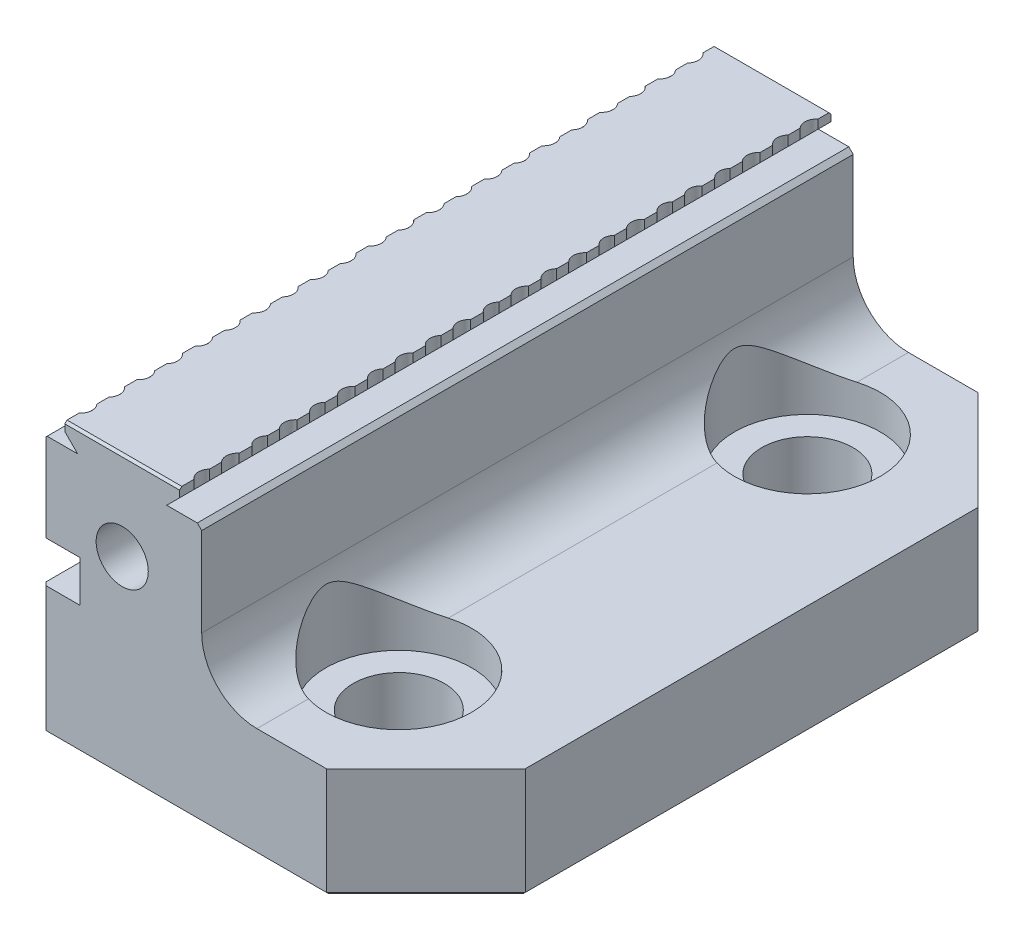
ISO-10303-21;
HEADER;
FILE_DESCRIPTION(('STEP AP214'),'2;1');
FILE_NAME('part.step','',(''),(''),'','','');
FILE_SCHEMA(('AUTOMOTIVE_DESIGN { 1 0 10303 214 1 1 1 1 }'));
ENDSEC;
DATA;
#1=APPLICATION_CONTEXT('core data for automotive mechanical design processes');
#2=APPLICATION_PROTOCOL_DEFINITION('international standard','automotive_design',2000,#1);
#3=PRODUCT_CONTEXT('',#1,'mechanical');
#4=PRODUCT('Part','Part','',(#3));
#5=PRODUCT_RELATED_PRODUCT_CATEGORY('part','',(#4));
#6=PRODUCT_DEFINITION_FORMATION('','',#4);
#7=PRODUCT_DEFINITION_CONTEXT('part definition',#1,'design');
#8=PRODUCT_DEFINITION('design','',#6,#7);
#9=PRODUCT_DEFINITION_SHAPE('','',#8);
#10=(LENGTH_UNIT() NAMED_UNIT(*) SI_UNIT(.MILLI.,.METRE.));
#11=(NAMED_UNIT(*) PLANE_ANGLE_UNIT() SI_UNIT($,.RADIAN.));
#12=(NAMED_UNIT(*) SI_UNIT($,.STERADIAN.) SOLID_ANGLE_UNIT());
#13=UNCERTAINTY_MEASURE_WITH_UNIT(LENGTH_MEASURE(1.E-05),#10,'distance_accuracy_value','');
#14=(GEOMETRIC_REPRESENTATION_CONTEXT(3) GLOBAL_UNCERTAINTY_ASSIGNED_CONTEXT((#13)) GLOBAL_UNIT_ASSIGNED_CONTEXT((#10,
#11,#12)) REPRESENTATION_CONTEXT('',''));
#15=CARTESIAN_POINT('',(0.,0.,0.));
#16=DIRECTION('',(0.,0.,1.));
#17=DIRECTION('',(1.,0.,0.));
#18=AXIS2_PLACEMENT_3D('',#15,#16,#17);
#19=CARTESIAN_POINT('',(-22.0345,-16.129,37.465));
#20=DIRECTION('',(1.,0.,0.));
#21=DIRECTION('',(0.,0.,-1.));
#22=AXIS2_PLACEMENT_3D('',#19,#20,#21);
#23=PLANE('',#22);
#24=DIRECTION('',(0.,-1.,0.));
#25=VECTOR('',#24,1.);
#26=CARTESIAN_POINT('',(-22.0345,-16.129,-37.084));
#27=LINE('',#26,#25);
#28=CARTESIAN_POINT('',(-22.0345,-1.32079999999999,-37.084));
#29=VERTEX_POINT('',#28);
#30=CARTESIAN_POINT('',(-22.0345,-15.748,-37.084));
#31=VERTEX_POINT('',#30);
#32=EDGE_CURVE('E1955',#29,#31,#27,.T.);
#33=ORIENTED_EDGE('',*,*,#32,.T.);
#34=DIRECTION('',(0.,0.,1.));
#35=VECTOR('',#34,1.);
#36=CARTESIAN_POINT('',(-22.0345,-15.748,37.465));
#37=LINE('',#36,#35);
#38=CARTESIAN_POINT('',(-22.0345,-15.748,37.084));
#39=VERTEX_POINT('',#38);
#40=EDGE_CURVE('E64',#31,#39,#37,.T.);
#41=ORIENTED_EDGE('',*,*,#40,.T.);
#42=DIRECTION('',(0.,1.,0.));
#43=VECTOR('',#42,1.);
#44=CARTESIAN_POINT('',(-22.0345,-1.32079999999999,37.084));
#45=LINE('',#44,#43);
#46=CARTESIAN_POINT('',(-22.0345,-1.32079999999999,37.084));
#47=VERTEX_POINT('',#46);
#48=EDGE_CURVE('E1960',#39,#47,#45,.T.);
#49=ORIENTED_EDGE('',*,*,#48,.T.);
#50=DIRECTION('',(0.,0.,-1.));
#51=VECTOR('',#50,1.);
#52=CARTESIAN_POINT('',(-22.0345,-1.32079999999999,37.465));
#53=LINE('',#52,#51);
#54=EDGE_CURVE('E847',#47,#29,#53,.T.);
#55=ORIENTED_EDGE('',*,*,#54,.T.);
#56=EDGE_LOOP('',(#33,#41,#49,#55));
#57=FACE_BOUND('',#56,.T.);
#58=ADVANCED_FACE('F42',(#57),#23,.F.);
#59=CARTESIAN_POINT('',(-6.28650000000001,15.113,37.465));
#60=DIRECTION('',(-1.,0.,0.));
#61=DIRECTION('',(0.,0.,1.));
#62=AXIS2_PLACEMENT_3D('',#59,#60,#61);
#63=PLANE('',#62);
#64=DIRECTION('',(0.,0.,-1.));
#65=VECTOR('',#64,1.);
#66=CARTESIAN_POINT('',(-6.28650000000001,16.129,37.465));
#67=LINE('',#66,#65);
#68=CARTESIAN_POINT('',(-6.28650000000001,16.129,37.211));
#69=VERTEX_POINT('',#68);
#70=CARTESIAN_POINT('',(-6.28650000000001,16.129,35.814));
#71=VERTEX_POINT('',#70);
#72=EDGE_CURVE('E1513',#69,#71,#67,.T.);
#73=ORIENTED_EDGE('',*,*,#72,.F.);
#74=DIRECTION('',(0.,-0.707106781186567,0.707106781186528));
#75=VECTOR('',#74,1.);
#76=CARTESIAN_POINT('',(-6.28650000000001,15.875,37.465));
#77=LINE('',#76,#75);
#78=CARTESIAN_POINT('',(-6.28650000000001,15.875,37.465));
#79=VERTEX_POINT('',#78);
#80=EDGE_CURVE('E1915',#69,#79,#77,.T.);
#81=ORIENTED_EDGE('',*,*,#80,.T.);
#82=DIRECTION('',(0.,1.,0.));
#83=VECTOR('',#82,1.);
#84=CARTESIAN_POINT('',(-6.28650000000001,15.113,37.465));
#85=LINE('',#84,#83);
#86=CARTESIAN_POINT('',(-6.28650000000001,15.113,37.465));
#87=VERTEX_POINT('',#86);
#88=EDGE_CURVE('E1469',#87,#79,#85,.T.);
#89=ORIENTED_EDGE('',*,*,#88,.F.);
#90=DIRECTION('',(0.,0.,-1.));
#91=VECTOR('',#90,1.);
#92=CARTESIAN_POINT('',(-6.28650000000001,15.113,37.465));
#93=LINE('',#92,#91);
#94=CARTESIAN_POINT('',(-6.28650000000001,15.113,35.814));
#95=VERTEX_POINT('',#94);
#96=EDGE_CURVE('E1517',#87,#95,#93,.T.);
#97=ORIENTED_EDGE('',*,*,#96,.T.);
#98=DIRECTION('',(0.,-1.,0.));
#99=VECTOR('',#98,1.);
#100=CARTESIAN_POINT('',(-6.28650000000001,-16.13,35.814));
#101=LINE('',#100,#99);
#102=EDGE_CURVE('E905',#71,#95,#101,.T.);
#103=ORIENTED_EDGE('',*,*,#102,.F.);
#104=EDGE_LOOP('',(#73,#81,#89,#97,#103));
#105=FACE_BOUND('',#104,.T.);
#106=ADVANCED_FACE('F1865',(#105),#63,.F.);
#107=CARTESIAN_POINT('',(-19.4945,15.113,37.465));
#108=DIRECTION('',(1.,0.,0.));
#109=DIRECTION('',(0.,0.,-1.));
#110=AXIS2_PLACEMENT_3D('',#107,#108,#109);
#111=PLANE('',#110);
#112=DIRECTION('',(0.,-1.,0.));
#113=VECTOR('',#112,1.);
#114=CARTESIAN_POINT('',(-19.4945,15.113,37.465));
#115=LINE('',#114,#113);
#116=CARTESIAN_POINT('',(-19.4945,15.875,37.465));
#117=VERTEX_POINT('',#116);
#118=CARTESIAN_POINT('',(-19.4945,15.113,37.465));
#119=VERTEX_POINT('',#118);
#120=EDGE_CURVE('E1472',#117,#119,#115,.T.);
#121=ORIENTED_EDGE('',*,*,#120,.F.);
#122=DIRECTION('',(0.,0.707106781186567,-0.707106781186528));
#123=VECTOR('',#122,1.);
#124=CARTESIAN_POINT('',(-19.4945,15.875,37.465));
#125=LINE('',#124,#123);
#126=CARTESIAN_POINT('',(-19.4945,16.129,37.211));
#127=VERTEX_POINT('',#126);
#128=EDGE_CURVE('E2074',#117,#127,#125,.T.);
#129=ORIENTED_EDGE('',*,*,#128,.T.);
#130=DIRECTION('',(0.,0.,-1.));
#131=VECTOR('',#130,1.);
#132=CARTESIAN_POINT('',(-19.4945,16.129,37.465));
#133=LINE('',#132,#131);
#134=CARTESIAN_POINT('',(-19.4945,16.129,35.814));
#135=VERTEX_POINT('',#134);
#136=EDGE_CURVE('E1509',#127,#135,#133,.T.);
#137=ORIENTED_EDGE('',*,*,#136,.T.);
#138=DIRECTION('',(0.,1.,0.));
#139=VECTOR('',#138,1.);
#140=CARTESIAN_POINT('',(-19.4945,-16.13,35.814));
#141=LINE('',#140,#139);
#142=CARTESIAN_POINT('',(-19.4945,15.113,35.814));
#143=VERTEX_POINT('',#142);
#144=EDGE_CURVE('E913',#143,#135,#141,.T.);
#145=ORIENTED_EDGE('',*,*,#144,.F.);
#146=DIRECTION('',(0.,0.,-1.));
#147=VECTOR('',#146,1.);
#148=CARTESIAN_POINT('',(-19.4945,15.113,37.465));
#149=LINE('',#148,#147);
#150=EDGE_CURVE('E1504',#119,#143,#149,.T.);
#151=ORIENTED_EDGE('',*,*,#150,.F.);
#152=EDGE_LOOP('',(#121,#129,#137,#145,#151));
#153=FACE_BOUND('',#152,.T.);
#154=ADVANCED_FACE('F1855',(#153),#111,.F.);
#155=CARTESIAN_POINT('',(-6.28650000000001,16.129,30.607));
#156=VERTEX_POINT('',#155);
#157=CARTESIAN_POINT('',(-6.28650000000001,16.129,29.1592));
#158=VERTEX_POINT('',#157);
#159=EDGE_CURVE('E1516',#156,#158,#67,.T.);
#160=ORIENTED_EDGE('',*,*,#159,.F.);
#161=DIRECTION('',(0.,1.,0.));
#162=VECTOR('',#161,1.);
#163=CARTESIAN_POINT('',(-6.28650000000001,-16.13,30.607));
#164=LINE('',#163,#162);
#165=CARTESIAN_POINT('',(-6.28650000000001,15.113,30.607));
#166=VERTEX_POINT('',#165);
#167=EDGE_CURVE('E890',#166,#156,#164,.T.);
#168=ORIENTED_EDGE('',*,*,#167,.F.);
#169=CARTESIAN_POINT('',(-6.28650000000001,15.113,29.1592));
#170=VERTEX_POINT('',#169);
#171=EDGE_CURVE('E1521',#166,#170,#93,.T.);
#172=ORIENTED_EDGE('',*,*,#171,.T.);
#173=DIRECTION('',(0.,-1.,0.));
#174=VECTOR('',#173,1.);
#175=CARTESIAN_POINT('',(-6.28650000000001,-16.13,29.1592));
#176=LINE('',#175,#174);
#177=EDGE_CURVE('E953',#158,#170,#176,.T.);
#178=ORIENTED_EDGE('',*,*,#177,.F.);
#179=EDGE_LOOP('',(#160,#168,#172,#178));
#180=FACE_BOUND('',#179,.T.);
#181=ADVANCED_FACE('F1888',(#180),#63,.F.);
#182=CARTESIAN_POINT('',(-19.4945,15.113,30.607));
#183=VERTEX_POINT('',#182);
#184=CARTESIAN_POINT('',(-19.4945,15.113,29.1592));
#185=VERTEX_POINT('',#184);
#186=EDGE_CURVE('E1508',#183,#185,#149,.T.);
#187=ORIENTED_EDGE('',*,*,#186,.F.);
#188=DIRECTION('',(0.,1.,0.));
#189=VECTOR('',#188,1.);
#190=CARTESIAN_POINT('',(-19.4945,-16.13,30.607));
#191=LINE('',#190,#189);
#192=CARTESIAN_POINT('',(-19.4945,16.129,30.607));
#193=VERTEX_POINT('',#192);
#194=EDGE_CURVE('E918',#193,#183,#191,.F.);
#195=ORIENTED_EDGE('',*,*,#194,.F.);
#196=CARTESIAN_POINT('',(-19.4945,16.129,29.1592));
#197=VERTEX_POINT('',#196);
#198=EDGE_CURVE('E1512',#193,#197,#133,.T.);
#199=ORIENTED_EDGE('',*,*,#198,.T.);
#200=DIRECTION('',(0.,1.,0.));
#201=VECTOR('',#200,1.);
#202=CARTESIAN_POINT('',(-19.4945,-16.13,29.1592));
#203=LINE('',#202,#201);
#204=EDGE_CURVE('E962',#185,#197,#203,.T.);
#205=ORIENTED_EDGE('',*,*,#204,.F.);
#206=EDGE_LOOP('',(#187,#195,#199,#205));
#207=FACE_BOUND('',#206,.T.);
#208=ADVANCED_FACE('F2642',(#207),#111,.F.);
#209=CARTESIAN_POINT('',(-6.28650000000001,16.129,23.9522));
#210=VERTEX_POINT('',#209);
#211=CARTESIAN_POINT('',(-6.28650000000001,16.129,22.5044));
#212=VERTEX_POINT('',#211);
#213=EDGE_CURVE('E3434',#210,#212,#67,.T.);
#214=ORIENTED_EDGE('',*,*,#213,.F.);
#215=DIRECTION('',(0.,1.,0.));
#216=VECTOR('',#215,1.);
#217=CARTESIAN_POINT('',(-6.28650000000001,-16.13,23.9522));
#218=LINE('',#217,#216);
#219=CARTESIAN_POINT('',(-6.28650000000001,15.113,23.9522));
#220=VERTEX_POINT('',#219);
#221=EDGE_CURVE('E938',#220,#210,#218,.T.);
#222=ORIENTED_EDGE('',*,*,#221,.F.);
#223=CARTESIAN_POINT('',(-6.28650000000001,15.113,22.5044));
#224=VERTEX_POINT('',#223);
#225=EDGE_CURVE('E3414',#220,#224,#93,.T.);
#226=ORIENTED_EDGE('',*,*,#225,.T.);
#227=DIRECTION('',(0.,-1.,0.));
#228=VECTOR('',#227,1.);
#229=CARTESIAN_POINT('',(-6.28650000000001,-16.13,22.5044));
#230=LINE('',#229,#228);
#231=EDGE_CURVE('E1003',#212,#224,#230,.T.);
#232=ORIENTED_EDGE('',*,*,#231,.F.);
#233=EDGE_LOOP('',(#214,#222,#226,#232));
#234=FACE_BOUND('',#233,.T.);
#235=ADVANCED_FACE('F2651',(#234),#63,.F.);
#236=CARTESIAN_POINT('',(-19.4945,15.113,23.9522));
#237=VERTEX_POINT('',#236);
#238=CARTESIAN_POINT('',(-19.4945,15.113,22.5044));
#239=VERTEX_POINT('',#238);
#240=EDGE_CURVE('E3278',#237,#239,#149,.T.);
#241=ORIENTED_EDGE('',*,*,#240,.F.);
#242=DIRECTION('',(0.,1.,0.));
#243=VECTOR('',#242,1.);
#244=CARTESIAN_POINT('',(-19.4945,-16.13,23.9522));
#245=LINE('',#244,#243);
#246=CARTESIAN_POINT('',(-19.4945,16.129,23.9522));
#247=VERTEX_POINT('',#246);
#248=EDGE_CURVE('E967',#247,#237,#245,.F.);
#249=ORIENTED_EDGE('',*,*,#248,.F.);
#250=CARTESIAN_POINT('',(-19.4945,16.129,22.5044));
#251=VERTEX_POINT('',#250);
#252=EDGE_CURVE('E3294',#247,#251,#133,.T.);
#253=ORIENTED_EDGE('',*,*,#252,.T.);
#254=DIRECTION('',(0.,1.,0.));
#255=VECTOR('',#254,1.);
#256=CARTESIAN_POINT('',(-19.4945,-16.13,22.5044));
#257=LINE('',#256,#255);
#258=EDGE_CURVE('E1012',#239,#251,#257,.T.);
#259=ORIENTED_EDGE('',*,*,#258,.F.);
#260=EDGE_LOOP('',(#241,#249,#253,#259));
#261=FACE_BOUND('',#260,.T.);
#262=ADVANCED_FACE('F2657',(#261),#111,.F.);
#263=CARTESIAN_POINT('',(-6.28650000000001,16.129,17.2974));
#264=VERTEX_POINT('',#263);
#265=CARTESIAN_POINT('',(-6.28650000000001,16.129,15.8496));
#266=VERTEX_POINT('',#265);
#267=EDGE_CURVE('E3435',#264,#266,#67,.T.);
#268=ORIENTED_EDGE('',*,*,#267,.F.);
#269=DIRECTION('',(0.,1.,0.));
#270=VECTOR('',#269,1.);
#271=CARTESIAN_POINT('',(-6.28650000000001,-16.13,17.2974));
#272=LINE('',#271,#270);
#273=CARTESIAN_POINT('',(-6.2865,15.113,17.2974));
#274=VERTEX_POINT('',#273);
#275=EDGE_CURVE('E988',#274,#264,#272,.T.);
#276=ORIENTED_EDGE('',*,*,#275,.F.);
#277=CARTESIAN_POINT('',(-6.28650000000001,15.113,15.8496));
#278=VERTEX_POINT('',#277);
#279=EDGE_CURVE('E3410',#274,#278,#93,.T.);
#280=ORIENTED_EDGE('',*,*,#279,.T.);
#281=DIRECTION('',(0.,-1.,0.));
#282=VECTOR('',#281,1.);
#283=CARTESIAN_POINT('',(-6.28650000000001,-16.13,15.8496));
#284=LINE('',#283,#282);
#285=EDGE_CURVE('E1053',#266,#278,#284,.T.);
#286=ORIENTED_EDGE('',*,*,#285,.F.);
#287=EDGE_LOOP('',(#268,#276,#280,#286));
#288=FACE_BOUND('',#287,.T.);
#289=ADVANCED_FACE('F2664',(#288),#63,.F.);
#290=CARTESIAN_POINT('',(-19.4945,15.113,17.2974));
#291=VERTEX_POINT('',#290);
#292=CARTESIAN_POINT('',(-19.4945,15.113,15.8496));
#293=VERTEX_POINT('',#292);
#294=EDGE_CURVE('E3274',#291,#293,#149,.T.);
#295=ORIENTED_EDGE('',*,*,#294,.F.);
#296=DIRECTION('',(0.,1.,0.));
#297=VECTOR('',#296,1.);
#298=CARTESIAN_POINT('',(-19.4945,-16.13,17.2974));
#299=LINE('',#298,#297);
#300=CARTESIAN_POINT('',(-19.4945,16.129,17.2974));
#301=VERTEX_POINT('',#300);
#302=EDGE_CURVE('E1017',#301,#291,#299,.F.);
#303=ORIENTED_EDGE('',*,*,#302,.F.);
#304=CARTESIAN_POINT('',(-19.4945,16.129,15.8496));
#305=VERTEX_POINT('',#304);
#306=EDGE_CURVE('E3295',#301,#305,#133,.T.);
#307=ORIENTED_EDGE('',*,*,#306,.T.);
#308=DIRECTION('',(0.,1.,0.));
#309=VECTOR('',#308,1.);
#310=CARTESIAN_POINT('',(-19.4945,-16.13,15.8496));
#311=LINE('',#310,#309);
#312=EDGE_CURVE('E1062',#293,#305,#311,.T.);
#313=ORIENTED_EDGE('',*,*,#312,.F.);
#314=EDGE_LOOP('',(#295,#303,#307,#313));
#315=FACE_BOUND('',#314,.T.);
#316=ADVANCED_FACE('F2671',(#315),#111,.F.);
#317=CARTESIAN_POINT('',(-6.2865,16.129,10.6426));
#318=VERTEX_POINT('',#317);
#319=CARTESIAN_POINT('',(-6.28650000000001,16.129,9.1948));
#320=VERTEX_POINT('',#319);
#321=EDGE_CURVE('E3438',#318,#320,#67,.T.);
#322=ORIENTED_EDGE('',*,*,#321,.F.);
#323=DIRECTION('',(0.,1.,0.));
#324=VECTOR('',#323,1.);
#325=CARTESIAN_POINT('',(-6.28650000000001,-16.13,10.6426));
#326=LINE('',#325,#324);
#327=CARTESIAN_POINT('',(-6.2865,15.113,10.6426));
#328=VERTEX_POINT('',#327);
#329=EDGE_CURVE('E1038',#328,#318,#326,.T.);
#330=ORIENTED_EDGE('',*,*,#329,.F.);
#331=CARTESIAN_POINT('',(-6.28650000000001,15.113,9.1948));
#332=VERTEX_POINT('',#331);
#333=EDGE_CURVE('E3406',#328,#332,#93,.T.);
#334=ORIENTED_EDGE('',*,*,#333,.T.);
#335=DIRECTION('',(0.,-1.,0.));
#336=VECTOR('',#335,1.);
#337=CARTESIAN_POINT('',(-6.28650000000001,-16.13,9.1948));
#338=LINE('',#337,#336);
#339=EDGE_CURVE('E1103',#320,#332,#338,.T.);
#340=ORIENTED_EDGE('',*,*,#339,.F.);
#341=EDGE_LOOP('',(#322,#330,#334,#340));
#342=FACE_BOUND('',#341,.T.);
#343=ADVANCED_FACE('F2678',(#342),#63,.F.);
#344=CARTESIAN_POINT('',(-19.4945,15.113,10.6426));
#345=VERTEX_POINT('',#344);
#346=CARTESIAN_POINT('',(-19.4945,15.113,9.1948));
#347=VERTEX_POINT('',#346);
#348=EDGE_CURVE('E3269',#345,#347,#149,.T.);
#349=ORIENTED_EDGE('',*,*,#348,.F.);
#350=DIRECTION('',(0.,1.,0.));
#351=VECTOR('',#350,1.);
#352=CARTESIAN_POINT('',(-19.4945,-16.13,10.6426));
#353=LINE('',#352,#351);
#354=CARTESIAN_POINT('',(-19.4945,16.129,10.6426));
#355=VERTEX_POINT('',#354);
#356=EDGE_CURVE('E1067',#355,#345,#353,.F.);
#357=ORIENTED_EDGE('',*,*,#356,.F.);
#358=CARTESIAN_POINT('',(-19.4945,16.129,9.19480000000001));
#359=VERTEX_POINT('',#358);
#360=EDGE_CURVE('E3299',#355,#359,#133,.T.);
#361=ORIENTED_EDGE('',*,*,#360,.T.);
#362=DIRECTION('',(0.,1.,0.));
#363=VECTOR('',#362,1.);
#364=CARTESIAN_POINT('',(-19.4945,-16.13,9.1948));
#365=LINE('',#364,#363);
#366=EDGE_CURVE('E1112',#347,#359,#365,.T.);
#367=ORIENTED_EDGE('',*,*,#366,.F.);
#368=EDGE_LOOP('',(#349,#357,#361,#367));
#369=FACE_BOUND('',#368,.T.);
#370=ADVANCED_FACE('F2685',(#369),#111,.F.);
#371=CARTESIAN_POINT('',(-6.2865,16.129,3.98780000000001));
#372=VERTEX_POINT('',#371);
#373=CARTESIAN_POINT('',(-6.28650000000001,16.129,2.54));
#374=VERTEX_POINT('',#373);
#375=EDGE_CURVE('E3442',#372,#374,#67,.T.);
#376=ORIENTED_EDGE('',*,*,#375,.F.);
#377=DIRECTION('',(0.,1.,0.));
#378=VECTOR('',#377,1.);
#379=CARTESIAN_POINT('',(-6.28650000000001,-16.13,3.98780000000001));
#380=LINE('',#379,#378);
#381=CARTESIAN_POINT('',(-6.2865,15.113,3.98780000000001));
#382=VERTEX_POINT('',#381);
#383=EDGE_CURVE('E1088',#382,#372,#380,.T.);
#384=ORIENTED_EDGE('',*,*,#383,.F.);
#385=CARTESIAN_POINT('',(-6.2865,15.113,2.54));
#386=VERTEX_POINT('',#385);
#387=EDGE_CURVE('E3402',#382,#386,#93,.T.);
#388=ORIENTED_EDGE('',*,*,#387,.T.);
#389=DIRECTION('',(0.,-1.,0.));
#390=VECTOR('',#389,1.);
#391=CARTESIAN_POINT('',(-6.28650000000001,-16.13,2.54));
#392=LINE('',#391,#390);
#393=EDGE_CURVE('E1155',#374,#386,#392,.T.);
#394=ORIENTED_EDGE('',*,*,#393,.F.);
#395=EDGE_LOOP('',(#376,#384,#388,#394));
#396=FACE_BOUND('',#395,.T.);
#397=ADVANCED_FACE('F2692',(#396),#63,.F.);
#398=CARTESIAN_POINT('',(-19.4945,15.113,3.98780000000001));
#399=VERTEX_POINT('',#398);
#400=CARTESIAN_POINT('',(-19.4945,15.113,2.54));
#401=VERTEX_POINT('',#400);
#402=EDGE_CURVE('E3264',#399,#401,#149,.T.);
#403=ORIENTED_EDGE('',*,*,#402,.F.);
#404=DIRECTION('',(0.,1.,0.));
#405=VECTOR('',#404,1.);
#406=CARTESIAN_POINT('',(-19.4945,-16.13,3.9878));
#407=LINE('',#406,#405);
#408=CARTESIAN_POINT('',(-19.4945,16.129,3.98780000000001));
#409=VERTEX_POINT('',#408);
#410=EDGE_CURVE('E1117',#409,#399,#407,.F.);
#411=ORIENTED_EDGE('',*,*,#410,.F.);
#412=CARTESIAN_POINT('',(-19.4945,16.129,2.54));
#413=VERTEX_POINT('',#412);
#414=EDGE_CURVE('E3303',#409,#413,#133,.T.);
#415=ORIENTED_EDGE('',*,*,#414,.T.);
#416=DIRECTION('',(0.,1.,0.));
#417=VECTOR('',#416,1.);
#418=CARTESIAN_POINT('',(-19.4945,-16.13,2.54));
#419=LINE('',#418,#417);
#420=EDGE_CURVE('E1164',#401,#413,#419,.T.);
#421=ORIENTED_EDGE('',*,*,#420,.F.);
#422=EDGE_LOOP('',(#403,#411,#415,#421));
#423=FACE_BOUND('',#422,.T.);
#424=ADVANCED_FACE('F2699',(#423),#111,.F.);
#425=CARTESIAN_POINT('',(-6.2865,16.129,-2.667));
#426=VERTEX_POINT('',#425);
#427=CARTESIAN_POINT('',(-6.28650000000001,16.129,-4.1148));
#428=VERTEX_POINT('',#427);
#429=EDGE_CURVE('E3446',#426,#428,#67,.T.);
#430=ORIENTED_EDGE('',*,*,#429,.F.);
#431=DIRECTION('',(0.,1.,0.));
#432=VECTOR('',#431,1.);
#433=CARTESIAN_POINT('',(-6.28650000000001,-16.13,-2.66699999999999));
#434=LINE('',#433,#432);
#435=CARTESIAN_POINT('',(-6.2865,15.113,-2.667));
#436=VERTEX_POINT('',#435);
#437=EDGE_CURVE('E1140',#436,#426,#434,.T.);
#438=ORIENTED_EDGE('',*,*,#437,.F.);
#439=CARTESIAN_POINT('',(-6.2865,15.113,-4.1148));
#440=VERTEX_POINT('',#439);
#441=EDGE_CURVE('E3398',#436,#440,#93,.T.);
#442=ORIENTED_EDGE('',*,*,#441,.T.);
#443=DIRECTION('',(0.,-1.,0.));
#444=VECTOR('',#443,1.);
#445=CARTESIAN_POINT('',(-6.28650000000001,-16.13,-4.1148));
#446=LINE('',#445,#444);
#447=EDGE_CURVE('E1215',#428,#440,#446,.T.);
#448=ORIENTED_EDGE('',*,*,#447,.F.);
#449=EDGE_LOOP('',(#430,#438,#442,#448));
#450=FACE_BOUND('',#449,.T.);
#451=ADVANCED_FACE('F2706',(#450),#63,.F.);
#452=CARTESIAN_POINT('',(-19.4945,15.113,-2.667));
#453=VERTEX_POINT('',#452);
#454=CARTESIAN_POINT('',(-19.4945,15.113,-4.1148));
#455=VERTEX_POINT('',#454);
#456=EDGE_CURVE('E3259',#453,#455,#149,.T.);
#457=ORIENTED_EDGE('',*,*,#456,.F.);
#458=DIRECTION('',(0.,1.,0.));
#459=VECTOR('',#458,1.);
#460=CARTESIAN_POINT('',(-19.4945,-16.13,-2.667));
#461=LINE('',#460,#459);
#462=CARTESIAN_POINT('',(-19.4945,16.129,-2.667));
#463=VERTEX_POINT('',#462);
#464=EDGE_CURVE('E1170',#463,#453,#461,.F.);
#465=ORIENTED_EDGE('',*,*,#464,.F.);
#466=CARTESIAN_POINT('',(-19.4945,16.129,-4.11479999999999));
#467=VERTEX_POINT('',#466);
#468=EDGE_CURVE('E3307',#463,#467,#133,.T.);
#469=ORIENTED_EDGE('',*,*,#468,.T.);
#470=DIRECTION('',(0.,1.,0.));
#471=VECTOR('',#470,1.);
#472=CARTESIAN_POINT('',(-19.4945,-16.13,-4.1148));
#473=LINE('',#472,#471);
#474=EDGE_CURVE('E1224',#455,#467,#473,.T.);
#475=ORIENTED_EDGE('',*,*,#474,.F.);
#476=EDGE_LOOP('',(#457,#465,#469,#475));
#477=FACE_BOUND('',#476,.T.);
#478=ADVANCED_FACE('F2713',(#477),#111,.F.);
#479=CARTESIAN_POINT('',(-6.2865,16.129,-9.32179999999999));
#480=VERTEX_POINT('',#479);
#481=CARTESIAN_POINT('',(-6.28650000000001,16.129,-10.7696));
#482=VERTEX_POINT('',#481);
#483=EDGE_CURVE('E3450',#480,#482,#67,.T.);
#484=ORIENTED_EDGE('',*,*,#483,.F.);
#485=DIRECTION('',(0.,1.,0.));
#486=VECTOR('',#485,1.);
#487=CARTESIAN_POINT('',(-6.28650000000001,-16.13,-9.32179999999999));
#488=LINE('',#487,#486);
#489=CARTESIAN_POINT('',(-6.2865,15.113,-9.32179999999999));
#490=VERTEX_POINT('',#489);
#491=EDGE_CURVE('E1200',#490,#480,#488,.T.);
#492=ORIENTED_EDGE('',*,*,#491,.F.);
#493=CARTESIAN_POINT('',(-6.2865,15.113,-10.7696));
#494=VERTEX_POINT('',#493);
#495=EDGE_CURVE('E3394',#490,#494,#93,.T.);
#496=ORIENTED_EDGE('',*,*,#495,.T.);
#497=DIRECTION('',(0.,-1.,0.));
#498=VECTOR('',#497,1.);
#499=CARTESIAN_POINT('',(-6.28650000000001,-16.13,-10.7696));
#500=LINE('',#499,#498);
#501=EDGE_CURVE('E1271',#482,#494,#500,.T.);
#502=ORIENTED_EDGE('',*,*,#501,.F.);
#503=EDGE_LOOP('',(#484,#492,#496,#502));
#504=FACE_BOUND('',#503,.T.);
#505=ADVANCED_FACE('F2720',(#504),#63,.F.);
#506=CARTESIAN_POINT('',(-19.4945,15.113,-9.3218));
#507=VERTEX_POINT('',#506);
#508=CARTESIAN_POINT('',(-19.4945,15.113,-10.7696));
#509=VERTEX_POINT('',#508);
#510=EDGE_CURVE('E3255',#507,#509,#149,.T.);
#511=ORIENTED_EDGE('',*,*,#510,.F.);
#512=DIRECTION('',(0.,1.,0.));
#513=VECTOR('',#512,1.);
#514=CARTESIAN_POINT('',(-19.4945,-16.13,-9.3218));
#515=LINE('',#514,#513);
#516=CARTESIAN_POINT('',(-19.4945,16.129,-9.3218));
#517=VERTEX_POINT('',#516);
#518=EDGE_CURVE('E1230',#517,#507,#515,.F.);
#519=ORIENTED_EDGE('',*,*,#518,.F.);
#520=CARTESIAN_POINT('',(-19.4945,16.129,-10.7696));
#521=VERTEX_POINT('',#520);
#522=EDGE_CURVE('E3312',#517,#521,#133,.T.);
#523=ORIENTED_EDGE('',*,*,#522,.T.);
#524=DIRECTION('',(0.,1.,0.));
#525=VECTOR('',#524,1.);
#526=CARTESIAN_POINT('',(-19.4945,-16.13,-10.7696));
#527=LINE('',#526,#525);
#528=EDGE_CURVE('E1280',#509,#521,#527,.T.);
#529=ORIENTED_EDGE('',*,*,#528,.F.);
#530=EDGE_LOOP('',(#511,#519,#523,#529));
#531=FACE_BOUND('',#530,.T.);
#532=ADVANCED_FACE('F2727',(#531),#111,.F.);
#533=CARTESIAN_POINT('',(-6.2865,16.129,-15.9766));
#534=VERTEX_POINT('',#533);
#535=CARTESIAN_POINT('',(-6.28650000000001,16.129,-17.4244));
#536=VERTEX_POINT('',#535);
#537=EDGE_CURVE('E3228',#534,#536,#67,.T.);
#538=ORIENTED_EDGE('',*,*,#537,.F.);
#539=DIRECTION('',(0.,1.,0.));
#540=VECTOR('',#539,1.);
#541=CARTESIAN_POINT('',(-6.28650000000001,-16.13,-15.9766));
#542=LINE('',#541,#540);
#543=CARTESIAN_POINT('',(-6.2865,15.113,-15.9766));
#544=VERTEX_POINT('',#543);
#545=EDGE_CURVE('E1256',#544,#534,#542,.T.);
#546=ORIENTED_EDGE('',*,*,#545,.F.);
#547=CARTESIAN_POINT('',(-6.2865,15.113,-17.4244));
#548=VERTEX_POINT('',#547);
#549=EDGE_CURVE('E3390',#544,#548,#93,.T.);
#550=ORIENTED_EDGE('',*,*,#549,.T.);
#551=DIRECTION('',(0.,-1.,0.));
#552=VECTOR('',#551,1.);
#553=CARTESIAN_POINT('',(-6.28650000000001,-16.13,-17.4244));
#554=LINE('',#553,#552);
#555=EDGE_CURVE('E1321',#536,#548,#554,.T.);
#556=ORIENTED_EDGE('',*,*,#555,.F.);
#557=EDGE_LOOP('',(#538,#546,#550,#556));
#558=FACE_BOUND('',#557,.T.);
#559=ADVANCED_FACE('F2734',(#558),#63,.F.);
#560=CARTESIAN_POINT('',(-19.4945,15.113,-15.9766));
#561=VERTEX_POINT('',#560);
#562=CARTESIAN_POINT('',(-19.4945,15.113,-17.4244));
#563=VERTEX_POINT('',#562);
#564=EDGE_CURVE('E3251',#561,#563,#149,.T.);
#565=ORIENTED_EDGE('',*,*,#564,.F.);
#566=DIRECTION('',(0.,1.,0.));
#567=VECTOR('',#566,1.);
#568=CARTESIAN_POINT('',(-19.4945,-16.13,-15.9766));
#569=LINE('',#568,#567);
#570=CARTESIAN_POINT('',(-19.4945,16.129,-15.9766));
#571=VERTEX_POINT('',#570);
#572=EDGE_CURVE('E1285',#571,#561,#569,.F.);
#573=ORIENTED_EDGE('',*,*,#572,.F.);
#574=CARTESIAN_POINT('',(-19.4945,16.129,-17.4244));
#575=VERTEX_POINT('',#574);
#576=EDGE_CURVE('E3316',#571,#575,#133,.T.);
#577=ORIENTED_EDGE('',*,*,#576,.T.);
#578=DIRECTION('',(0.,1.,0.));
#579=VECTOR('',#578,1.);
#580=CARTESIAN_POINT('',(-19.4945,-16.13,-17.4244));
#581=LINE('',#580,#579);
#582=EDGE_CURVE('E1330',#563,#575,#581,.T.);
#583=ORIENTED_EDGE('',*,*,#582,.F.);
#584=EDGE_LOOP('',(#565,#573,#577,#583));
#585=FACE_BOUND('',#584,.T.);
#586=ADVANCED_FACE('F2741',(#585),#111,.F.);
#587=CARTESIAN_POINT('',(-6.2865,16.129,-22.6314));
#588=VERTEX_POINT('',#587);
#589=CARTESIAN_POINT('',(-6.28650000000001,16.129,-24.0792));
#590=VERTEX_POINT('',#589);
#591=EDGE_CURVE('E3227',#588,#590,#67,.T.);
#592=ORIENTED_EDGE('',*,*,#591,.F.);
#593=DIRECTION('',(0.,1.,0.));
#594=VECTOR('',#593,1.);
#595=CARTESIAN_POINT('',(-6.28650000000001,-16.13,-22.6314));
#596=LINE('',#595,#594);
#597=CARTESIAN_POINT('',(-6.2865,15.113,-22.6314));
#598=VERTEX_POINT('',#597);
#599=EDGE_CURVE('E1306',#598,#588,#596,.T.);
#600=ORIENTED_EDGE('',*,*,#599,.F.);
#601=CARTESIAN_POINT('',(-6.2865,15.113,-24.0792));
#602=VERTEX_POINT('',#601);
#603=EDGE_CURVE('E3389',#598,#602,#93,.T.);
#604=ORIENTED_EDGE('',*,*,#603,.T.);
#605=DIRECTION('',(0.,-1.,0.));
#606=VECTOR('',#605,1.);
#607=CARTESIAN_POINT('',(-6.28650000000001,-16.13,-24.0792));
#608=LINE('',#607,#606);
#609=EDGE_CURVE('E1371',#590,#602,#608,.T.);
#610=ORIENTED_EDGE('',*,*,#609,.F.);
#611=EDGE_LOOP('',(#592,#600,#604,#610));
#612=FACE_BOUND('',#611,.T.);
#613=ADVANCED_FACE('F2748',(#612),#63,.F.);
#614=CARTESIAN_POINT('',(-19.4945,15.113,-22.6314));
#615=VERTEX_POINT('',#614);
#616=CARTESIAN_POINT('',(-19.4945,15.113,-24.0792));
#617=VERTEX_POINT('',#616);
#618=EDGE_CURVE('E3247',#615,#617,#149,.T.);
#619=ORIENTED_EDGE('',*,*,#618,.F.);
#620=DIRECTION('',(0.,1.,0.));
#621=VECTOR('',#620,1.);
#622=CARTESIAN_POINT('',(-19.4945,-16.13,-22.6314));
#623=LINE('',#622,#621);
#624=CARTESIAN_POINT('',(-19.4945,16.129,-22.6314));
#625=VERTEX_POINT('',#624);
#626=EDGE_CURVE('E1335',#625,#615,#623,.F.);
#627=ORIENTED_EDGE('',*,*,#626,.F.);
#628=CARTESIAN_POINT('',(-19.4945,16.129,-24.0792));
#629=VERTEX_POINT('',#628);
#630=EDGE_CURVE('E3320',#625,#629,#133,.T.);
#631=ORIENTED_EDGE('',*,*,#630,.T.);
#632=DIRECTION('',(0.,1.,0.));
#633=VECTOR('',#632,1.);
#634=CARTESIAN_POINT('',(-19.4945,-16.13,-24.0792));
#635=LINE('',#634,#633);
#636=EDGE_CURVE('E1380',#617,#629,#635,.T.);
#637=ORIENTED_EDGE('',*,*,#636,.F.);
#638=EDGE_LOOP('',(#619,#627,#631,#637));
#639=FACE_BOUND('',#638,.T.);
#640=ADVANCED_FACE('F1901',(#639),#111,.F.);
#641=CARTESIAN_POINT('',(-6.2865,16.129,-29.2862));
#642=VERTEX_POINT('',#641);
#643=CARTESIAN_POINT('',(-6.28650000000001,16.129,-30.734));
#644=VERTEX_POINT('',#643);
#645=EDGE_CURVE('E3223',#642,#644,#67,.T.);
#646=ORIENTED_EDGE('',*,*,#645,.F.);
#647=DIRECTION('',(0.,1.,0.));
#648=VECTOR('',#647,1.);
#649=CARTESIAN_POINT('',(-6.28650000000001,-16.13,-29.2862));
#650=LINE('',#649,#648);
#651=CARTESIAN_POINT('',(-6.2865,15.113,-29.2862));
#652=VERTEX_POINT('',#651);
#653=EDGE_CURVE('E1356',#652,#642,#650,.T.);
#654=ORIENTED_EDGE('',*,*,#653,.F.);
#655=CARTESIAN_POINT('',(-6.2865,15.113,-30.734));
#656=VERTEX_POINT('',#655);
#657=EDGE_CURVE('E3388',#652,#656,#93,.T.);
#658=ORIENTED_EDGE('',*,*,#657,.T.);
#659=DIRECTION('',(0.,-1.,0.));
#660=VECTOR('',#659,1.);
#661=CARTESIAN_POINT('',(-6.28650000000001,-16.13,-30.734));
#662=LINE('',#661,#660);
#663=EDGE_CURVE('E1421',#644,#656,#662,.T.);
#664=ORIENTED_EDGE('',*,*,#663,.F.);
#665=EDGE_LOOP('',(#646,#654,#658,#664));
#666=FACE_BOUND('',#665,.T.);
#667=ADVANCED_FACE('F1866',(#666),#63,.F.);
#668=CARTESIAN_POINT('',(-19.4945,15.113,-29.2862));
#669=VERTEX_POINT('',#668);
#670=CARTESIAN_POINT('',(-19.4945,15.113,-30.734));
#671=VERTEX_POINT('',#670);
#672=EDGE_CURVE('E3246',#669,#671,#149,.T.);
#673=ORIENTED_EDGE('',*,*,#672,.F.);
#674=DIRECTION('',(0.,1.,0.));
#675=VECTOR('',#674,1.);
#676=CARTESIAN_POINT('',(-19.4945,-16.13,-29.2862));
#677=LINE('',#676,#675);
#678=CARTESIAN_POINT('',(-19.4945,16.129,-29.2862));
#679=VERTEX_POINT('',#678);
#680=EDGE_CURVE('E1385',#679,#669,#677,.F.);
#681=ORIENTED_EDGE('',*,*,#680,.F.);
#682=CARTESIAN_POINT('',(-19.4945,16.129,-30.734));
#683=VERTEX_POINT('',#682);
#684=EDGE_CURVE('E3324',#679,#683,#133,.T.);
#685=ORIENTED_EDGE('',*,*,#684,.T.);
#686=DIRECTION('',(0.,1.,0.));
#687=VECTOR('',#686,1.);
#688=CARTESIAN_POINT('',(-19.4945,-16.13,-30.734));
#689=LINE('',#688,#687);
#690=EDGE_CURVE('E1430',#671,#683,#689,.T.);
#691=ORIENTED_EDGE('',*,*,#690,.F.);
#692=EDGE_LOOP('',(#673,#681,#685,#691));
#693=FACE_BOUND('',#692,.T.);
#694=ADVANCED_FACE('F1856',(#693),#111,.F.);
#695=DIRECTION('',(0.,0.,-1.));
#696=VECTOR('',#695,1.);
#697=CARTESIAN_POINT('',(-22.0345,13.121,37.465));
#698=LINE('',#697,#696);
#699=CARTESIAN_POINT('',(-22.0345,13.121,37.084));
#700=VERTEX_POINT('',#699);
#701=CARTESIAN_POINT('',(-22.0345,13.121,-37.084));
#702=VERTEX_POINT('',#701);
#703=EDGE_CURVE('E1905',#700,#702,#698,.T.);
#704=ORIENTED_EDGE('',*,*,#703,.T.);
#705=DIRECTION('',(0.,-1.,0.));
#706=VECTOR('',#705,1.);
#707=CARTESIAN_POINT('',(-22.0345,-16.129,-37.084));
#708=LINE('',#707,#706);
#709=CARTESIAN_POINT('',(-22.0345,3.42900000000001,-37.084));
#710=VERTEX_POINT('',#709);
#711=EDGE_CURVE('E1908',#702,#710,#708,.T.);
#712=ORIENTED_EDGE('',*,*,#711,.T.);
#713=DIRECTION('',(0.,0.,-1.));
#714=VECTOR('',#713,1.);
#715=CARTESIAN_POINT('',(-22.0345,3.42900000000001,37.465));
#716=LINE('',#715,#714);
#717=CARTESIAN_POINT('',(-22.0345,3.42900000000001,37.084));
#718=VERTEX_POINT('',#717);
#719=EDGE_CURVE('E840',#718,#710,#716,.T.);
#720=ORIENTED_EDGE('',*,*,#719,.F.);
#721=DIRECTION('',(0.,1.,0.));
#722=VECTOR('',#721,1.);
#723=CARTESIAN_POINT('',(-22.0345,13.121,37.084));
#724=LINE('',#723,#722);
#725=EDGE_CURVE('E1910',#718,#700,#724,.T.);
#726=ORIENTED_EDGE('',*,*,#725,.T.);
#727=EDGE_LOOP('',(#704,#712,#720,#726));
#728=FACE_BOUND('',#727,.T.);
#729=ADVANCED_FACE('F1883',(#728),#23,.F.);
#730=CARTESIAN_POINT('',(-22.0345,-16.129,37.465));
#731=DIRECTION('',(0.,1.,0.));
#732=DIRECTION('',(0.,0.,1.));
#733=AXIS2_PLACEMENT_3D('',#730,#731,#732);
#734=PLANE('',#733);
#735=CARTESIAN_POINT('',(4.95300000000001,-16.129,23.495));
#736=DIRECTION('',(0.,1.,0.));
#737=DIRECTION('',(0.,0.,1.));
#738=AXIS2_PLACEMENT_3D('',#735,#736,#737);
#739=CIRCLE('',#738,5.63100000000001);
#740=CARTESIAN_POINT('',(4.95300000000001,-16.129,29.126));
#741=VERTEX_POINT('',#740);
#742=EDGE_CURVE('E2037',#741,#741,#739,.T.);
#743=ORIENTED_EDGE('',*,*,#742,.T.);
#744=EDGE_LOOP('',(#743));
#745=FACE_BOUND('',#744,.T.);
#746=CARTESIAN_POINT('',(4.953,-16.129,-23.495));
#747=DIRECTION('',(0.,1.,0.));
#748=DIRECTION('',(0.,0.,1.));
#749=AXIS2_PLACEMENT_3D('',#746,#747,#748);
#750=CIRCLE('',#749,5.63100000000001);
#751=CARTESIAN_POINT('',(4.953,-16.129,-17.864));
#752=VERTEX_POINT('',#751);
#753=EDGE_CURVE('E2041',#752,#752,#750,.T.);
#754=ORIENTED_EDGE('',*,*,#753,.T.);
#755=EDGE_LOOP('',(#754));
#756=FACE_BOUND('',#755,.T.);
#757=CARTESIAN_POINT('',(16.653,-16.129,23.5));
#758=DIRECTION('',(0.,-1.,0.));
#759=DIRECTION('',(0.,0.,-1.));
#760=AXIS2_PLACEMENT_3D('',#757,#758,#759);
#761=CIRCLE('',#760,4.00635);
#762=CARTESIAN_POINT('',(16.653,-16.129,19.49365));
#763=VERTEX_POINT('',#762);
#764=EDGE_CURVE('E851',#763,#763,#761,.T.);
#765=ORIENTED_EDGE('',*,*,#764,.F.);
#766=EDGE_LOOP('',(#765));
#767=FACE_BOUND('',#766,.T.);
#768=CARTESIAN_POINT('',(-6.74699999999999,-16.129,-23.5));
#769=DIRECTION('',(0.,-1.,0.));
#770=DIRECTION('',(0.,0.,-1.));
#771=AXIS2_PLACEMENT_3D('',#768,#769,#770);
#772=CIRCLE('',#771,4.00635);
#773=CARTESIAN_POINT('',(-6.74699999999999,-16.129,-27.50635));
#774=VERTEX_POINT('',#773);
#775=EDGE_CURVE('E866',#774,#774,#772,.T.);
#776=ORIENTED_EDGE('',*,*,#775,.F.);
#777=EDGE_LOOP('',(#776));
#778=FACE_BOUND('',#777,.T.);
#779=DIRECTION('',(-1.,0.,0.));
#780=VECTOR('',#779,1.);
#781=CARTESIAN_POINT('',(-22.0345,-16.129,37.084));
#782=LINE('',#781,#780);
#783=CARTESIAN_POINT('',(10.4466846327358,-16.129,37.084));
#784=VERTEX_POINT('',#783);
#785=CARTESIAN_POINT('',(-21.6535,-16.129,37.084));
#786=VERTEX_POINT('',#785);
#787=EDGE_CURVE('E1969',#784,#786,#782,.T.);
#788=ORIENTED_EDGE('',*,*,#787,.T.);
#789=DIRECTION('',(0.,0.,-1.));
#790=VECTOR('',#789,1.);
#791=CARTESIAN_POINT('',(-21.6535,-16.129,37.465));
#792=LINE('',#791,#790);
#793=CARTESIAN_POINT('',(-21.6535,-16.129,-37.084));
#794=VERTEX_POINT('',#793);
#795=EDGE_CURVE('E1942',#786,#794,#792,.T.);
#796=ORIENTED_EDGE('',*,*,#795,.T.);
#797=DIRECTION('',(1.,0.,0.));
#798=VECTOR('',#797,1.);
#799=CARTESIAN_POINT('',(-22.0345,-16.129,-37.084));
#800=LINE('',#799,#798);
#801=CARTESIAN_POINT('',(10.4466846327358,-16.129,-37.084));
#802=VERTEX_POINT('',#801);
#803=EDGE_CURVE('E2036',#794,#802,#800,.T.);
#804=ORIENTED_EDGE('',*,*,#803,.T.);
#805=DIRECTION('',(0.707106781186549,0.,0.707106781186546));
#806=VECTOR('',#805,1.);
#807=CARTESIAN_POINT('',(21.7650923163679,-16.129,-25.7655923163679));
#808=LINE('',#807,#806);
#809=CARTESIAN_POINT('',(21.6535,-16.129,-25.8771846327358));
#810=VERTEX_POINT('',#809);
#811=EDGE_CURVE('E2034',#802,#810,#808,.T.);
#812=ORIENTED_EDGE('',*,*,#811,.T.);
#813=DIRECTION('',(0.,0.,1.));
#814=VECTOR('',#813,1.);
#815=CARTESIAN_POINT('',(21.6535,-16.129,37.465));
#816=LINE('',#815,#814);
#817=CARTESIAN_POINT('',(21.6535,-16.129,25.8771846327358));
#818=VERTEX_POINT('',#817);
#819=EDGE_CURVE('E1980',#810,#818,#816,.T.);
#820=ORIENTED_EDGE('',*,*,#819,.T.);
#821=DIRECTION('',(-0.707106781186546,0.,0.707106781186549));
#822=VECTOR('',#821,1.);
#823=CARTESIAN_POINT('',(10.3350923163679,-16.129,37.1955923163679));
#824=LINE('',#823,#822);
#825=EDGE_CURVE('E1975',#818,#784,#824,.T.);
#826=ORIENTED_EDGE('',*,*,#825,.T.);
#827=EDGE_LOOP('',(#788,#796,#804,#812,#820,#826));
#828=FACE_BOUND('',#827,.T.);
#829=ADVANCED_FACE('F1892',(#745,#756,#767,#778,#828),#734,.F.);
#830=CARTESIAN_POINT('',(22.0345,-16.129,37.465));
#831=DIRECTION('',(-1.,0.,0.));
#832=DIRECTION('',(0.,0.,1.));
#833=AXIS2_PLACEMENT_3D('',#830,#831,#832);
#834=PLANE('',#833);
#835=DIRECTION('',(0.,-1.,0.));
#836=VECTOR('',#835,1.);
#837=CARTESIAN_POINT('',(22.0345,-16.129,26.035));
#838=LINE('',#837,#836);
#839=CARTESIAN_POINT('',(22.0345,-3.42900000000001,26.035));
#840=VERTEX_POINT('',#839);
#841=CARTESIAN_POINT('',(22.0345,-15.748,26.035));
#842=VERTEX_POINT('',#841);
#843=EDGE_CURVE('E2098',#840,#842,#838,.T.);
#844=ORIENTED_EDGE('',*,*,#843,.T.);
#845=DIRECTION('',(0.,0.,-1.));
#846=VECTOR('',#845,1.);
#847=CARTESIAN_POINT('',(22.0345,-15.748,37.465));
#848=LINE('',#847,#846);
#849=CARTESIAN_POINT('',(22.0345,-15.748,-26.035));
#850=VERTEX_POINT('',#849);
#851=EDGE_CURVE('E1978',#842,#850,#848,.T.);
#852=ORIENTED_EDGE('',*,*,#851,.T.);
#853=DIRECTION('',(0.,1.,0.));
#854=VECTOR('',#853,1.);
#855=CARTESIAN_POINT('',(22.0345,-16.129,-26.035));
#856=LINE('',#855,#854);
#857=CARTESIAN_POINT('',(22.0345,-3.42900000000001,-26.035));
#858=VERTEX_POINT('',#857);
#859=EDGE_CURVE('E2097',#850,#858,#856,.T.);
#860=ORIENTED_EDGE('',*,*,#859,.T.);
#861=DIRECTION('',(0.,0.,-1.));
#862=VECTOR('',#861,1.);
#863=CARTESIAN_POINT('',(22.0345,-3.42900000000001,37.465));
#864=LINE('',#863,#862);
#865=EDGE_CURVE('E1531',#840,#858,#864,.T.);
#866=ORIENTED_EDGE('',*,*,#865,.F.);
#867=EDGE_LOOP('',(#844,#852,#860,#866));
#868=FACE_BOUND('',#867,.T.);
#869=ADVANCED_FACE('F1898',(#868),#834,.F.);
#870=CARTESIAN_POINT('',(22.0345,-3.42900000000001,37.465));
#871=DIRECTION('',(0.,-1.,0.));
#872=DIRECTION('',(1.,0.,0.));
#873=AXIS2_PLACEMENT_3D('',#870,#871,#872);
#874=PLANE('',#873);
#875=ORIENTED_EDGE('',*,*,#865,.T.);
#876=DIRECTION('',(0.707106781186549,0.,0.707106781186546));
#877=VECTOR('',#876,1.);
#878=CARTESIAN_POINT('',(22.0345,-3.42900000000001,-26.035));
#879=LINE('',#878,#877);
#880=CARTESIAN_POINT('',(10.6045,-3.42900000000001,-37.465));
#881=VERTEX_POINT('',#880);
#882=EDGE_CURVE('E2093',#858,#881,#879,.F.);
#883=ORIENTED_EDGE('',*,*,#882,.T.);
#884=DIRECTION('',(-1.,0.,0.));
#885=VECTOR('',#884,1.);
#886=CARTESIAN_POINT('',(22.0345,-3.42900000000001,-37.465));
#887=LINE('',#886,#885);
#888=CARTESIAN_POINT('',(2.6035,-3.42900000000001,-37.465));
#889=VERTEX_POINT('',#888);
#890=EDGE_CURVE('E1456',#881,#889,#887,.T.);
#891=ORIENTED_EDGE('',*,*,#890,.T.);
#892=DIRECTION('',(0.,0.,-1.));
#893=VECTOR('',#892,1.);
#894=CARTESIAN_POINT('',(2.6035,-3.42900000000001,37.465));
#895=LINE('',#894,#893);
#896=CARTESIAN_POINT('',(2.6035,-3.42900000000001,-31.5409787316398));
#897=VERTEX_POINT('',#896);
#898=EDGE_CURVE('E1527',#897,#889,#895,.T.);
#899=ORIENTED_EDGE('',*,*,#898,.F.);
#900=CARTESIAN_POINT('',(4.953,-3.42900000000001,-23.495));
#901=DIRECTION('',(0.,-1.,0.));
#902=DIRECTION('',(1.,0.,0.));
#903=AXIS2_PLACEMENT_3D('',#900,#901,#902);
#904=CIRCLE('',#903,8.382);
#905=CARTESIAN_POINT('',(2.6035,-3.42900000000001,-15.4490212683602));
#906=VERTEX_POINT('',#905);
#907=EDGE_CURVE('E878',#897,#906,#904,.T.);
#908=ORIENTED_EDGE('',*,*,#907,.T.);
#909=CARTESIAN_POINT('',(2.6035,-3.42900000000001,15.4490212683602));
#910=VERTEX_POINT('',#909);
#911=EDGE_CURVE('E1532',#910,#906,#895,.T.);
#912=ORIENTED_EDGE('',*,*,#911,.F.);
#913=CARTESIAN_POINT('',(4.95300000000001,-3.42900000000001,23.495));
#914=DIRECTION('',(0.,-1.,0.));
#915=DIRECTION('',(1.,0.,0.));
#916=AXIS2_PLACEMENT_3D('',#913,#914,#915);
#917=CIRCLE('',#916,8.382);
#918=CARTESIAN_POINT('',(2.6035,-3.42900000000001,31.5409787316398));
#919=VERTEX_POINT('',#918);
#920=EDGE_CURVE('E887',#910,#919,#917,.T.);
#921=ORIENTED_EDGE('',*,*,#920,.T.);
#922=CARTESIAN_POINT('',(2.6035,-3.42900000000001,37.465));
#923=VERTEX_POINT('',#922);
#924=EDGE_CURVE('E1528',#923,#919,#895,.T.);
#925=ORIENTED_EDGE('',*,*,#924,.F.);
#926=DIRECTION('',(-1.,0.,0.));
#927=VECTOR('',#926,1.);
#928=CARTESIAN_POINT('',(22.0345,-3.42900000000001,37.465));
#929=LINE('',#928,#927);
#930=CARTESIAN_POINT('',(10.6045,-3.42900000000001,37.465));
#931=VERTEX_POINT('',#930);
#932=EDGE_CURVE('E1457',#931,#923,#929,.T.);
#933=ORIENTED_EDGE('',*,*,#932,.F.);
#934=DIRECTION('',(0.707106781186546,0.,-0.707106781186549));
#935=VECTOR('',#934,1.);
#936=CARTESIAN_POINT('',(10.6045,-3.42900000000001,37.465));
#937=LINE('',#936,#935);
#938=EDGE_CURVE('E2095',#931,#840,#937,.T.);
#939=ORIENTED_EDGE('',*,*,#938,.T.);
#940=EDGE_LOOP('',(#875,#883,#891,#899,#908,#912,#921,#925,#933,#939));
#941=FACE_BOUND('',#940,.T.);
#942=ADVANCED_FACE('F1879',(#941),#874,.F.);
#943=CARTESIAN_POINT('',(2.60349999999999,2.92099999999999,37.465));
#944=DIRECTION('',(0.,0.,-1.));
#945=DIRECTION('',(-1.,0.,0.));
#946=AXIS2_PLACEMENT_3D('',#943,#944,#945);
#947=CYLINDRICAL_SURFACE('',#946,6.35);
#948=ORIENTED_EDGE('',*,*,#911,.T.);
#949=CARTESIAN_POINT('',(2.6035,-3.42900000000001,-15.4490212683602));
#950=CARTESIAN_POINT('',(2.4337975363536,-3.42903161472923,-15.4985311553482));
#951=CARTESIAN_POINT('',(2.26577275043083,-3.42219965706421,-15.5534647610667));
#952=CARTESIAN_POINT('',(1.93460450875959,-3.39584422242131,-15.6733640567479));
#953=CARTESIAN_POINT('',(1.77145479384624,-3.37633782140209,-15.7383161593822));
#954=CARTESIAN_POINT('',(1.45262828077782,-3.32590556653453,-15.8769095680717));
#955=CARTESIAN_POINT('',(1.2968950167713,-3.29509049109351,-15.9504620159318));
#956=CARTESIAN_POINT('',(0.9921165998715,-3.22314186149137,-16.105912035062));
#957=CARTESIAN_POINT('',(0.843073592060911,-3.18200502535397,-16.1878122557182));
#958=CARTESIAN_POINT('',(0.408624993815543,-3.04530296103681,-16.4438311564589));
#959=CARTESIAN_POINT('',(0.133945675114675,-2.93611202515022,-16.6291306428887));
#960=CARTESIAN_POINT('',(-0.384391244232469,-2.68950714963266,-17.0237665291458));
#961=CARTESIAN_POINT('',(-0.627958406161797,-2.55201383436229,-17.2331697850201));
#962=CARTESIAN_POINT('',(-1.03621704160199,-2.28681475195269,-17.6255900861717));
#963=CARTESIAN_POINT('',(-1.20681450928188,-2.1629413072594,-17.8051386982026));
#964=CARTESIAN_POINT('',(-1.52846425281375,-1.90516505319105,-18.1744222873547));
#965=CARTESIAN_POINT('',(-1.67950596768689,-1.77125688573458,-18.3641626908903));
#966=CARTESIAN_POINT('',(-1.96276640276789,-1.4960997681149,-18.7528432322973));
#967=CARTESIAN_POINT('',(-2.09494824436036,-1.35483715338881,-18.9518004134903));
#968=CARTESIAN_POINT('',(-2.3407075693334,-1.06810016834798,-19.3578421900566));
#969=CARTESIAN_POINT('',(-2.454291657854,-0.922627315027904,-19.5649238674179));
#970=CARTESIAN_POINT('',(-2.64090165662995,-0.66210150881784,-19.9418635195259));
#971=CARTESIAN_POINT('',(-2.71739637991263,-0.547235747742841,-20.1101474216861));
#972=CARTESIAN_POINT('',(-2.85944443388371,-0.318877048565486,-20.4523074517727));
#973=CARTESIAN_POINT('',(-2.92499344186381,-0.205384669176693,-20.6261857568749));
#974=CARTESIAN_POINT('',(-3.04498857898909,0.0170386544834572,-20.9800524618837));
#975=CARTESIAN_POINT('',(-3.09945742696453,0.125978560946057,-21.1600274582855));
#976=CARTESIAN_POINT('',(-3.19714985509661,0.334848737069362,-21.5279714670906));
#977=CARTESIAN_POINT('',(-3.24038557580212,0.434788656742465,-21.7159315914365));
#978=CARTESIAN_POINT('',(-3.30999134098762,0.605726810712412,-22.0771927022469));
#979=CARTESIAN_POINT('',(-3.3378270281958,0.678800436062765,-22.2491996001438));
#980=CARTESIAN_POINT('',(-3.38319116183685,0.802880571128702,-22.6021177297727));
#981=CARTESIAN_POINT('',(-3.40075739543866,0.853967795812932,-22.7829936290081));
#982=CARTESIAN_POINT('',(-3.42195482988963,0.916664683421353,-23.1193509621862));
#983=CARTESIAN_POINT('',(-3.42750502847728,0.933669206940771,-23.2736463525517));
#984=CARTESIAN_POINT('',(-3.42996328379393,0.941139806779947,-23.5828388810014));
#985=CARTESIAN_POINT('',(-3.42688011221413,0.931632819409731,-23.7377352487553));
#986=CARTESIAN_POINT('',(-3.41041663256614,0.882348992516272,-24.0862700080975));
#987=CARTESIAN_POINT('',(-3.39439770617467,0.83485026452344,-24.2786282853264));
#988=CARTESIAN_POINT('',(-3.35067587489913,0.713208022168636,-24.6539085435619));
#989=CARTESIAN_POINT('',(-3.32290032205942,0.638899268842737,-24.8367637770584));
#990=CARTESIAN_POINT('',(-3.26816649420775,0.502416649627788,-25.1335420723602));
#991=CARTESIAN_POINT('',(-3.24404801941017,0.444509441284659,-25.2500470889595));
#992=CARTESIAN_POINT('',(-3.19151503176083,0.323958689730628,-25.4796070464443));
#993=CARTESIAN_POINT('',(-3.16309960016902,0.261314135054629,-25.5926612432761));
#994=CARTESIAN_POINT('',(-3.07154812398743,0.0685467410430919,-25.927763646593));
#995=CARTESIAN_POINT('',(-3.00216948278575,-0.0662462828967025,-26.1454204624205));
#996=CARTESIAN_POINT('',(-2.84698503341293,-0.34086951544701,-26.5723017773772));
#997=CARTESIAN_POINT('',(-2.7611339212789,-0.480712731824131,-26.7815010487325));
#998=CARTESIAN_POINT('',(-2.5730387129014,-0.760625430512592,-27.1919675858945));
#999=CARTESIAN_POINT('',(-2.47080804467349,-0.900694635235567,-27.3932411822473));
#1000=CARTESIAN_POINT('',(-2.24432299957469,-1.18456131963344,-27.7976328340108));
#1001=CARTESIAN_POINT('',(-2.11925978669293,-1.32822495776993,-28.0003935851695));
#1002=CARTESIAN_POINT('',(-1.85007082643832,-1.609578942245,-28.3974168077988));
#1003=CARTESIAN_POINT('',(-1.70593808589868,-1.74726707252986,-28.5916761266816));
#1004=CARTESIAN_POINT('',(-1.39845894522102,-2.01337213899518,-28.9700439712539));
#1005=CARTESIAN_POINT('',(-1.23516906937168,-2.14181463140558,-29.1541801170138));
#1006=CARTESIAN_POINT('',(-0.888732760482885,-2.38671468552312,-29.5111424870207));
#1007=CARTESIAN_POINT('',(-0.705598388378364,-2.50317944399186,-29.6839754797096));
#1008=CARTESIAN_POINT('',(-0.261456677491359,-2.75325825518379,-30.0658829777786));
#1009=CARTESIAN_POINT('',(0.0065240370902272,-2.88169106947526,-30.2704740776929));
#1010=CARTESIAN_POINT('',(0.43246094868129,-3.04828055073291,-30.5555839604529));
#1011=CARTESIAN_POINT('',(0.578290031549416,-3.09943220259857,-30.6469175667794));
#1012=CARTESIAN_POINT('',(0.877597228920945,-3.19195781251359,-30.8215937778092));
#1013=CARTESIAN_POINT('',(1.03107070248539,-3.23333761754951,-30.9049411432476));
#1014=CARTESIAN_POINT('',(1.29966914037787,-3.29475849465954,-31.0399806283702));
#1015=CARTESIAN_POINT('',(1.4130828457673,-3.31751161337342,-31.093867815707));
#1016=CARTESIAN_POINT('',(1.64307069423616,-3.35703181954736,-31.1968282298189));
#1017=CARTESIAN_POINT('',(1.75964394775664,-3.37380057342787,-31.2459027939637));
#1018=CARTESIAN_POINT('',(1.99611451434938,-3.40100957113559,-31.3391677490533));
#1019=CARTESIAN_POINT('',(2.1160250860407,-3.41141908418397,-31.383333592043));
#1020=CARTESIAN_POINT('',(2.35817127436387,-3.42542151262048,-31.4662756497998));
#1021=CARTESIAN_POINT('',(2.48040835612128,-3.42900997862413,-31.5050483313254));
#1022=CARTESIAN_POINT('',(2.6035,-3.42900000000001,-31.5409787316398));
#1023=B_SPLINE_CURVE_WITH_KNOTS('',3,(#949,#950,#951,#952,#953,#954,#955,#956,#957,#958,#959,
#960,#961,#962,#963,#964,#965,#966,#967,#968,#969,#970,#971,#972,#973,#974,#975,#976,#977,#978,
#979,#980,#981,#982,#983,#984,#985,#986,#987,#988,#989,#990,#991,#992,#993,#994,#995,#996,#997,
#998,#999,#1000,#1001,#1002,#1003,#1004,#1005,#1006,#1007,#1008,#1009,#1010,#1011,#1012,#1013,
#1014,#1015,#1016,#1017,#1018,#1019,#1020,#1021,#1022),.UNSPECIFIED.,.F.,.F.,(4,2,2,2,2,2,2,2,2,
2,2,2,2,2,2,2,2,2,2,2,2,2,2,2,2,2,2,2,2,2,2,2,2,2,2,2,4),(0.,0.529973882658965,1.05923522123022,
1.58344464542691,2.10782096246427,3.1501652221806,4.1954736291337,5.02513890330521,
5.85525038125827,6.68696344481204,7.5183804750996,8.17096557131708,8.82380778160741,
9.47529759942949,10.1260803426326,10.6918206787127,11.2554660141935,11.719139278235,
12.1823416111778,12.7750860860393,13.3715480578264,13.7683134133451,14.1651637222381,
14.9599835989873,15.7570216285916,16.5534095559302,17.3871988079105,18.2212946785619,
19.0529886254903,19.88417989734,20.9622563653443,21.5003119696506,22.0380448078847,
22.4206324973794,22.803113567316,23.1874286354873,23.5719943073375),.UNSPECIFIED.);
#1024=EDGE_CURVE('E1543',#906,#897,#1023,.T.);
#1025=ORIENTED_EDGE('',*,*,#1024,.T.);
#1026=ORIENTED_EDGE('',*,*,#898,.T.);
#1027=CARTESIAN_POINT('',(2.60349999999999,2.92099999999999,-37.465));
#1028=DIRECTION('',(0.,0.,-1.));
#1029=DIRECTION('',(1.,0.,0.));
#1030=AXIS2_PLACEMENT_3D('',#1027,#1028,#1029);
#1031=CIRCLE('',#1030,6.35);
#1032=CARTESIAN_POINT('',(-3.7465,2.92099999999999,-37.465));
#1033=VERTEX_POINT('',#1032);
#1034=EDGE_CURVE('E1481',#889,#1033,#1031,.T.);
#1035=ORIENTED_EDGE('',*,*,#1034,.T.);
#1036=DIRECTION('',(0.,0.,-1.));
#1037=VECTOR('',#1036,1.);
#1038=CARTESIAN_POINT('',(-3.7465,2.92099999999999,37.465));
#1039=LINE('',#1038,#1037);
#1040=CARTESIAN_POINT('',(-3.7465,2.92099999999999,37.465));
#1041=VERTEX_POINT('',#1040);
#1042=EDGE_CURVE('E1524',#1041,#1033,#1039,.T.);
#1043=ORIENTED_EDGE('',*,*,#1042,.F.);
#1044=CARTESIAN_POINT('',(2.60349999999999,2.92099999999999,37.465));
#1045=DIRECTION('',(0.,0.,-1.));
#1046=DIRECTION('',(1.,0.,0.));
#1047=AXIS2_PLACEMENT_3D('',#1044,#1045,#1046);
#1048=CIRCLE('',#1047,6.35);
#1049=EDGE_CURVE('E1459',#923,#1041,#1048,.T.);
#1050=ORIENTED_EDGE('',*,*,#1049,.F.);
#1051=ORIENTED_EDGE('',*,*,#924,.T.);
#1052=CARTESIAN_POINT('',(2.6035,-3.42900000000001,31.5409787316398));
#1053=CARTESIAN_POINT('',(2.4337975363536,-3.42903161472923,31.4914688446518));
#1054=CARTESIAN_POINT('',(2.26577275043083,-3.42219965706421,31.4365352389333));
#1055=CARTESIAN_POINT('',(1.93460450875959,-3.39584422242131,31.3166359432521));
#1056=CARTESIAN_POINT('',(1.77145479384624,-3.37633782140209,31.2516838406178));
#1057=CARTESIAN_POINT('',(1.45262828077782,-3.32590556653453,31.1130904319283));
#1058=CARTESIAN_POINT('',(1.29689501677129,-3.29509049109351,31.0395379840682));
#1059=CARTESIAN_POINT('',(0.992116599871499,-3.22314186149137,30.884087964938));
#1060=CARTESIAN_POINT('',(0.843073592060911,-3.18200502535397,30.8021877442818));
#1061=CARTESIAN_POINT('',(0.408624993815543,-3.04530296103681,30.5461688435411));
#1062=CARTESIAN_POINT('',(0.133945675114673,-2.93611202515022,30.3608693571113));
#1063=CARTESIAN_POINT('',(-0.38439124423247,-2.68950714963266,29.9662334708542));
#1064=CARTESIAN_POINT('',(-0.627958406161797,-2.55201383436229,29.7568302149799));
#1065=CARTESIAN_POINT('',(-1.03621704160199,-2.28681475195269,29.3644099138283));
#1066=CARTESIAN_POINT('',(-1.20681450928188,-2.1629413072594,29.1848613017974));
#1067=CARTESIAN_POINT('',(-1.52846425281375,-1.90516505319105,28.8155777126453));
#1068=CARTESIAN_POINT('',(-1.67950596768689,-1.77125688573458,28.6258373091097));
#1069=CARTESIAN_POINT('',(-1.96276640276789,-1.4960997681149,28.2371567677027));
#1070=CARTESIAN_POINT('',(-2.09494824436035,-1.35483715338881,28.0381995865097));
#1071=CARTESIAN_POINT('',(-2.3407075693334,-1.06810016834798,27.6321578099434));
#1072=CARTESIAN_POINT('',(-2.45429165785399,-0.922627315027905,27.4250761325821));
#1073=CARTESIAN_POINT('',(-2.64090165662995,-0.662101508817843,27.0481364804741));
#1074=CARTESIAN_POINT('',(-2.71739637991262,-0.547235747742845,26.8798525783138));
#1075=CARTESIAN_POINT('',(-2.85944443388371,-0.318877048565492,26.5376925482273));
#1076=CARTESIAN_POINT('',(-2.92499344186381,-0.2053846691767,26.3638142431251));
#1077=CARTESIAN_POINT('',(-3.04498857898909,0.017038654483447,26.0099475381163));
#1078=CARTESIAN_POINT('',(-3.09945742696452,0.125978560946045,25.8299725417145));
#1079=CARTESIAN_POINT('',(-3.19714985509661,0.334848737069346,25.4620285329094));
#1080=CARTESIAN_POINT('',(-3.24038557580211,0.434788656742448,25.2740684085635));
#1081=CARTESIAN_POINT('',(-3.30999134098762,0.605726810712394,24.9128072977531));
#1082=CARTESIAN_POINT('',(-3.33782702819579,0.678800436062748,24.7408003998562));
#1083=CARTESIAN_POINT('',(-3.38319116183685,0.802880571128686,24.3878822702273));
#1084=CARTESIAN_POINT('',(-3.40075739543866,0.853967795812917,24.2070063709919));
#1085=CARTESIAN_POINT('',(-3.42195482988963,0.916664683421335,23.8706490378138));
#1086=CARTESIAN_POINT('',(-3.42750502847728,0.933669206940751,23.7163536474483));
#1087=CARTESIAN_POINT('',(-3.42996328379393,0.941139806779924,23.4071611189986));
#1088=CARTESIAN_POINT('',(-3.42688011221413,0.931632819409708,23.2522647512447));
#1089=CARTESIAN_POINT('',(-3.41041663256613,0.882348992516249,22.9037299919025));
#1090=CARTESIAN_POINT('',(-3.39439770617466,0.834850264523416,22.7113717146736));
#1091=CARTESIAN_POINT('',(-3.35067587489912,0.713208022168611,22.3360914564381));
#1092=CARTESIAN_POINT('',(-3.32290032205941,0.638899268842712,22.1532362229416));
#1093=CARTESIAN_POINT('',(-3.26816649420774,0.502416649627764,21.8564579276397));
#1094=CARTESIAN_POINT('',(-3.24404801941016,0.444509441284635,21.7399529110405));
#1095=CARTESIAN_POINT('',(-3.19151503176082,0.323958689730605,21.5103929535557));
#1096=CARTESIAN_POINT('',(-3.163099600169,0.261314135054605,21.3973387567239));
#1097=CARTESIAN_POINT('',(-3.07154812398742,0.0685467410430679,21.062236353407));
#1098=CARTESIAN_POINT('',(-3.00216948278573,-0.0662462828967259,20.8445795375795));
#1099=CARTESIAN_POINT('',(-2.84698503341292,-0.340869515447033,20.4176982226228));
#1100=CARTESIAN_POINT('',(-2.76113392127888,-0.480712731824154,20.2084989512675));
#1101=CARTESIAN_POINT('',(-2.57303871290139,-0.760625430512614,19.7980324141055));
#1102=CARTESIAN_POINT('',(-2.47080804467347,-0.900694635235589,19.5967588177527));
#1103=CARTESIAN_POINT('',(-2.24432299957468,-1.18456131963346,19.1923671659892));
#1104=CARTESIAN_POINT('',(-2.11925978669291,-1.32822495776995,18.9896064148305));
#1105=CARTESIAN_POINT('',(-1.8500708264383,-1.60957894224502,18.5925831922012));
#1106=CARTESIAN_POINT('',(-1.70593808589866,-1.74726707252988,18.3983238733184));
#1107=CARTESIAN_POINT('',(-1.39845894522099,-2.0133721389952,18.0199560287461));
#1108=CARTESIAN_POINT('',(-1.23516906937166,-2.1418146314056,17.8358198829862));
#1109=CARTESIAN_POINT('',(-0.888732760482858,-2.38671468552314,17.4788575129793));
#1110=CARTESIAN_POINT('',(-0.705598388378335,-2.50317944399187,17.3060245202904));
#1111=CARTESIAN_POINT('',(-0.261456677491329,-2.75325825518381,16.9241170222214));
#1112=CARTESIAN_POINT('',(0.00652403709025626,-2.88169106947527,16.7195259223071));
#1113=CARTESIAN_POINT('',(0.432460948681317,-3.04828055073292,16.4344160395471));
#1114=CARTESIAN_POINT('',(0.578290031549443,-3.09943220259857,16.3430824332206));
#1115=CARTESIAN_POINT('',(0.877597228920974,-3.1919578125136,16.1684062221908));
#1116=CARTESIAN_POINT('',(1.03107070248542,-3.23333761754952,16.0850588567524));
#1117=CARTESIAN_POINT('',(1.2996691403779,-3.29475849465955,15.9500193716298));
#1118=CARTESIAN_POINT('',(1.41308284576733,-3.31751161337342,15.896132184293));
#1119=CARTESIAN_POINT('',(1.64307069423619,-3.35703181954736,15.7931717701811));
#1120=CARTESIAN_POINT('',(1.75964394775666,-3.37380057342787,15.7440972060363));
#1121=CARTESIAN_POINT('',(1.99611451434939,-3.4010095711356,15.6508322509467));
#1122=CARTESIAN_POINT('',(2.11602508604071,-3.41141908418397,15.606666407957));
#1123=CARTESIAN_POINT('',(2.35817127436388,-3.42542151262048,15.5237243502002));
#1124=CARTESIAN_POINT('',(2.48040835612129,-3.42900997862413,15.4849516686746));
#1125=CARTESIAN_POINT('',(2.6035,-3.42900000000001,15.4490212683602));
#1126=B_SPLINE_CURVE_WITH_KNOTS('',3,(#1052,#1053,#1054,#1055,#1056,#1057,#1058,#1059,#1060,
#1061,#1062,#1063,#1064,#1065,#1066,#1067,#1068,#1069,#1070,#1071,#1072,#1073,#1074,#1075,#1076,
#1077,#1078,#1079,#1080,#1081,#1082,#1083,#1084,#1085,#1086,#1087,#1088,#1089,#1090,#1091,#1092,
#1093,#1094,#1095,#1096,#1097,#1098,#1099,#1100,#1101,#1102,#1103,#1104,#1105,#1106,#1107,#1108,
#1109,#1110,#1111,#1112,#1113,#1114,#1115,#1116,#1117,#1118,#1119,#1120,#1121,#1122,#1123,#1124,
#1125),.UNSPECIFIED.,.F.,.F.,(4,2,2,2,2,2,2,2,2,2,2,2,2,2,2,2,2,2,2,2,2,2,2,2,2,2,2,2,2,2,2,2,2,
2,2,2,4),(0.,0.529973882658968,1.05923522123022,1.58344464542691,2.10782096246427,
3.1501652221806,4.1954736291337,5.02513890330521,5.85525038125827,6.68696344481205,
7.5183804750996,8.17096557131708,8.8238077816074,9.47529759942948,10.1260803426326,
10.6918206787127,11.2554660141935,11.719139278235,12.1823416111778,12.7750860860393,
13.3715480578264,13.7683134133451,14.1651637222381,14.9599835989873,15.7570216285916,
16.5534095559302,17.3871988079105,18.2212946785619,19.0529886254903,19.8841798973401,
20.9622563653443,21.5003119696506,22.0380448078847,22.4206324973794,22.8031135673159,
23.1874286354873,23.5719943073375),.UNSPECIFIED.);
#1127=EDGE_CURVE('E1535',#919,#910,#1126,.T.);
#1128=ORIENTED_EDGE('',*,*,#1127,.T.);
#1129=EDGE_LOOP('',(#948,#1025,#1026,#1035,#1043,#1050,#1051,#1128));
#1130=FACE_BOUND('',#1129,.T.);
#1131=ADVANCED_FACE('F1549',(#1130),#947,.F.);
#1132=CARTESIAN_POINT('',(-3.74650000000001,13.629,37.465));
#1133=DIRECTION('',(-1.,0.,0.));
#1134=DIRECTION('',(0.,-1.,0.));
#1135=AXIS2_PLACEMENT_3D('',#1132,#1133,#1134);
#1136=PLANE('',#1135);
#1137=DIRECTION('',(0.,1.,0.));
#1138=VECTOR('',#1137,1.);
#1139=CARTESIAN_POINT('',(-3.74650000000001,13.629,-37.465));
#1140=LINE('',#1139,#1138);
#1141=CARTESIAN_POINT('',(-3.74650000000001,13.121,-37.465));
#1142=VERTEX_POINT('',#1141);
#1143=EDGE_CURVE('E1483',#1033,#1142,#1140,.T.);
#1144=ORIENTED_EDGE('',*,*,#1143,.T.);
#1145=DIRECTION('',(0.,0.,1.));
#1146=VECTOR('',#1145,1.);
#1147=CARTESIAN_POINT('',(-3.74650000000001,13.121,37.465));
#1148=LINE('',#1147,#1146);
#1149=CARTESIAN_POINT('',(-3.74650000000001,13.121,37.465));
#1150=VERTEX_POINT('',#1149);
#1151=EDGE_CURVE('E2057',#1142,#1150,#1148,.T.);
#1152=ORIENTED_EDGE('',*,*,#1151,.T.);
#1153=DIRECTION('',(0.,1.,0.));
#1154=VECTOR('',#1153,1.);
#1155=CARTESIAN_POINT('',(-3.74650000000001,13.629,37.465));
#1156=LINE('',#1155,#1154);
#1157=EDGE_CURVE('E1462',#1041,#1150,#1156,.T.);
#1158=ORIENTED_EDGE('',*,*,#1157,.F.);
#1159=ORIENTED_EDGE('',*,*,#1042,.T.);
#1160=EDGE_LOOP('',(#1144,#1152,#1158,#1159));
#1161=FACE_BOUND('',#1160,.T.);
#1162=ADVANCED_FACE('F1872',(#1161),#1136,.F.);
#1163=CARTESIAN_POINT('',(-3.74650000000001,13.629,37.465));
#1164=DIRECTION('',(0.,-1.,0.));
#1165=DIRECTION('',(0.,0.,-1.));
#1166=AXIS2_PLACEMENT_3D('',#1163,#1164,#1165);
#1167=PLANE('',#1166);
#1168=DIRECTION('',(-1.,0.,0.));
#1169=VECTOR('',#1168,1.);
#1170=CARTESIAN_POINT('',(-3.74650000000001,13.629,37.465));
#1171=LINE('',#1170,#1169);
#1172=CARTESIAN_POINT('',(-4.25449999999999,13.629,37.465));
#1173=VERTEX_POINT('',#1172);
#1174=CARTESIAN_POINT('',(-7.77050000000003,13.629,37.465));
#1175=VERTEX_POINT('',#1174);
#1176=EDGE_CURVE('E1465',#1173,#1175,#1171,.T.);
#1177=ORIENTED_EDGE('',*,*,#1176,.F.);
#1178=DIRECTION('',(0.,0.,-1.));
#1179=VECTOR('',#1178,1.);
#1180=CARTESIAN_POINT('',(-4.25449999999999,13.629,37.465));
#1181=LINE('',#1180,#1179);
#1182=CARTESIAN_POINT('',(-4.25449999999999,13.629,-37.465));
#1183=VERTEX_POINT('',#1182);
#1184=EDGE_CURVE('E2063',#1173,#1183,#1181,.T.);
#1185=ORIENTED_EDGE('',*,*,#1184,.T.);
#1186=DIRECTION('',(-1.,0.,0.));
#1187=VECTOR('',#1186,1.);
#1188=CARTESIAN_POINT('',(-3.74650000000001,13.629,-37.465));
#1189=LINE('',#1188,#1187);
#1190=CARTESIAN_POINT('',(-7.77050000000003,13.629,-37.465));
#1191=VERTEX_POINT('',#1190);
#1192=EDGE_CURVE('E1486',#1183,#1191,#1189,.T.);
#1193=ORIENTED_EDGE('',*,*,#1192,.T.);
#1194=DIRECTION('',(0.,0.,-1.));
#1195=VECTOR('',#1194,1.);
#1196=CARTESIAN_POINT('',(-7.77050000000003,13.629,37.465));
#1197=LINE('',#1196,#1195);
#1198=EDGE_CURVE('E1520',#1175,#1191,#1197,.T.);
#1199=ORIENTED_EDGE('',*,*,#1198,.F.);
#1200=EDGE_LOOP('',(#1177,#1185,#1193,#1199));
#1201=FACE_BOUND('',#1200,.T.);
#1202=ADVANCED_FACE('F1869',(#1201),#1167,.F.);
#1203=CARTESIAN_POINT('',(-7.77050000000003,13.629,37.465));
#1204=DIRECTION('',(-0.707106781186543,0.707106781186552,0.));
#1205=DIRECTION('',(-0.707106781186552,-0.707106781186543,0.));
#1206=AXIS2_PLACEMENT_3D('',#1203,#1204,#1205);
#1207=PLANE('',#1206);
#1208=DIRECTION('',(0.,0.,-1.));
#1209=VECTOR('',#1208,1.);
#1210=CARTESIAN_POINT('',(-6.41350000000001,14.986,32.51708));
#1211=LINE('',#1210,#1209);
#1212=CARTESIAN_POINT('',(-6.41350000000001,14.986,33.90392));
#1213=VERTEX_POINT('',#1212);
#1214=CARTESIAN_POINT('',(-6.41350000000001,14.986,32.51708));
#1215=VERTEX_POINT('',#1214);
#1216=EDGE_CURVE('E904',#1213,#1215,#1211,.T.);
#1217=ORIENTED_EDGE('',*,*,#1216,.F.);
#1218=CARTESIAN_POINT('',(-5.46034113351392,15.9391588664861,34.7998071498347));
#1219=DIRECTION('',(-0.707106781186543,0.707106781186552,0.));
#1220=DIRECTION('',(0.707106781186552,0.707106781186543,0.));
#1221=AXIS2_PLACEMENT_3D('',#1218,#1219,#1220);
#1222=ELLIPSE('',#1221,1.84993276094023,1.3081);
#1223=EDGE_CURVE('E901',#95,#1213,#1222,.F.);
#1224=ORIENTED_EDGE('',*,*,#1223,.F.);
#1225=ORIENTED_EDGE('',*,*,#96,.F.);
#1226=DIRECTION('',(0.707106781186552,0.707106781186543,0.));
#1227=VECTOR('',#1226,1.);
#1228=CARTESIAN_POINT('',(-7.77050000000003,13.629,37.465));
#1229=LINE('',#1228,#1227);
#1230=EDGE_CURVE('E1467',#1175,#87,#1229,.T.);
#1231=ORIENTED_EDGE('',*,*,#1230,.F.);
#1232=ORIENTED_EDGE('',*,*,#1198,.T.);
#1233=DIRECTION('',(0.707106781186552,0.707106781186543,0.));
#1234=VECTOR('',#1233,1.);
#1235=CARTESIAN_POINT('',(-7.77050000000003,13.629,-37.465));
#1236=LINE('',#1235,#1234);
#1237=CARTESIAN_POINT('',(-6.28650000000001,15.113,-37.465));
#1238=VERTEX_POINT('',#1237);
#1239=EDGE_CURVE('E1488',#1191,#1238,#1236,.T.);
#1240=ORIENTED_EDGE('',*,*,#1239,.T.);
#1241=CARTESIAN_POINT('',(-6.2865,15.113,-35.941));
#1242=VERTEX_POINT('',#1241);
#1243=EDGE_CURVE('E1515',#1242,#1238,#93,.T.);
#1244=ORIENTED_EDGE('',*,*,#1243,.F.);
#1245=CARTESIAN_POINT('',(-5.4603411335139,15.9391588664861,-34.9268071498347));
#1246=DIRECTION('',(-0.707106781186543,0.707106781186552,0.));
#1247=DIRECTION('',(0.707106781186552,0.707106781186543,0.));
#1248=AXIS2_PLACEMENT_3D('',#1245,#1246,#1247);
#1249=ELLIPSE('',#1248,1.84993276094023,1.3081);
#1250=CARTESIAN_POINT('',(-6.4135,14.986,-34.03092));
#1251=VERTEX_POINT('',#1250);
#1252=EDGE_CURVE('E1413',#1251,#1242,#1249,.F.);
#1253=ORIENTED_EDGE('',*,*,#1252,.F.);
#1254=DIRECTION('',(0.,0.,-1.));
#1255=VECTOR('',#1254,1.);
#1256=CARTESIAN_POINT('',(-6.4135,14.986,-34.03092));
#1257=LINE('',#1256,#1255);
#1258=CARTESIAN_POINT('',(-6.4135,14.986,-32.64408));
#1259=VERTEX_POINT('',#1258);
#1260=EDGE_CURVE('E1420',#1259,#1251,#1257,.T.);
#1261=ORIENTED_EDGE('',*,*,#1260,.F.);
#1262=CARTESIAN_POINT('',(-5.46034113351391,15.9391588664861,-31.7481928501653));
#1263=DIRECTION('',(-0.707106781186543,0.707106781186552,0.));
#1264=DIRECTION('',(0.707106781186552,0.707106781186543,0.));
#1265=AXIS2_PLACEMENT_3D('',#1262,#1263,#1264);
#1266=ELLIPSE('',#1265,1.84993276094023,1.3081);
#1267=EDGE_CURVE('E1417',#656,#1259,#1266,.F.);
#1268=ORIENTED_EDGE('',*,*,#1267,.F.);
#1269=ORIENTED_EDGE('',*,*,#657,.F.);
#1270=CARTESIAN_POINT('',(-5.46034113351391,15.9391588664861,-28.2720071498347));
#1271=DIRECTION('',(-0.707106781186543,0.707106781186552,0.));
#1272=DIRECTION('',(0.707106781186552,0.707106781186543,0.));
#1273=AXIS2_PLACEMENT_3D('',#1270,#1271,#1272);
#1274=ELLIPSE('',#1273,1.84993276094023,1.3081);
#1275=CARTESIAN_POINT('',(-6.4135,14.986,-27.37612));
#1276=VERTEX_POINT('',#1275);
#1277=EDGE_CURVE('E1363',#1276,#652,#1274,.F.);
#1278=ORIENTED_EDGE('',*,*,#1277,.F.);
#1279=DIRECTION('',(0.,0.,-1.));
#1280=VECTOR('',#1279,1.);
#1281=CARTESIAN_POINT('',(-6.4135,14.986,-27.37612));
#1282=LINE('',#1281,#1280);
#1283=CARTESIAN_POINT('',(-6.4135,14.986,-25.98928));
#1284=VERTEX_POINT('',#1283);
#1285=EDGE_CURVE('E1370',#1284,#1276,#1282,.T.);
#1286=ORIENTED_EDGE('',*,*,#1285,.F.);
#1287=CARTESIAN_POINT('',(-5.46034113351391,15.9391588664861,-25.0933928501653));
#1288=DIRECTION('',(-0.707106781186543,0.707106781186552,0.));
#1289=DIRECTION('',(0.707106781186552,0.707106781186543,0.));
#1290=AXIS2_PLACEMENT_3D('',#1287,#1288,#1289);
#1291=ELLIPSE('',#1290,1.84993276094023,1.3081);
#1292=EDGE_CURVE('E1367',#602,#1284,#1291,.F.);
#1293=ORIENTED_EDGE('',*,*,#1292,.F.);
#1294=ORIENTED_EDGE('',*,*,#603,.F.);
#1295=CARTESIAN_POINT('',(-5.46034113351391,15.9391588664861,-21.6172071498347));
#1296=DIRECTION('',(-0.707106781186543,0.707106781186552,0.));
#1297=DIRECTION('',(0.707106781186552,0.707106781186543,0.));
#1298=AXIS2_PLACEMENT_3D('',#1295,#1296,#1297);
#1299=ELLIPSE('',#1298,1.84993276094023,1.3081);
#1300=CARTESIAN_POINT('',(-6.4135,14.986,-20.72132));
#1301=VERTEX_POINT('',#1300);
#1302=EDGE_CURVE('E1313',#1301,#598,#1299,.F.);
#1303=ORIENTED_EDGE('',*,*,#1302,.F.);
#1304=DIRECTION('',(0.,0.,-1.));
#1305=VECTOR('',#1304,1.);
#1306=CARTESIAN_POINT('',(-6.4135,14.986,-20.72132));
#1307=LINE('',#1306,#1305);
#1308=CARTESIAN_POINT('',(-6.4135,14.986,-19.33448));
#1309=VERTEX_POINT('',#1308);
#1310=EDGE_CURVE('E1320',#1309,#1301,#1307,.T.);
#1311=ORIENTED_EDGE('',*,*,#1310,.F.);
#1312=CARTESIAN_POINT('',(-5.46034113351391,15.9391588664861,-18.4385928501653));
#1313=DIRECTION('',(-0.707106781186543,0.707106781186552,0.));
#1314=DIRECTION('',(0.707106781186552,0.707106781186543,0.));
#1315=AXIS2_PLACEMENT_3D('',#1312,#1313,#1314);
#1316=ELLIPSE('',#1315,1.84993276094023,1.3081);
#1317=EDGE_CURVE('E1317',#548,#1309,#1316,.F.);
#1318=ORIENTED_EDGE('',*,*,#1317,.F.);
#1319=ORIENTED_EDGE('',*,*,#549,.F.);
#1320=CARTESIAN_POINT('',(-5.46034113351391,15.9391588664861,-14.9624071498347));
#1321=DIRECTION('',(-0.707106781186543,0.707106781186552,0.));
#1322=DIRECTION('',(0.707106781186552,0.707106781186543,0.));
#1323=AXIS2_PLACEMENT_3D('',#1320,#1321,#1322);
#1324=ELLIPSE('',#1323,1.84993276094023,1.3081);
#1325=CARTESIAN_POINT('',(-6.4135,14.986,-14.06652));
#1326=VERTEX_POINT('',#1325);
#1327=EDGE_CURVE('E1263',#1326,#544,#1324,.F.);
#1328=ORIENTED_EDGE('',*,*,#1327,.F.);
#1329=DIRECTION('',(0.,0.,-1.));
#1330=VECTOR('',#1329,1.);
#1331=CARTESIAN_POINT('',(-6.4135,14.986,-14.06652));
#1332=LINE('',#1331,#1330);
#1333=CARTESIAN_POINT('',(-6.4135,14.986,-12.67968));
#1334=VERTEX_POINT('',#1333);
#1335=EDGE_CURVE('E1270',#1334,#1326,#1332,.T.);
#1336=ORIENTED_EDGE('',*,*,#1335,.F.);
#1337=CARTESIAN_POINT('',(-5.46034113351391,15.9391588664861,-11.7837928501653));
#1338=DIRECTION('',(-0.707106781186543,0.707106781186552,0.));
#1339=DIRECTION('',(0.707106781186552,0.707106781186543,0.));
#1340=AXIS2_PLACEMENT_3D('',#1337,#1338,#1339);
#1341=ELLIPSE('',#1340,1.84993276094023,1.3081);
#1342=EDGE_CURVE('E1267',#494,#1334,#1341,.F.);
#1343=ORIENTED_EDGE('',*,*,#1342,.F.);
#1344=ORIENTED_EDGE('',*,*,#495,.F.);
#1345=CARTESIAN_POINT('',(-5.46034113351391,15.9391588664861,-8.3076071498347));
#1346=DIRECTION('',(-0.707106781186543,0.707106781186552,0.));
#1347=DIRECTION('',(0.707106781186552,0.707106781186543,0.));
#1348=AXIS2_PLACEMENT_3D('',#1345,#1346,#1347);
#1349=ELLIPSE('',#1348,1.84993276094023,1.3081);
#1350=CARTESIAN_POINT('',(-6.4135,14.986,-7.41172000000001));
#1351=VERTEX_POINT('',#1350);
#1352=EDGE_CURVE('E1207',#1351,#490,#1349,.F.);
#1353=ORIENTED_EDGE('',*,*,#1352,.F.);
#1354=DIRECTION('',(0.,0.,-1.));
#1355=VECTOR('',#1354,1.);
#1356=CARTESIAN_POINT('',(-6.4135,14.986,-7.41172000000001));
#1357=LINE('',#1356,#1355);
#1358=CARTESIAN_POINT('',(-6.4135,14.986,-6.02488000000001));
#1359=VERTEX_POINT('',#1358);
#1360=EDGE_CURVE('E1214',#1359,#1351,#1357,.T.);
#1361=ORIENTED_EDGE('',*,*,#1360,.F.);
#1362=CARTESIAN_POINT('',(-5.46034113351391,15.9391588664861,-5.12899285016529));
#1363=DIRECTION('',(-0.707106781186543,0.707106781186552,0.));
#1364=DIRECTION('',(0.707106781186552,0.707106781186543,0.));
#1365=AXIS2_PLACEMENT_3D('',#1362,#1363,#1364);
#1366=ELLIPSE('',#1365,1.84993276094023,1.3081);
#1367=EDGE_CURVE('E1211',#440,#1359,#1366,.F.);
#1368=ORIENTED_EDGE('',*,*,#1367,.F.);
#1369=ORIENTED_EDGE('',*,*,#441,.F.);
#1370=CARTESIAN_POINT('',(-5.46034113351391,15.9391588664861,-1.6528071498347));
#1371=DIRECTION('',(-0.707106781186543,0.707106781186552,0.));
#1372=DIRECTION('',(0.707106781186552,0.707106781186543,0.));
#1373=AXIS2_PLACEMENT_3D('',#1370,#1371,#1372);
#1374=ELLIPSE('',#1373,1.84993276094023,1.3081);
#1375=CARTESIAN_POINT('',(-6.4135,14.986,-0.756920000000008));
#1376=VERTEX_POINT('',#1375);
#1377=EDGE_CURVE('E1147',#1376,#436,#1374,.F.);
#1378=ORIENTED_EDGE('',*,*,#1377,.F.);
#1379=DIRECTION('',(0.,0.,-1.));
#1380=VECTOR('',#1379,1.);
#1381=CARTESIAN_POINT('',(-6.4135,14.986,-0.756920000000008));
#1382=LINE('',#1381,#1380);
#1383=CARTESIAN_POINT('',(-6.4135,14.986,0.629919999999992));
#1384=VERTEX_POINT('',#1383);
#1385=EDGE_CURVE('E1154',#1384,#1376,#1382,.T.);
#1386=ORIENTED_EDGE('',*,*,#1385,.F.);
#1387=CARTESIAN_POINT('',(-5.46034113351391,15.9391588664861,1.5258071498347));
#1388=DIRECTION('',(-0.707106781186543,0.707106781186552,0.));
#1389=DIRECTION('',(0.707106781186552,0.707106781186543,0.));
#1390=AXIS2_PLACEMENT_3D('',#1387,#1388,#1389);
#1391=ELLIPSE('',#1390,1.84993276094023,1.3081);
#1392=EDGE_CURVE('E1151',#386,#1384,#1391,.F.);
#1393=ORIENTED_EDGE('',*,*,#1392,.F.);
#1394=ORIENTED_EDGE('',*,*,#387,.F.);
#1395=CARTESIAN_POINT('',(-5.46034113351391,15.9391588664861,5.0019928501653));
#1396=DIRECTION('',(-0.707106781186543,0.707106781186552,0.));
#1397=DIRECTION('',(0.707106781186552,0.707106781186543,0.));
#1398=AXIS2_PLACEMENT_3D('',#1395,#1396,#1397);
#1399=ELLIPSE('',#1398,1.84993276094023,1.3081);
#1400=CARTESIAN_POINT('',(-6.4135,14.986,5.89787999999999));
#1401=VERTEX_POINT('',#1400);
#1402=EDGE_CURVE('E1095',#1401,#382,#1399,.F.);
#1403=ORIENTED_EDGE('',*,*,#1402,.F.);
#1404=DIRECTION('',(0.,0.,-1.));
#1405=VECTOR('',#1404,1.);
#1406=CARTESIAN_POINT('',(-6.4135,14.986,5.89787999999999));
#1407=LINE('',#1406,#1405);
#1408=CARTESIAN_POINT('',(-6.4135,14.986,7.28471999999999));
#1409=VERTEX_POINT('',#1408);
#1410=EDGE_CURVE('E1102',#1409,#1401,#1407,.T.);
#1411=ORIENTED_EDGE('',*,*,#1410,.F.);
#1412=CARTESIAN_POINT('',(-5.46034113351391,15.9391588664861,8.18060714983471));
#1413=DIRECTION('',(-0.707106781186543,0.707106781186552,0.));
#1414=DIRECTION('',(0.707106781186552,0.707106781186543,0.));
#1415=AXIS2_PLACEMENT_3D('',#1412,#1413,#1414);
#1416=ELLIPSE('',#1415,1.84993276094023,1.3081);
#1417=EDGE_CURVE('E1099',#332,#1409,#1416,.F.);
#1418=ORIENTED_EDGE('',*,*,#1417,.F.);
#1419=ORIENTED_EDGE('',*,*,#333,.F.);
#1420=CARTESIAN_POINT('',(-5.46034113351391,15.9391588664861,11.6567928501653));
#1421=DIRECTION('',(-0.707106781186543,0.707106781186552,0.));
#1422=DIRECTION('',(0.707106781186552,0.707106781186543,0.));
#1423=AXIS2_PLACEMENT_3D('',#1420,#1421,#1422);
#1424=ELLIPSE('',#1423,1.84993276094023,1.3081);
#1425=CARTESIAN_POINT('',(-6.41350000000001,14.986,12.55268));
#1426=VERTEX_POINT('',#1425);
#1427=EDGE_CURVE('E1045',#1426,#328,#1424,.F.);
#1428=ORIENTED_EDGE('',*,*,#1427,.F.);
#1429=DIRECTION('',(0.,0.,-1.));
#1430=VECTOR('',#1429,1.);
#1431=CARTESIAN_POINT('',(-6.41350000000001,14.986,12.55268));
#1432=LINE('',#1431,#1430);
#1433=CARTESIAN_POINT('',(-6.41350000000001,14.986,13.93952));
#1434=VERTEX_POINT('',#1433);
#1435=EDGE_CURVE('E1052',#1434,#1426,#1432,.T.);
#1436=ORIENTED_EDGE('',*,*,#1435,.F.);
#1437=CARTESIAN_POINT('',(-5.46034113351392,15.9391588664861,14.8354071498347));
#1438=DIRECTION('',(-0.707106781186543,0.707106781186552,0.));
#1439=DIRECTION('',(0.707106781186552,0.707106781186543,0.));
#1440=AXIS2_PLACEMENT_3D('',#1437,#1438,#1439);
#1441=ELLIPSE('',#1440,1.84993276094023,1.3081);
#1442=EDGE_CURVE('E1049',#278,#1434,#1441,.F.);
#1443=ORIENTED_EDGE('',*,*,#1442,.F.);
#1444=ORIENTED_EDGE('',*,*,#279,.F.);
#1445=CARTESIAN_POINT('',(-5.46034113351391,15.9391588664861,18.3115928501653));
#1446=DIRECTION('',(-0.707106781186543,0.707106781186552,0.));
#1447=DIRECTION('',(0.707106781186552,0.707106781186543,0.));
#1448=AXIS2_PLACEMENT_3D('',#1445,#1446,#1447);
#1449=ELLIPSE('',#1448,1.84993276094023,1.3081);
#1450=CARTESIAN_POINT('',(-6.41350000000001,14.986,19.20748));
#1451=VERTEX_POINT('',#1450);
#1452=EDGE_CURVE('E995',#1451,#274,#1449,.F.);
#1453=ORIENTED_EDGE('',*,*,#1452,.F.);
#1454=DIRECTION('',(0.,0.,-1.));
#1455=VECTOR('',#1454,1.);
#1456=CARTESIAN_POINT('',(-6.41350000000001,14.986,19.20748));
#1457=LINE('',#1456,#1455);
#1458=CARTESIAN_POINT('',(-6.41350000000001,14.986,20.59432));
#1459=VERTEX_POINT('',#1458);
#1460=EDGE_CURVE('E1002',#1459,#1451,#1457,.T.);
#1461=ORIENTED_EDGE('',*,*,#1460,.F.);
#1462=CARTESIAN_POINT('',(-5.46034113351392,15.9391588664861,21.4902071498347));
#1463=DIRECTION('',(-0.707106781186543,0.707106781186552,0.));
#1464=DIRECTION('',(0.707106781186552,0.707106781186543,0.));
#1465=AXIS2_PLACEMENT_3D('',#1462,#1463,#1464);
#1466=ELLIPSE('',#1465,1.84993276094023,1.3081);
#1467=EDGE_CURVE('E999',#224,#1459,#1466,.F.);
#1468=ORIENTED_EDGE('',*,*,#1467,.F.);
#1469=ORIENTED_EDGE('',*,*,#225,.F.);
#1470=CARTESIAN_POINT('',(-5.46034113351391,15.9391588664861,24.9663928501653));
#1471=DIRECTION('',(-0.707106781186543,0.707106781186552,0.));
#1472=DIRECTION('',(0.707106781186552,0.707106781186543,0.));
#1473=AXIS2_PLACEMENT_3D('',#1470,#1471,#1472);
#1474=ELLIPSE('',#1473,1.84993276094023,1.3081);
#1475=CARTESIAN_POINT('',(-6.41350000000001,14.986,25.86228));
#1476=VERTEX_POINT('',#1475);
#1477=EDGE_CURVE('E945',#1476,#220,#1474,.F.);
#1478=ORIENTED_EDGE('',*,*,#1477,.F.);
#1479=DIRECTION('',(0.,0.,-1.));
#1480=VECTOR('',#1479,1.);
#1481=CARTESIAN_POINT('',(-6.41350000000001,14.986,25.86228));
#1482=LINE('',#1481,#1480);
#1483=CARTESIAN_POINT('',(-6.41350000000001,14.986,27.24912));
#1484=VERTEX_POINT('',#1483);
#1485=EDGE_CURVE('E952',#1484,#1476,#1482,.T.);
#1486=ORIENTED_EDGE('',*,*,#1485,.F.);
#1487=CARTESIAN_POINT('',(-5.46034113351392,15.9391588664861,28.1450071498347));
#1488=DIRECTION('',(-0.707106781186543,0.707106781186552,0.));
#1489=DIRECTION('',(0.707106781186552,0.707106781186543,0.));
#1490=AXIS2_PLACEMENT_3D('',#1487,#1488,#1489);
#1491=ELLIPSE('',#1490,1.84993276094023,1.3081);
#1492=EDGE_CURVE('E949',#170,#1484,#1491,.F.);
#1493=ORIENTED_EDGE('',*,*,#1492,.F.);
#1494=ORIENTED_EDGE('',*,*,#171,.F.);
#1495=CARTESIAN_POINT('',(-5.46034113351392,15.9391588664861,31.6211928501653));
#1496=DIRECTION('',(-0.707106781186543,0.707106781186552,0.));
#1497=DIRECTION('',(0.707106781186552,0.707106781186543,0.));
#1498=AXIS2_PLACEMENT_3D('',#1495,#1496,#1497);
#1499=ELLIPSE('',#1498,1.84993276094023,1.3081);
#1500=EDGE_CURVE('E897',#1215,#166,#1499,.F.);
#1501=ORIENTED_EDGE('',*,*,#1500,.F.);
#1502=EDGE_LOOP('',(#1217,#1224,#1225,#1231,#1232,#1240,#1244,#1253,#1261,#1268,#1269,#1278,
#1286,#1293,#1294,#1303,#1311,#1318,#1319,#1328,#1336,#1343,#1344,#1353,#1361,#1368,#1369,#1378,
#1386,#1393,#1394,#1403,#1411,#1418,#1419,#1428,#1436,#1443,#1444,#1453,#1461,#1468,#1469,#1478,
#1486,#1493,#1494,#1501));
#1503=FACE_BOUND('',#1502,.T.);
#1504=ADVANCED_FACE('F1863',(#1503),#1207,.F.);
#1505=DIRECTION('',(0.,1.,0.));
#1506=VECTOR('',#1505,1.);
#1507=CARTESIAN_POINT('',(-6.28650000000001,15.113,-37.465));
#1508=LINE('',#1507,#1506);
#1509=CARTESIAN_POINT('',(-6.28650000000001,15.875,-37.465));
#1510=VERTEX_POINT('',#1509);
#1511=EDGE_CURVE('E1491',#1238,#1510,#1508,.T.);
#1512=ORIENTED_EDGE('',*,*,#1511,.T.);
#1513=DIRECTION('',(0.,-0.707106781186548,-0.707106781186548));
#1514=VECTOR('',#1513,1.);
#1515=CARTESIAN_POINT('',(-6.28650000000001,16.129,-37.211));
#1516=LINE('',#1515,#1514);
#1517=CARTESIAN_POINT('',(-6.28650000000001,16.129,-37.211));
#1518=VERTEX_POINT('',#1517);
#1519=EDGE_CURVE('E2079',#1510,#1518,#1516,.F.);
#1520=ORIENTED_EDGE('',*,*,#1519,.T.);
#1521=CARTESIAN_POINT('',(-6.2865,16.129,-35.941));
#1522=VERTEX_POINT('',#1521);
#1523=EDGE_CURVE('E1511',#1522,#1518,#67,.T.);
#1524=ORIENTED_EDGE('',*,*,#1523,.F.);
#1525=DIRECTION('',(0.,1.,0.));
#1526=VECTOR('',#1525,1.);
#1527=CARTESIAN_POINT('',(-6.28650000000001,-16.13,-35.941));
#1528=LINE('',#1527,#1526);
#1529=EDGE_CURVE('E1406',#1242,#1522,#1528,.T.);
#1530=ORIENTED_EDGE('',*,*,#1529,.F.);
#1531=ORIENTED_EDGE('',*,*,#1243,.T.);
#1532=EDGE_LOOP('',(#1512,#1520,#1524,#1530,#1531));
#1533=FACE_BOUND('',#1532,.T.);
#1534=ADVANCED_FACE('F1859',(#1533),#63,.F.);
#1535=CARTESIAN_POINT('',(-19.4945,16.129,37.465));
#1536=DIRECTION('',(0.,-1.,0.));
#1537=DIRECTION('',(0.,0.,-1.));
#1538=AXIS2_PLACEMENT_3D('',#1535,#1536,#1537);
#1539=PLANE('',#1538);
#1540=ORIENTED_EDGE('',*,*,#1523,.T.);
#1541=DIRECTION('',(-1.,0.,0.));
#1542=VECTOR('',#1541,1.);
#1543=CARTESIAN_POINT('',(-19.4945,16.129,-37.211));
#1544=LINE('',#1543,#1542);
#1545=CARTESIAN_POINT('',(-19.4945,16.129,-37.211));
#1546=VERTEX_POINT('',#1545);
#1547=EDGE_CURVE('E2085',#1518,#1546,#1544,.T.);
#1548=ORIENTED_EDGE('',*,*,#1547,.T.);
#1549=CARTESIAN_POINT('',(-19.4945,16.129,-35.941));
#1550=VERTEX_POINT('',#1549);
#1551=EDGE_CURVE('E1507',#1550,#1546,#133,.T.);
#1552=ORIENTED_EDGE('',*,*,#1551,.F.);
#1553=CARTESIAN_POINT('',(-20.3206588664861,16.129,-34.9268071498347));
#1554=DIRECTION('',(0.,1.,0.));
#1555=DIRECTION('',(1.,0.,0.));
#1556=AXIS2_PLACEMENT_3D('',#1553,#1554,#1555);
#1557=CIRCLE('',#1556,1.3081);
#1558=CARTESIAN_POINT('',(-19.3675,16.129,-34.03092));
#1559=VERTEX_POINT('',#1558);
#1560=EDGE_CURVE('E1447',#1559,#1550,#1557,.T.);
#1561=ORIENTED_EDGE('',*,*,#1560,.F.);
#1562=DIRECTION('',(0.,0.,-1.));
#1563=VECTOR('',#1562,1.);
#1564=CARTESIAN_POINT('',(-19.3675,16.129,-34.03092));
#1565=LINE('',#1564,#1563);
#1566=CARTESIAN_POINT('',(-19.3675,16.129,-32.64408));
#1567=VERTEX_POINT('',#1566);
#1568=EDGE_CURVE('E1444',#1567,#1559,#1565,.T.);
#1569=ORIENTED_EDGE('',*,*,#1568,.F.);
#1570=CARTESIAN_POINT('',(-20.3206588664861,16.129,-31.7481928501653));
#1571=DIRECTION('',(0.,1.,0.));
#1572=DIRECTION('',(1.,0.,0.));
#1573=AXIS2_PLACEMENT_3D('',#1570,#1571,#1572);
#1574=CIRCLE('',#1573,1.3081);
#1575=EDGE_CURVE('E1441',#683,#1567,#1574,.T.);
#1576=ORIENTED_EDGE('',*,*,#1575,.F.);
#1577=ORIENTED_EDGE('',*,*,#684,.F.);
#1578=CARTESIAN_POINT('',(-20.3206588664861,16.129,-28.2720071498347));
#1579=DIRECTION('',(0.,1.,0.));
#1580=DIRECTION('',(1.,0.,0.));
#1581=AXIS2_PLACEMENT_3D('',#1578,#1579,#1580);
#1582=CIRCLE('',#1581,1.3081);
#1583=CARTESIAN_POINT('',(-19.3675,16.129,-27.37612));
#1584=VERTEX_POINT('',#1583);
#1585=EDGE_CURVE('E1397',#1584,#679,#1582,.T.);
#1586=ORIENTED_EDGE('',*,*,#1585,.F.);
#1587=DIRECTION('',(0.,0.,-1.));
#1588=VECTOR('',#1587,1.);
#1589=CARTESIAN_POINT('',(-19.3675,16.129,-27.37612));
#1590=LINE('',#1589,#1588);
#1591=CARTESIAN_POINT('',(-19.3675,16.129,-25.98928));
#1592=VERTEX_POINT('',#1591);
#1593=EDGE_CURVE('E1394',#1592,#1584,#1590,.T.);
#1594=ORIENTED_EDGE('',*,*,#1593,.F.);
#1595=CARTESIAN_POINT('',(-20.3206588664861,16.129,-25.0933928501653));
#1596=DIRECTION('',(0.,1.,0.));
#1597=DIRECTION('',(1.,0.,0.));
#1598=AXIS2_PLACEMENT_3D('',#1595,#1596,#1597);
#1599=CIRCLE('',#1598,1.3081);
#1600=EDGE_CURVE('E1391',#629,#1592,#1599,.T.);
#1601=ORIENTED_EDGE('',*,*,#1600,.F.);
#1602=ORIENTED_EDGE('',*,*,#630,.F.);
#1603=CARTESIAN_POINT('',(-20.3206588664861,16.129,-21.6172071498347));
#1604=DIRECTION('',(0.,1.,0.));
#1605=DIRECTION('',(1.,0.,0.));
#1606=AXIS2_PLACEMENT_3D('',#1603,#1604,#1605);
#1607=CIRCLE('',#1606,1.3081);
#1608=CARTESIAN_POINT('',(-19.3675,16.129,-20.72132));
#1609=VERTEX_POINT('',#1608);
#1610=EDGE_CURVE('E1347',#1609,#625,#1607,.T.);
#1611=ORIENTED_EDGE('',*,*,#1610,.F.);
#1612=DIRECTION('',(0.,0.,-1.));
#1613=VECTOR('',#1612,1.);
#1614=CARTESIAN_POINT('',(-19.3675,16.129,-20.72132));
#1615=LINE('',#1614,#1613);
#1616=CARTESIAN_POINT('',(-19.3675,16.129,-19.33448));
#1617=VERTEX_POINT('',#1616);
#1618=EDGE_CURVE('E1344',#1617,#1609,#1615,.T.);
#1619=ORIENTED_EDGE('',*,*,#1618,.F.);
#1620=CARTESIAN_POINT('',(-20.3206588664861,16.129,-18.4385928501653));
#1621=DIRECTION('',(0.,1.,0.));
#1622=DIRECTION('',(1.,0.,0.));
#1623=AXIS2_PLACEMENT_3D('',#1620,#1621,#1622);
#1624=CIRCLE('',#1623,1.3081);
#1625=EDGE_CURVE('E1341',#575,#1617,#1624,.T.);
#1626=ORIENTED_EDGE('',*,*,#1625,.F.);
#1627=ORIENTED_EDGE('',*,*,#576,.F.);
#1628=CARTESIAN_POINT('',(-20.3206588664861,16.129,-14.9624071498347));
#1629=DIRECTION('',(0.,1.,0.));
#1630=DIRECTION('',(1.,0.,0.));
#1631=AXIS2_PLACEMENT_3D('',#1628,#1629,#1630);
#1632=CIRCLE('',#1631,1.3081);
#1633=CARTESIAN_POINT('',(-19.3675,16.129,-14.06652));
#1634=VERTEX_POINT('',#1633);
#1635=EDGE_CURVE('E1297',#1634,#571,#1632,.T.);
#1636=ORIENTED_EDGE('',*,*,#1635,.F.);
#1637=DIRECTION('',(0.,0.,-1.));
#1638=VECTOR('',#1637,1.);
#1639=CARTESIAN_POINT('',(-19.3675,16.129,-14.06652));
#1640=LINE('',#1639,#1638);
#1641=CARTESIAN_POINT('',(-19.3675,16.129,-12.67968));
#1642=VERTEX_POINT('',#1641);
#1643=EDGE_CURVE('E1294',#1642,#1634,#1640,.T.);
#1644=ORIENTED_EDGE('',*,*,#1643,.F.);
#1645=CARTESIAN_POINT('',(-20.3206588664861,16.129,-11.7837928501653));
#1646=DIRECTION('',(0.,1.,0.));
#1647=DIRECTION('',(1.,0.,0.));
#1648=AXIS2_PLACEMENT_3D('',#1645,#1646,#1647);
#1649=CIRCLE('',#1648,1.3081);
#1650=EDGE_CURVE('E1291',#521,#1642,#1649,.T.);
#1651=ORIENTED_EDGE('',*,*,#1650,.F.);
#1652=ORIENTED_EDGE('',*,*,#522,.F.);
#1653=CARTESIAN_POINT('',(-20.3206588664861,16.129,-8.3076071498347));
#1654=DIRECTION('',(0.,1.,0.));
#1655=DIRECTION('',(1.,0.,0.));
#1656=AXIS2_PLACEMENT_3D('',#1653,#1654,#1655);
#1657=CIRCLE('',#1656,1.3081);
#1658=CARTESIAN_POINT('',(-19.3675,16.129,-7.41172));
#1659=VERTEX_POINT('',#1658);
#1660=EDGE_CURVE('E1245',#1659,#517,#1657,.T.);
#1661=ORIENTED_EDGE('',*,*,#1660,.F.);
#1662=DIRECTION('',(0.,0.,-1.));
#1663=VECTOR('',#1662,1.);
#1664=CARTESIAN_POINT('',(-19.3675,16.129,-7.41172000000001));
#1665=LINE('',#1664,#1663);
#1666=CARTESIAN_POINT('',(-19.3675,16.129,-6.02488000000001));
#1667=VERTEX_POINT('',#1666);
#1668=EDGE_CURVE('E1241',#1667,#1659,#1665,.T.);
#1669=ORIENTED_EDGE('',*,*,#1668,.F.);
#1670=CARTESIAN_POINT('',(-20.3206588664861,16.129,-5.12899285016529));
#1671=DIRECTION('',(0.,1.,0.));
#1672=DIRECTION('',(1.,0.,0.));
#1673=AXIS2_PLACEMENT_3D('',#1670,#1671,#1672);
#1674=CIRCLE('',#1673,1.3081);
#1675=EDGE_CURVE('E1237',#467,#1667,#1674,.T.);
#1676=ORIENTED_EDGE('',*,*,#1675,.F.);
#1677=ORIENTED_EDGE('',*,*,#468,.F.);
#1678=CARTESIAN_POINT('',(-20.3206588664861,16.129,-1.6528071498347));
#1679=DIRECTION('',(0.,1.,0.));
#1680=DIRECTION('',(1.,0.,0.));
#1681=AXIS2_PLACEMENT_3D('',#1678,#1679,#1680);
#1682=CIRCLE('',#1681,1.3081);
#1683=CARTESIAN_POINT('',(-19.3675,16.129,-0.756920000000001));
#1684=VERTEX_POINT('',#1683);
#1685=EDGE_CURVE('E1187',#1684,#463,#1682,.T.);
#1686=ORIENTED_EDGE('',*,*,#1685,.F.);
#1687=DIRECTION('',(0.,0.,-1.));
#1688=VECTOR('',#1687,1.);
#1689=CARTESIAN_POINT('',(-19.3675,16.129,-0.756920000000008));
#1690=LINE('',#1689,#1688);
#1691=CARTESIAN_POINT('',(-19.3675,16.129,0.629919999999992));
#1692=VERTEX_POINT('',#1691);
#1693=EDGE_CURVE('E1183',#1692,#1684,#1690,.T.);
#1694=ORIENTED_EDGE('',*,*,#1693,.F.);
#1695=CARTESIAN_POINT('',(-20.3206588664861,16.129,1.5258071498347));
#1696=DIRECTION('',(0.,1.,0.));
#1697=DIRECTION('',(1.,0.,0.));
#1698=AXIS2_PLACEMENT_3D('',#1695,#1696,#1697);
#1699=CIRCLE('',#1698,1.3081);
#1700=EDGE_CURVE('E1179',#413,#1692,#1699,.T.);
#1701=ORIENTED_EDGE('',*,*,#1700,.F.);
#1702=ORIENTED_EDGE('',*,*,#414,.F.);
#1703=CARTESIAN_POINT('',(-20.3206588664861,16.129,5.0019928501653));
#1704=DIRECTION('',(0.,1.,0.));
#1705=DIRECTION('',(1.,0.,0.));
#1706=AXIS2_PLACEMENT_3D('',#1703,#1704,#1705);
#1707=CIRCLE('',#1706,1.3081);
#1708=CARTESIAN_POINT('',(-19.3675,16.129,5.89788));
#1709=VERTEX_POINT('',#1708);
#1710=EDGE_CURVE('E1131',#1709,#409,#1707,.T.);
#1711=ORIENTED_EDGE('',*,*,#1710,.F.);
#1712=DIRECTION('',(0.,0.,-1.));
#1713=VECTOR('',#1712,1.);
#1714=CARTESIAN_POINT('',(-19.3675,16.129,5.89787999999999));
#1715=LINE('',#1714,#1713);
#1716=CARTESIAN_POINT('',(-19.3675,16.129,7.28471999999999));
#1717=VERTEX_POINT('',#1716);
#1718=EDGE_CURVE('E1128',#1717,#1709,#1715,.T.);
#1719=ORIENTED_EDGE('',*,*,#1718,.F.);
#1720=CARTESIAN_POINT('',(-20.3206588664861,16.129,8.18060714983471));
#1721=DIRECTION('',(0.,1.,0.));
#1722=DIRECTION('',(1.,0.,0.));
#1723=AXIS2_PLACEMENT_3D('',#1720,#1721,#1722);
#1724=CIRCLE('',#1723,1.3081);
#1725=EDGE_CURVE('E1125',#359,#1717,#1724,.T.);
#1726=ORIENTED_EDGE('',*,*,#1725,.F.);
#1727=ORIENTED_EDGE('',*,*,#360,.F.);
#1728=CARTESIAN_POINT('',(-20.3206588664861,16.129,11.6567928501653));
#1729=DIRECTION('',(0.,1.,0.));
#1730=DIRECTION('',(1.,0.,0.));
#1731=AXIS2_PLACEMENT_3D('',#1728,#1729,#1730);
#1732=CIRCLE('',#1731,1.3081);
#1733=CARTESIAN_POINT('',(-19.3675,16.129,12.55268));
#1734=VERTEX_POINT('',#1733);
#1735=EDGE_CURVE('E1079',#1734,#355,#1732,.T.);
#1736=ORIENTED_EDGE('',*,*,#1735,.F.);
#1737=DIRECTION('',(0.,0.,-1.));
#1738=VECTOR('',#1737,1.);
#1739=CARTESIAN_POINT('',(-19.3675,16.129,12.55268));
#1740=LINE('',#1739,#1738);
#1741=CARTESIAN_POINT('',(-19.3675,16.129,13.93952));
#1742=VERTEX_POINT('',#1741);
#1743=EDGE_CURVE('E1076',#1742,#1734,#1740,.T.);
#1744=ORIENTED_EDGE('',*,*,#1743,.F.);
#1745=CARTESIAN_POINT('',(-20.3206588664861,16.129,14.8354071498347));
#1746=DIRECTION('',(0.,1.,0.));
#1747=DIRECTION('',(1.,0.,0.));
#1748=AXIS2_PLACEMENT_3D('',#1745,#1746,#1747);
#1749=CIRCLE('',#1748,1.3081);
#1750=EDGE_CURVE('E1073',#305,#1742,#1749,.T.);
#1751=ORIENTED_EDGE('',*,*,#1750,.F.);
#1752=ORIENTED_EDGE('',*,*,#306,.F.);
#1753=CARTESIAN_POINT('',(-20.3206588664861,16.129,18.3115928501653));
#1754=DIRECTION('',(0.,1.,0.));
#1755=DIRECTION('',(1.,0.,0.));
#1756=AXIS2_PLACEMENT_3D('',#1753,#1754,#1755);
#1757=CIRCLE('',#1756,1.3081);
#1758=CARTESIAN_POINT('',(-19.3675,16.129,19.20748));
#1759=VERTEX_POINT('',#1758);
#1760=EDGE_CURVE('E1029',#1759,#301,#1757,.T.);
#1761=ORIENTED_EDGE('',*,*,#1760,.F.);
#1762=DIRECTION('',(0.,0.,-1.));
#1763=VECTOR('',#1762,1.);
#1764=CARTESIAN_POINT('',(-19.3675,16.129,19.20748));
#1765=LINE('',#1764,#1763);
#1766=CARTESIAN_POINT('',(-19.3675,16.129,20.59432));
#1767=VERTEX_POINT('',#1766);
#1768=EDGE_CURVE('E1026',#1767,#1759,#1765,.T.);
#1769=ORIENTED_EDGE('',*,*,#1768,.F.);
#1770=CARTESIAN_POINT('',(-20.3206588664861,16.129,21.4902071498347));
#1771=DIRECTION('',(0.,1.,0.));
#1772=DIRECTION('',(1.,0.,0.));
#1773=AXIS2_PLACEMENT_3D('',#1770,#1771,#1772);
#1774=CIRCLE('',#1773,1.3081);
#1775=EDGE_CURVE('E1023',#251,#1767,#1774,.T.);
#1776=ORIENTED_EDGE('',*,*,#1775,.F.);
#1777=ORIENTED_EDGE('',*,*,#252,.F.);
#1778=CARTESIAN_POINT('',(-20.3206588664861,16.129,24.9663928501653));
#1779=DIRECTION('',(0.,1.,0.));
#1780=DIRECTION('',(1.,0.,0.));
#1781=AXIS2_PLACEMENT_3D('',#1778,#1779,#1780);
#1782=CIRCLE('',#1781,1.3081);
#1783=CARTESIAN_POINT('',(-19.3675,16.129,25.86228));
#1784=VERTEX_POINT('',#1783);
#1785=EDGE_CURVE('E979',#1784,#247,#1782,.T.);
#1786=ORIENTED_EDGE('',*,*,#1785,.F.);
#1787=DIRECTION('',(0.,0.,-1.));
#1788=VECTOR('',#1787,1.);
#1789=CARTESIAN_POINT('',(-19.3675,16.129,25.86228));
#1790=LINE('',#1789,#1788);
#1791=CARTESIAN_POINT('',(-19.3675,16.129,27.24912));
#1792=VERTEX_POINT('',#1791);
#1793=EDGE_CURVE('E976',#1792,#1784,#1790,.T.);
#1794=ORIENTED_EDGE('',*,*,#1793,.F.);
#1795=CARTESIAN_POINT('',(-20.3206588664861,16.129,28.1450071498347));
#1796=DIRECTION('',(0.,1.,0.));
#1797=DIRECTION('',(1.,0.,0.));
#1798=AXIS2_PLACEMENT_3D('',#1795,#1796,#1797);
#1799=CIRCLE('',#1798,1.3081);
#1800=EDGE_CURVE('E973',#197,#1792,#1799,.T.);
#1801=ORIENTED_EDGE('',*,*,#1800,.F.);
#1802=ORIENTED_EDGE('',*,*,#198,.F.);
#1803=CARTESIAN_POINT('',(-20.3206588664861,16.129,31.6211928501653));
#1804=DIRECTION('',(0.,1.,0.));
#1805=DIRECTION('',(1.,0.,0.));
#1806=AXIS2_PLACEMENT_3D('',#1803,#1804,#1805);
#1807=CIRCLE('',#1806,1.3081);
#1808=CARTESIAN_POINT('',(-19.3675,16.129,32.51708));
#1809=VERTEX_POINT('',#1808);
#1810=EDGE_CURVE('E930',#1809,#193,#1807,.T.);
#1811=ORIENTED_EDGE('',*,*,#1810,.F.);
#1812=DIRECTION('',(0.,0.,-1.));
#1813=VECTOR('',#1812,1.);
#1814=CARTESIAN_POINT('',(-19.3675,16.129,32.51708));
#1815=LINE('',#1814,#1813);
#1816=CARTESIAN_POINT('',(-19.3675,16.129,33.90392));
#1817=VERTEX_POINT('',#1816);
#1818=EDGE_CURVE('E927',#1817,#1809,#1815,.T.);
#1819=ORIENTED_EDGE('',*,*,#1818,.F.);
#1820=CARTESIAN_POINT('',(-20.3206588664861,16.129,34.7998071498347));
#1821=DIRECTION('',(0.,1.,0.));
#1822=DIRECTION('',(1.,0.,0.));
#1823=AXIS2_PLACEMENT_3D('',#1820,#1821,#1822);
#1824=CIRCLE('',#1823,1.3081);
#1825=EDGE_CURVE('E924',#135,#1817,#1824,.T.);
#1826=ORIENTED_EDGE('',*,*,#1825,.F.);
#1827=ORIENTED_EDGE('',*,*,#136,.F.);
#1828=DIRECTION('',(1.,0.,0.));
#1829=VECTOR('',#1828,1.);
#1830=CARTESIAN_POINT('',(-6.28650000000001,16.129,37.211));
#1831=LINE('',#1830,#1829);
#1832=EDGE_CURVE('E2088',#127,#69,#1831,.T.);
#1833=ORIENTED_EDGE('',*,*,#1832,.T.);
#1834=ORIENTED_EDGE('',*,*,#72,.T.);
#1835=CARTESIAN_POINT('',(-5.46034113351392,16.129,34.7998071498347));
#1836=DIRECTION('',(0.,1.,0.));
#1837=DIRECTION('',(-1.,0.,0.));
#1838=AXIS2_PLACEMENT_3D('',#1835,#1836,#1837);
#1839=CIRCLE('',#1838,1.3081);
#1840=CARTESIAN_POINT('',(-6.41350000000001,16.129,33.90392));
#1841=VERTEX_POINT('',#1840);
#1842=EDGE_CURVE('E894',#1841,#71,#1839,.T.);
#1843=ORIENTED_EDGE('',*,*,#1842,.F.);
#1844=DIRECTION('',(0.,0.,1.));
#1845=VECTOR('',#1844,1.);
#1846=CARTESIAN_POINT('',(-6.41350000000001,16.129,32.51708));
#1847=LINE('',#1846,#1845);
#1848=CARTESIAN_POINT('',(-6.41350000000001,16.129,32.51708));
#1849=VERTEX_POINT('',#1848);
#1850=EDGE_CURVE('E891',#1849,#1841,#1847,.T.);
#1851=ORIENTED_EDGE('',*,*,#1850,.F.);
#1852=CARTESIAN_POINT('',(-5.46034113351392,16.129,31.6211928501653));
#1853=DIRECTION('',(0.,1.,0.));
#1854=DIRECTION('',(-1.,0.,0.));
#1855=AXIS2_PLACEMENT_3D('',#1852,#1853,#1854);
#1856=CIRCLE('',#1855,1.3081);
#1857=EDGE_CURVE('E895',#156,#1849,#1856,.T.);
#1858=ORIENTED_EDGE('',*,*,#1857,.F.);
#1859=ORIENTED_EDGE('',*,*,#159,.T.);
#1860=CARTESIAN_POINT('',(-5.46034113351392,16.129,28.1450071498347));
#1861=DIRECTION('',(0.,1.,0.));
#1862=DIRECTION('',(-1.,0.,0.));
#1863=AXIS2_PLACEMENT_3D('',#1860,#1861,#1862);
#1864=CIRCLE('',#1863,1.3081);
#1865=CARTESIAN_POINT('',(-6.41350000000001,16.129,27.24912));
#1866=VERTEX_POINT('',#1865);
#1867=EDGE_CURVE('E942',#1866,#158,#1864,.T.);
#1868=ORIENTED_EDGE('',*,*,#1867,.F.);
#1869=DIRECTION('',(0.,0.,1.));
#1870=VECTOR('',#1869,1.);
#1871=CARTESIAN_POINT('',(-6.41350000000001,16.129,25.86228));
#1872=LINE('',#1871,#1870);
#1873=CARTESIAN_POINT('',(-6.41350000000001,16.129,25.86228));
#1874=VERTEX_POINT('',#1873);
#1875=EDGE_CURVE('E939',#1874,#1866,#1872,.T.);
#1876=ORIENTED_EDGE('',*,*,#1875,.F.);
#1877=CARTESIAN_POINT('',(-5.46034113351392,16.129,24.9663928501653));
#1878=DIRECTION('',(0.,1.,0.));
#1879=DIRECTION('',(-1.,0.,0.));
#1880=AXIS2_PLACEMENT_3D('',#1877,#1878,#1879);
#1881=CIRCLE('',#1880,1.3081);
#1882=EDGE_CURVE('E943',#210,#1874,#1881,.T.);
#1883=ORIENTED_EDGE('',*,*,#1882,.F.);
#1884=ORIENTED_EDGE('',*,*,#213,.T.);
#1885=CARTESIAN_POINT('',(-5.46034113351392,16.129,21.4902071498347));
#1886=DIRECTION('',(0.,1.,0.));
#1887=DIRECTION('',(-1.,0.,0.));
#1888=AXIS2_PLACEMENT_3D('',#1885,#1886,#1887);
#1889=CIRCLE('',#1888,1.3081);
#1890=CARTESIAN_POINT('',(-6.41350000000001,16.129,20.59432));
#1891=VERTEX_POINT('',#1890);
#1892=EDGE_CURVE('E992',#1891,#212,#1889,.T.);
#1893=ORIENTED_EDGE('',*,*,#1892,.F.);
#1894=DIRECTION('',(0.,0.,1.));
#1895=VECTOR('',#1894,1.);
#1896=CARTESIAN_POINT('',(-6.41350000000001,16.129,19.20748));
#1897=LINE('',#1896,#1895);
#1898=CARTESIAN_POINT('',(-6.41350000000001,16.129,19.20748));
#1899=VERTEX_POINT('',#1898);
#1900=EDGE_CURVE('E989',#1899,#1891,#1897,.T.);
#1901=ORIENTED_EDGE('',*,*,#1900,.F.);
#1902=CARTESIAN_POINT('',(-5.46034113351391,16.129,18.3115928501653));
#1903=DIRECTION('',(0.,1.,0.));
#1904=DIRECTION('',(-1.,0.,0.));
#1905=AXIS2_PLACEMENT_3D('',#1902,#1903,#1904);
#1906=CIRCLE('',#1905,1.3081);
#1907=EDGE_CURVE('E993',#264,#1899,#1906,.T.);
#1908=ORIENTED_EDGE('',*,*,#1907,.F.);
#1909=ORIENTED_EDGE('',*,*,#267,.T.);
#1910=CARTESIAN_POINT('',(-5.46034113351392,16.129,14.8354071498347));
#1911=DIRECTION('',(0.,1.,0.));
#1912=DIRECTION('',(-1.,0.,0.));
#1913=AXIS2_PLACEMENT_3D('',#1910,#1911,#1912);
#1914=CIRCLE('',#1913,1.3081);
#1915=CARTESIAN_POINT('',(-6.41350000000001,16.129,13.93952));
#1916=VERTEX_POINT('',#1915);
#1917=EDGE_CURVE('E1042',#1916,#266,#1914,.T.);
#1918=ORIENTED_EDGE('',*,*,#1917,.F.);
#1919=DIRECTION('',(0.,0.,1.));
#1920=VECTOR('',#1919,1.);
#1921=CARTESIAN_POINT('',(-6.41350000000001,16.129,12.55268));
#1922=LINE('',#1921,#1920);
#1923=CARTESIAN_POINT('',(-6.4135,16.129,12.55268));
#1924=VERTEX_POINT('',#1923);
#1925=EDGE_CURVE('E1039',#1924,#1916,#1922,.T.);
#1926=ORIENTED_EDGE('',*,*,#1925,.F.);
#1927=CARTESIAN_POINT('',(-5.46034113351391,16.129,11.6567928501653));
#1928=DIRECTION('',(0.,1.,0.));
#1929=DIRECTION('',(-1.,0.,0.));
#1930=AXIS2_PLACEMENT_3D('',#1927,#1928,#1929);
#1931=CIRCLE('',#1930,1.3081);
#1932=EDGE_CURVE('E1043',#318,#1924,#1931,.T.);
#1933=ORIENTED_EDGE('',*,*,#1932,.F.);
#1934=ORIENTED_EDGE('',*,*,#321,.T.);
#1935=CARTESIAN_POINT('',(-5.46034113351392,16.129,8.18060714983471));
#1936=DIRECTION('',(0.,1.,0.));
#1937=DIRECTION('',(-1.,0.,0.));
#1938=AXIS2_PLACEMENT_3D('',#1935,#1936,#1937);
#1939=CIRCLE('',#1938,1.3081);
#1940=CARTESIAN_POINT('',(-6.41350000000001,16.129,7.28471999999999));
#1941=VERTEX_POINT('',#1940);
#1942=EDGE_CURVE('E1092',#1941,#320,#1939,.T.);
#1943=ORIENTED_EDGE('',*,*,#1942,.F.);
#1944=DIRECTION('',(0.,0.,1.));
#1945=VECTOR('',#1944,1.);
#1946=CARTESIAN_POINT('',(-6.41350000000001,16.129,5.89787999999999));
#1947=LINE('',#1946,#1945);
#1948=CARTESIAN_POINT('',(-6.4135,16.129,5.89787999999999));
#1949=VERTEX_POINT('',#1948);
#1950=EDGE_CURVE('E1089',#1949,#1941,#1947,.T.);
#1951=ORIENTED_EDGE('',*,*,#1950,.F.);
#1952=CARTESIAN_POINT('',(-5.46034113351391,16.129,5.0019928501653));
#1953=DIRECTION('',(0.,1.,0.));
#1954=DIRECTION('',(-1.,0.,0.));
#1955=AXIS2_PLACEMENT_3D('',#1952,#1953,#1954);
#1956=CIRCLE('',#1955,1.3081);
#1957=EDGE_CURVE('E1093',#372,#1949,#1956,.T.);
#1958=ORIENTED_EDGE('',*,*,#1957,.F.);
#1959=ORIENTED_EDGE('',*,*,#375,.T.);
#1960=CARTESIAN_POINT('',(-5.46034113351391,16.129,1.5258071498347));
#1961=DIRECTION('',(0.,1.,0.));
#1962=DIRECTION('',(-1.,0.,0.));
#1963=AXIS2_PLACEMENT_3D('',#1960,#1961,#1962);
#1964=CIRCLE('',#1963,1.3081);
#1965=CARTESIAN_POINT('',(-6.4135,16.129,0.629919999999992));
#1966=VERTEX_POINT('',#1965);
#1967=EDGE_CURVE('E1144',#1966,#374,#1964,.T.);
#1968=ORIENTED_EDGE('',*,*,#1967,.F.);
#1969=DIRECTION('',(0.,0.,1.));
#1970=VECTOR('',#1969,1.);
#1971=CARTESIAN_POINT('',(-6.4135,16.129,-0.756920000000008));
#1972=LINE('',#1971,#1970);
#1973=CARTESIAN_POINT('',(-6.4135,16.129,-0.756920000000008));
#1974=VERTEX_POINT('',#1973);
#1975=EDGE_CURVE('E1141',#1974,#1966,#1972,.T.);
#1976=ORIENTED_EDGE('',*,*,#1975,.F.);
#1977=CARTESIAN_POINT('',(-5.46034113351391,16.129,-1.6528071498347));
#1978=DIRECTION('',(0.,1.,0.));
#1979=DIRECTION('',(-1.,0.,0.));
#1980=AXIS2_PLACEMENT_3D('',#1977,#1978,#1979);
#1981=CIRCLE('',#1980,1.3081);
#1982=EDGE_CURVE('E1145',#426,#1974,#1981,.T.);
#1983=ORIENTED_EDGE('',*,*,#1982,.F.);
#1984=ORIENTED_EDGE('',*,*,#429,.T.);
#1985=CARTESIAN_POINT('',(-5.46034113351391,16.129,-5.12899285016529));
#1986=DIRECTION('',(0.,1.,0.));
#1987=DIRECTION('',(-1.,0.,0.));
#1988=AXIS2_PLACEMENT_3D('',#1985,#1986,#1987);
#1989=CIRCLE('',#1988,1.3081);
#1990=CARTESIAN_POINT('',(-6.4135,16.129,-6.02488000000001));
#1991=VERTEX_POINT('',#1990);
#1992=EDGE_CURVE('E1204',#1991,#428,#1989,.T.);
#1993=ORIENTED_EDGE('',*,*,#1992,.F.);
#1994=DIRECTION('',(0.,0.,1.));
#1995=VECTOR('',#1994,1.);
#1996=CARTESIAN_POINT('',(-6.4135,16.129,-7.41172000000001));
#1997=LINE('',#1996,#1995);
#1998=CARTESIAN_POINT('',(-6.4135,16.129,-7.41172));
#1999=VERTEX_POINT('',#1998);
#2000=EDGE_CURVE('E1201',#1999,#1991,#1997,.T.);
#2001=ORIENTED_EDGE('',*,*,#2000,.F.);
#2002=CARTESIAN_POINT('',(-5.46034113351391,16.129,-8.3076071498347));
#2003=DIRECTION('',(0.,1.,0.));
#2004=DIRECTION('',(-1.,0.,0.));
#2005=AXIS2_PLACEMENT_3D('',#2002,#2003,#2004);
#2006=CIRCLE('',#2005,1.3081);
#2007=EDGE_CURVE('E1205',#480,#1999,#2006,.T.);
#2008=ORIENTED_EDGE('',*,*,#2007,.F.);
#2009=ORIENTED_EDGE('',*,*,#483,.T.);
#2010=CARTESIAN_POINT('',(-5.46034113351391,16.129,-11.7837928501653));
#2011=DIRECTION('',(0.,1.,0.));
#2012=DIRECTION('',(-1.,0.,0.));
#2013=AXIS2_PLACEMENT_3D('',#2010,#2011,#2012);
#2014=CIRCLE('',#2013,1.3081);
#2015=CARTESIAN_POINT('',(-6.4135,16.129,-12.67968));
#2016=VERTEX_POINT('',#2015);
#2017=EDGE_CURVE('E1260',#2016,#482,#2014,.T.);
#2018=ORIENTED_EDGE('',*,*,#2017,.F.);
#2019=DIRECTION('',(0.,0.,1.));
#2020=VECTOR('',#2019,1.);
#2021=CARTESIAN_POINT('',(-6.4135,16.129,-14.06652));
#2022=LINE('',#2021,#2020);
#2023=CARTESIAN_POINT('',(-6.4135,16.129,-14.06652));
#2024=VERTEX_POINT('',#2023);
#2025=EDGE_CURVE('E1257',#2024,#2016,#2022,.T.);
#2026=ORIENTED_EDGE('',*,*,#2025,.F.);
#2027=CARTESIAN_POINT('',(-5.46034113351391,16.129,-14.9624071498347));
#2028=DIRECTION('',(0.,1.,0.));
#2029=DIRECTION('',(-1.,0.,0.));
#2030=AXIS2_PLACEMENT_3D('',#2027,#2028,#2029);
#2031=CIRCLE('',#2030,1.3081);
#2032=EDGE_CURVE('E1261',#534,#2024,#2031,.T.);
#2033=ORIENTED_EDGE('',*,*,#2032,.F.);
#2034=ORIENTED_EDGE('',*,*,#537,.T.);
#2035=CARTESIAN_POINT('',(-5.46034113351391,16.129,-18.4385928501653));
#2036=DIRECTION('',(0.,1.,0.));
#2037=DIRECTION('',(-1.,0.,0.));
#2038=AXIS2_PLACEMENT_3D('',#2035,#2036,#2037);
#2039=CIRCLE('',#2038,1.3081);
#2040=CARTESIAN_POINT('',(-6.4135,16.129,-19.33448));
#2041=VERTEX_POINT('',#2040);
#2042=EDGE_CURVE('E1310',#2041,#536,#2039,.T.);
#2043=ORIENTED_EDGE('',*,*,#2042,.F.);
#2044=DIRECTION('',(0.,0.,1.));
#2045=VECTOR('',#2044,1.);
#2046=CARTESIAN_POINT('',(-6.4135,16.129,-20.72132));
#2047=LINE('',#2046,#2045);
#2048=CARTESIAN_POINT('',(-6.4135,16.129,-20.72132));
#2049=VERTEX_POINT('',#2048);
#2050=EDGE_CURVE('E1307',#2049,#2041,#2047,.T.);
#2051=ORIENTED_EDGE('',*,*,#2050,.F.);
#2052=CARTESIAN_POINT('',(-5.46034113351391,16.129,-21.6172071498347));
#2053=DIRECTION('',(0.,1.,0.));
#2054=DIRECTION('',(-1.,0.,0.));
#2055=AXIS2_PLACEMENT_3D('',#2052,#2053,#2054);
#2056=CIRCLE('',#2055,1.3081);
#2057=EDGE_CURVE('E1311',#588,#2049,#2056,.T.);
#2058=ORIENTED_EDGE('',*,*,#2057,.F.);
#2059=ORIENTED_EDGE('',*,*,#591,.T.);
#2060=CARTESIAN_POINT('',(-5.46034113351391,16.129,-25.0933928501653));
#2061=DIRECTION('',(0.,1.,0.));
#2062=DIRECTION('',(-1.,0.,0.));
#2063=AXIS2_PLACEMENT_3D('',#2060,#2061,#2062);
#2064=CIRCLE('',#2063,1.3081);
#2065=CARTESIAN_POINT('',(-6.4135,16.129,-25.98928));
#2066=VERTEX_POINT('',#2065);
#2067=EDGE_CURVE('E1360',#2066,#590,#2064,.T.);
#2068=ORIENTED_EDGE('',*,*,#2067,.F.);
#2069=DIRECTION('',(0.,0.,1.));
#2070=VECTOR('',#2069,1.);
#2071=CARTESIAN_POINT('',(-6.4135,16.129,-27.37612));
#2072=LINE('',#2071,#2070);
#2073=CARTESIAN_POINT('',(-6.4135,16.129,-27.37612));
#2074=VERTEX_POINT('',#2073);
#2075=EDGE_CURVE('E1357',#2074,#2066,#2072,.T.);
#2076=ORIENTED_EDGE('',*,*,#2075,.F.);
#2077=CARTESIAN_POINT('',(-5.46034113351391,16.129,-28.2720071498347));
#2078=DIRECTION('',(0.,1.,0.));
#2079=DIRECTION('',(-1.,0.,0.));
#2080=AXIS2_PLACEMENT_3D('',#2077,#2078,#2079);
#2081=CIRCLE('',#2080,1.3081);
#2082=EDGE_CURVE('E1361',#642,#2074,#2081,.T.);
#2083=ORIENTED_EDGE('',*,*,#2082,.F.);
#2084=ORIENTED_EDGE('',*,*,#645,.T.);
#2085=CARTESIAN_POINT('',(-5.46034113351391,16.129,-31.7481928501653));
#2086=DIRECTION('',(0.,1.,0.));
#2087=DIRECTION('',(-1.,0.,0.));
#2088=AXIS2_PLACEMENT_3D('',#2085,#2086,#2087);
#2089=CIRCLE('',#2088,1.3081);
#2090=CARTESIAN_POINT('',(-6.4135,16.129,-32.64408));
#2091=VERTEX_POINT('',#2090);
#2092=EDGE_CURVE('E1410',#2091,#644,#2089,.T.);
#2093=ORIENTED_EDGE('',*,*,#2092,.F.);
#2094=DIRECTION('',(0.,0.,1.));
#2095=VECTOR('',#2094,1.);
#2096=CARTESIAN_POINT('',(-6.4135,16.129,-34.03092));
#2097=LINE('',#2096,#2095);
#2098=CARTESIAN_POINT('',(-6.4135,16.129,-34.03092));
#2099=VERTEX_POINT('',#2098);
#2100=EDGE_CURVE('E1407',#2099,#2091,#2097,.T.);
#2101=ORIENTED_EDGE('',*,*,#2100,.F.);
#2102=CARTESIAN_POINT('',(-5.46034113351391,16.129,-34.9268071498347));
#2103=DIRECTION('',(0.,1.,0.));
#2104=DIRECTION('',(-1.,0.,0.));
#2105=AXIS2_PLACEMENT_3D('',#2102,#2103,#2104);
#2106=CIRCLE('',#2105,1.3081);
#2107=EDGE_CURVE('E1411',#1522,#2099,#2106,.T.);
#2108=ORIENTED_EDGE('',*,*,#2107,.F.);
#2109=EDGE_LOOP('',(#1540,#1548,#1552,#1561,#1569,#1576,#1577,#1586,#1594,#1601,#1602,#1611,
#1619,#1626,#1627,#1636,#1644,#1651,#1652,#1661,#1669,#1676,#1677,#1686,#1694,#1701,#1702,#1711,
#1719,#1726,#1727,#1736,#1744,#1751,#1752,#1761,#1769,#1776,#1777,#1786,#1794,#1801,#1802,#1811,
#1819,#1826,#1827,#1833,#1834,#1843,#1851,#1858,#1859,#1868,#1876,#1883,#1884,#1893,#1901,#1908,
#1909,#1918,#1926,#1933,#1934,#1943,#1951,#1958,#1959,#1968,#1976,#1983,#1984,#1993,#2001,#2008,
#2009,#2018,#2026,#2033,#2034,#2043,#2051,#2058,#2059,#2068,#2076,#2083,#2084,#2093,#2101,#2108));
#2110=FACE_BOUND('',#2109,.T.);
#2111=ADVANCED_FACE('F1853',(#2110),#1539,.F.);
#2112=ORIENTED_EDGE('',*,*,#1551,.T.);
#2113=DIRECTION('',(0.,0.707106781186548,0.707106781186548));
#2114=VECTOR('',#2113,1.);
#2115=CARTESIAN_POINT('',(-19.4945,16.129,-37.211));
#2116=LINE('',#2115,#2114);
#2117=CARTESIAN_POINT('',(-19.4945,15.875,-37.465));
#2118=VERTEX_POINT('',#2117);
#2119=EDGE_CURVE('E2083',#1546,#2118,#2116,.F.);
#2120=ORIENTED_EDGE('',*,*,#2119,.T.);
#2121=DIRECTION('',(0.,-1.,0.));
#2122=VECTOR('',#2121,1.);
#2123=CARTESIAN_POINT('',(-19.4945,15.113,-37.465));
#2124=LINE('',#2123,#2122);
#2125=CARTESIAN_POINT('',(-19.4945,15.113,-37.465));
#2126=VERTEX_POINT('',#2125);
#2127=EDGE_CURVE('E1494',#2118,#2126,#2124,.T.);
#2128=ORIENTED_EDGE('',*,*,#2127,.T.);
#2129=CARTESIAN_POINT('',(-19.4945,15.113,-35.941));
#2130=VERTEX_POINT('',#2129);
#2131=EDGE_CURVE('E1503',#2130,#2126,#149,.T.);
#2132=ORIENTED_EDGE('',*,*,#2131,.F.);
#2133=DIRECTION('',(0.,1.,0.));
#2134=VECTOR('',#2133,1.);
#2135=CARTESIAN_POINT('',(-19.4945,-16.13,-35.941));
#2136=LINE('',#2135,#2134);
#2137=EDGE_CURVE('E1435',#1550,#2130,#2136,.F.);
#2138=ORIENTED_EDGE('',*,*,#2137,.F.);
#2139=EDGE_LOOP('',(#2112,#2120,#2128,#2132,#2138));
#2140=FACE_BOUND('',#2139,.T.);
#2141=ADVANCED_FACE('F1849',(#2140),#111,.F.);
#2142=CARTESIAN_POINT('',(-18.0105,13.629,37.465));
#2143=DIRECTION('',(0.707106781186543,0.707106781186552,0.));
#2144=DIRECTION('',(-0.707106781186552,0.707106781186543,0.));
#2145=AXIS2_PLACEMENT_3D('',#2142,#2143,#2144);
#2146=PLANE('',#2145);
#2147=ORIENTED_EDGE('',*,*,#150,.T.);
#2148=CARTESIAN_POINT('',(-20.3206588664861,15.9391588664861,34.7998071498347));
#2149=DIRECTION('',(0.707106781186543,0.707106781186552,0.));
#2150=DIRECTION('',(-0.707106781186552,0.707106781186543,0.));
#2151=AXIS2_PLACEMENT_3D('',#2148,#2149,#2150);
#2152=ELLIPSE('',#2151,1.84993276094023,1.3081);
#2153=CARTESIAN_POINT('',(-19.3675,14.986,33.90392));
#2154=VERTEX_POINT('',#2153);
#2155=EDGE_CURVE('E935',#2154,#143,#2152,.F.);
#2156=ORIENTED_EDGE('',*,*,#2155,.F.);
#2157=DIRECTION('',(0.,0.,1.));
#2158=VECTOR('',#2157,1.);
#2159=CARTESIAN_POINT('',(-19.3675,14.986,32.51708));
#2160=LINE('',#2159,#2158);
#2161=CARTESIAN_POINT('',(-19.3675,14.986,32.51708));
#2162=VERTEX_POINT('',#2161);
#2163=EDGE_CURVE('E920',#2162,#2154,#2160,.T.);
#2164=ORIENTED_EDGE('',*,*,#2163,.F.);
#2165=CARTESIAN_POINT('',(-20.3206588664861,15.9391588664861,31.6211928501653));
#2166=DIRECTION('',(0.707106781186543,0.707106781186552,0.));
#2167=DIRECTION('',(-0.707106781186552,0.707106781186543,0.));
#2168=AXIS2_PLACEMENT_3D('',#2165,#2166,#2167);
#2169=ELLIPSE('',#2168,1.84993276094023,1.3081);
#2170=EDGE_CURVE('E922',#183,#2162,#2169,.F.);
#2171=ORIENTED_EDGE('',*,*,#2170,.F.);
#2172=ORIENTED_EDGE('',*,*,#186,.T.);
#2173=CARTESIAN_POINT('',(-20.3206588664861,15.9391588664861,28.1450071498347));
#2174=DIRECTION('',(0.707106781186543,0.707106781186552,0.));
#2175=DIRECTION('',(-0.707106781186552,0.707106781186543,0.));
#2176=AXIS2_PLACEMENT_3D('',#2173,#2174,#2175);
#2177=ELLIPSE('',#2176,1.84993276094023,1.3081);
#2178=CARTESIAN_POINT('',(-19.3675,14.986,27.24912));
#2179=VERTEX_POINT('',#2178);
#2180=EDGE_CURVE('E984',#2179,#185,#2177,.F.);
#2181=ORIENTED_EDGE('',*,*,#2180,.F.);
#2182=DIRECTION('',(0.,0.,1.));
#2183=VECTOR('',#2182,1.);
#2184=CARTESIAN_POINT('',(-19.3675,14.986,25.86228));
#2185=LINE('',#2184,#2183);
#2186=CARTESIAN_POINT('',(-19.3675,14.986,25.86228));
#2187=VERTEX_POINT('',#2186);
#2188=EDGE_CURVE('E969',#2187,#2179,#2185,.T.);
#2189=ORIENTED_EDGE('',*,*,#2188,.F.);
#2190=CARTESIAN_POINT('',(-20.3206588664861,15.9391588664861,24.9663928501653));
#2191=DIRECTION('',(0.707106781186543,0.707106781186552,0.));
#2192=DIRECTION('',(-0.707106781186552,0.707106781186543,0.));
#2193=AXIS2_PLACEMENT_3D('',#2190,#2191,#2192);
#2194=ELLIPSE('',#2193,1.84993276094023,1.3081);
#2195=EDGE_CURVE('E971',#237,#2187,#2194,.F.);
#2196=ORIENTED_EDGE('',*,*,#2195,.F.);
#2197=ORIENTED_EDGE('',*,*,#240,.T.);
#2198=CARTESIAN_POINT('',(-20.3206588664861,15.9391588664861,21.4902071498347));
#2199=DIRECTION('',(0.707106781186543,0.707106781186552,0.));
#2200=DIRECTION('',(-0.707106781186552,0.707106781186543,0.));
#2201=AXIS2_PLACEMENT_3D('',#2198,#2199,#2200);
#2202=ELLIPSE('',#2201,1.84993276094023,1.3081);
#2203=CARTESIAN_POINT('',(-19.3675,14.986,20.59432));
#2204=VERTEX_POINT('',#2203);
#2205=EDGE_CURVE('E1034',#2204,#239,#2202,.F.);
#2206=ORIENTED_EDGE('',*,*,#2205,.F.);
#2207=DIRECTION('',(0.,0.,1.));
#2208=VECTOR('',#2207,1.);
#2209=CARTESIAN_POINT('',(-19.3675,14.986,19.20748));
#2210=LINE('',#2209,#2208);
#2211=CARTESIAN_POINT('',(-19.3675,14.986,19.20748));
#2212=VERTEX_POINT('',#2211);
#2213=EDGE_CURVE('E1019',#2212,#2204,#2210,.T.);
#2214=ORIENTED_EDGE('',*,*,#2213,.F.);
#2215=CARTESIAN_POINT('',(-20.3206588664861,15.9391588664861,18.3115928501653));
#2216=DIRECTION('',(0.707106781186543,0.707106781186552,0.));
#2217=DIRECTION('',(-0.707106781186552,0.707106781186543,0.));
#2218=AXIS2_PLACEMENT_3D('',#2215,#2216,#2217);
#2219=ELLIPSE('',#2218,1.84993276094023,1.3081);
#2220=EDGE_CURVE('E1021',#291,#2212,#2219,.F.);
#2221=ORIENTED_EDGE('',*,*,#2220,.F.);
#2222=ORIENTED_EDGE('',*,*,#294,.T.);
#2223=CARTESIAN_POINT('',(-20.3206588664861,15.9391588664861,14.8354071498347));
#2224=DIRECTION('',(0.707106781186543,0.707106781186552,0.));
#2225=DIRECTION('',(-0.707106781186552,0.707106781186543,0.));
#2226=AXIS2_PLACEMENT_3D('',#2223,#2224,#2225);
#2227=ELLIPSE('',#2226,1.84993276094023,1.3081);
#2228=CARTESIAN_POINT('',(-19.3675,14.986,13.93952));
#2229=VERTEX_POINT('',#2228);
#2230=EDGE_CURVE('E1084',#2229,#293,#2227,.F.);
#2231=ORIENTED_EDGE('',*,*,#2230,.F.);
#2232=DIRECTION('',(0.,0.,1.));
#2233=VECTOR('',#2232,1.);
#2234=CARTESIAN_POINT('',(-19.3675,14.986,12.55268));
#2235=LINE('',#2234,#2233);
#2236=CARTESIAN_POINT('',(-19.3675,14.986,12.55268));
#2237=VERTEX_POINT('',#2236);
#2238=EDGE_CURVE('E1069',#2237,#2229,#2235,.T.);
#2239=ORIENTED_EDGE('',*,*,#2238,.F.);
#2240=CARTESIAN_POINT('',(-20.3206588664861,15.9391588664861,11.6567928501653));
#2241=DIRECTION('',(0.707106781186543,0.707106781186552,0.));
#2242=DIRECTION('',(-0.707106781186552,0.707106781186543,0.));
#2243=AXIS2_PLACEMENT_3D('',#2240,#2241,#2242);
#2244=ELLIPSE('',#2243,1.84993276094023,1.3081);
#2245=EDGE_CURVE('E1071',#345,#2237,#2244,.F.);
#2246=ORIENTED_EDGE('',*,*,#2245,.F.);
#2247=ORIENTED_EDGE('',*,*,#348,.T.);
#2248=CARTESIAN_POINT('',(-20.3206588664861,15.9391588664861,8.18060714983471));
#2249=DIRECTION('',(0.707106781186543,0.707106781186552,0.));
#2250=DIRECTION('',(-0.707106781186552,0.707106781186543,0.));
#2251=AXIS2_PLACEMENT_3D('',#2248,#2249,#2250);
#2252=ELLIPSE('',#2251,1.84993276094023,1.3081);
#2253=CARTESIAN_POINT('',(-19.3675,14.986,7.28471999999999));
#2254=VERTEX_POINT('',#2253);
#2255=EDGE_CURVE('E1136',#2254,#347,#2252,.F.);
#2256=ORIENTED_EDGE('',*,*,#2255,.F.);
#2257=DIRECTION('',(0.,0.,1.));
#2258=VECTOR('',#2257,1.);
#2259=CARTESIAN_POINT('',(-19.3675,14.986,5.89787999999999));
#2260=LINE('',#2259,#2258);
#2261=CARTESIAN_POINT('',(-19.3675,14.986,5.89788));
#2262=VERTEX_POINT('',#2261);
#2263=EDGE_CURVE('E1120',#2262,#2254,#2260,.T.);
#2264=ORIENTED_EDGE('',*,*,#2263,.F.);
#2265=CARTESIAN_POINT('',(-20.3206588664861,15.9391588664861,5.0019928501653));
#2266=DIRECTION('',(0.707106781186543,0.707106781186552,0.));
#2267=DIRECTION('',(-0.707106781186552,0.707106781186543,0.));
#2268=AXIS2_PLACEMENT_3D('',#2265,#2266,#2267);
#2269=ELLIPSE('',#2268,1.84993276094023,1.3081);
#2270=EDGE_CURVE('E1122',#399,#2262,#2269,.F.);
#2271=ORIENTED_EDGE('',*,*,#2270,.F.);
#2272=ORIENTED_EDGE('',*,*,#402,.T.);
#2273=CARTESIAN_POINT('',(-20.3206588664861,15.9391588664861,1.5258071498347));
#2274=DIRECTION('',(0.707106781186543,0.707106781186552,0.));
#2275=DIRECTION('',(-0.707106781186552,0.707106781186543,0.));
#2276=AXIS2_PLACEMENT_3D('',#2273,#2274,#2275);
#2277=ELLIPSE('',#2276,1.84993276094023,1.3081);
#2278=CARTESIAN_POINT('',(-19.3675,14.986,0.629919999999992));
#2279=VERTEX_POINT('',#2278);
#2280=EDGE_CURVE('E1194',#2279,#401,#2277,.F.);
#2281=ORIENTED_EDGE('',*,*,#2280,.F.);
#2282=DIRECTION('',(0.,0.,1.));
#2283=VECTOR('',#2282,1.);
#2284=CARTESIAN_POINT('',(-19.3675,14.986,-0.756920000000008));
#2285=LINE('',#2284,#2283);
#2286=CARTESIAN_POINT('',(-19.3675,14.986,-0.756920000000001));
#2287=VERTEX_POINT('',#2286);
#2288=EDGE_CURVE('E1173',#2287,#2279,#2285,.T.);
#2289=ORIENTED_EDGE('',*,*,#2288,.F.);
#2290=CARTESIAN_POINT('',(-20.3206588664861,15.9391588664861,-1.6528071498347));
#2291=DIRECTION('',(0.707106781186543,0.707106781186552,0.));
#2292=DIRECTION('',(-0.707106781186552,0.707106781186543,0.));
#2293=AXIS2_PLACEMENT_3D('',#2290,#2291,#2292);
#2294=ELLIPSE('',#2293,1.84993276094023,1.3081);
#2295=EDGE_CURVE('E1176',#453,#2287,#2294,.F.);
#2296=ORIENTED_EDGE('',*,*,#2295,.F.);
#2297=ORIENTED_EDGE('',*,*,#456,.T.);
#2298=CARTESIAN_POINT('',(-20.3206588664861,15.9391588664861,-5.12899285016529));
#2299=DIRECTION('',(0.707106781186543,0.707106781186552,0.));
#2300=DIRECTION('',(-0.707106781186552,0.707106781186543,0.));
#2301=AXIS2_PLACEMENT_3D('',#2298,#2299,#2300);
#2302=ELLIPSE('',#2301,1.84993276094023,1.3081);
#2303=CARTESIAN_POINT('',(-19.3675,14.986,-6.02488000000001));
#2304=VERTEX_POINT('',#2303);
#2305=EDGE_CURVE('E1250',#2304,#455,#2302,.F.);
#2306=ORIENTED_EDGE('',*,*,#2305,.F.);
#2307=DIRECTION('',(0.,0.,1.));
#2308=VECTOR('',#2307,1.);
#2309=CARTESIAN_POINT('',(-19.3675,14.986,-7.41172000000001));
#2310=LINE('',#2309,#2308);
#2311=CARTESIAN_POINT('',(-19.3675,14.986,-7.41172));
#2312=VERTEX_POINT('',#2311);
#2313=EDGE_CURVE('E1232',#2312,#2304,#2310,.T.);
#2314=ORIENTED_EDGE('',*,*,#2313,.F.);
#2315=CARTESIAN_POINT('',(-20.3206588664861,15.9391588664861,-8.3076071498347));
#2316=DIRECTION('',(0.707106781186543,0.707106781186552,0.));
#2317=DIRECTION('',(-0.707106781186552,0.707106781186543,0.));
#2318=AXIS2_PLACEMENT_3D('',#2315,#2316,#2317);
#2319=ELLIPSE('',#2318,1.84993276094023,1.3081);
#2320=EDGE_CURVE('E1235',#507,#2312,#2319,.F.);
#2321=ORIENTED_EDGE('',*,*,#2320,.F.);
#2322=ORIENTED_EDGE('',*,*,#510,.T.);
#2323=CARTESIAN_POINT('',(-20.3206588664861,15.9391588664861,-11.7837928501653));
#2324=DIRECTION('',(0.707106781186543,0.707106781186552,0.));
#2325=DIRECTION('',(-0.707106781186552,0.707106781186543,0.));
#2326=AXIS2_PLACEMENT_3D('',#2323,#2324,#2325);
#2327=ELLIPSE('',#2326,1.84993276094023,1.3081);
#2328=CARTESIAN_POINT('',(-19.3675,14.986,-12.67968));
#2329=VERTEX_POINT('',#2328);
#2330=EDGE_CURVE('E1302',#2329,#509,#2327,.F.);
#2331=ORIENTED_EDGE('',*,*,#2330,.F.);
#2332=DIRECTION('',(0.,0.,1.));
#2333=VECTOR('',#2332,1.);
#2334=CARTESIAN_POINT('',(-19.3675,14.986,-14.06652));
#2335=LINE('',#2334,#2333);
#2336=CARTESIAN_POINT('',(-19.3675,14.986,-14.06652));
#2337=VERTEX_POINT('',#2336);
#2338=EDGE_CURVE('E1287',#2337,#2329,#2335,.T.);
#2339=ORIENTED_EDGE('',*,*,#2338,.F.);
#2340=CARTESIAN_POINT('',(-20.3206588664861,15.9391588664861,-14.9624071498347));
#2341=DIRECTION('',(0.707106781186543,0.707106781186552,0.));
#2342=DIRECTION('',(-0.707106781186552,0.707106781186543,0.));
#2343=AXIS2_PLACEMENT_3D('',#2340,#2341,#2342);
#2344=ELLIPSE('',#2343,1.84993276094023,1.3081);
#2345=EDGE_CURVE('E1289',#561,#2337,#2344,.F.);
#2346=ORIENTED_EDGE('',*,*,#2345,.F.);
#2347=ORIENTED_EDGE('',*,*,#564,.T.);
#2348=CARTESIAN_POINT('',(-20.3206588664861,15.9391588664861,-18.4385928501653));
#2349=DIRECTION('',(0.707106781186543,0.707106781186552,0.));
#2350=DIRECTION('',(-0.707106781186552,0.707106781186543,0.));
#2351=AXIS2_PLACEMENT_3D('',#2348,#2349,#2350);
#2352=ELLIPSE('',#2351,1.84993276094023,1.3081);
#2353=CARTESIAN_POINT('',(-19.3675,14.986,-19.33448));
#2354=VERTEX_POINT('',#2353);
#2355=EDGE_CURVE('E1352',#2354,#563,#2352,.F.);
#2356=ORIENTED_EDGE('',*,*,#2355,.F.);
#2357=DIRECTION('',(0.,0.,1.));
#2358=VECTOR('',#2357,1.);
#2359=CARTESIAN_POINT('',(-19.3675,14.986,-20.72132));
#2360=LINE('',#2359,#2358);
#2361=CARTESIAN_POINT('',(-19.3675,14.986,-20.72132));
#2362=VERTEX_POINT('',#2361);
#2363=EDGE_CURVE('E1337',#2362,#2354,#2360,.T.);
#2364=ORIENTED_EDGE('',*,*,#2363,.F.);
#2365=CARTESIAN_POINT('',(-20.3206588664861,15.9391588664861,-21.6172071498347));
#2366=DIRECTION('',(0.707106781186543,0.707106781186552,0.));
#2367=DIRECTION('',(-0.707106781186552,0.707106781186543,0.));
#2368=AXIS2_PLACEMENT_3D('',#2365,#2366,#2367);
#2369=ELLIPSE('',#2368,1.84993276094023,1.3081);
#2370=EDGE_CURVE('E1339',#615,#2362,#2369,.F.);
#2371=ORIENTED_EDGE('',*,*,#2370,.F.);
#2372=ORIENTED_EDGE('',*,*,#618,.T.);
#2373=CARTESIAN_POINT('',(-20.3206588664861,15.9391588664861,-25.0933928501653));
#2374=DIRECTION('',(0.707106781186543,0.707106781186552,0.));
#2375=DIRECTION('',(-0.707106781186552,0.707106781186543,0.));
#2376=AXIS2_PLACEMENT_3D('',#2373,#2374,#2375);
#2377=ELLIPSE('',#2376,1.84993276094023,1.3081);
#2378=CARTESIAN_POINT('',(-19.3675,14.986,-25.98928));
#2379=VERTEX_POINT('',#2378);
#2380=EDGE_CURVE('E1402',#2379,#617,#2377,.F.);
#2381=ORIENTED_EDGE('',*,*,#2380,.F.);
#2382=DIRECTION('',(0.,0.,1.));
#2383=VECTOR('',#2382,1.);
#2384=CARTESIAN_POINT('',(-19.3675,14.986,-27.37612));
#2385=LINE('',#2384,#2383);
#2386=CARTESIAN_POINT('',(-19.3675,14.986,-27.37612));
#2387=VERTEX_POINT('',#2386);
#2388=EDGE_CURVE('E1387',#2387,#2379,#2385,.T.);
#2389=ORIENTED_EDGE('',*,*,#2388,.F.);
#2390=CARTESIAN_POINT('',(-20.3206588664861,15.9391588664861,-28.2720071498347));
#2391=DIRECTION('',(0.707106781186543,0.707106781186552,0.));
#2392=DIRECTION('',(-0.707106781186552,0.707106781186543,0.));
#2393=AXIS2_PLACEMENT_3D('',#2390,#2391,#2392);
#2394=ELLIPSE('',#2393,1.84993276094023,1.3081);
#2395=EDGE_CURVE('E1389',#669,#2387,#2394,.F.);
#2396=ORIENTED_EDGE('',*,*,#2395,.F.);
#2397=ORIENTED_EDGE('',*,*,#672,.T.);
#2398=CARTESIAN_POINT('',(-20.3206588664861,15.9391588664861,-31.7481928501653));
#2399=DIRECTION('',(0.707106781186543,0.707106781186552,0.));
#2400=DIRECTION('',(-0.707106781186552,0.707106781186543,0.));
#2401=AXIS2_PLACEMENT_3D('',#2398,#2399,#2400);
#2402=ELLIPSE('',#2401,1.84993276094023,1.3081);
#2403=CARTESIAN_POINT('',(-19.3675,14.986,-32.64408));
#2404=VERTEX_POINT('',#2403);
#2405=EDGE_CURVE('E1452',#2404,#671,#2402,.F.);
#2406=ORIENTED_EDGE('',*,*,#2405,.F.);
#2407=DIRECTION('',(0.,0.,1.));
#2408=VECTOR('',#2407,1.);
#2409=CARTESIAN_POINT('',(-19.3675,14.986,-34.03092));
#2410=LINE('',#2409,#2408);
#2411=CARTESIAN_POINT('',(-19.3675,14.986,-34.03092));
#2412=VERTEX_POINT('',#2411);
#2413=EDGE_CURVE('E1437',#2412,#2404,#2410,.T.);
#2414=ORIENTED_EDGE('',*,*,#2413,.F.);
#2415=CARTESIAN_POINT('',(-20.3206588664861,15.9391588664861,-34.9268071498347));
#2416=DIRECTION('',(0.707106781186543,0.707106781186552,0.));
#2417=DIRECTION('',(-0.707106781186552,0.707106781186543,0.));
#2418=AXIS2_PLACEMENT_3D('',#2415,#2416,#2417);
#2419=ELLIPSE('',#2418,1.84993276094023,1.3081);
#2420=EDGE_CURVE('E1439',#2130,#2412,#2419,.F.);
#2421=ORIENTED_EDGE('',*,*,#2420,.F.);
#2422=ORIENTED_EDGE('',*,*,#2131,.T.);
#2423=DIRECTION('',(0.707106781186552,-0.707106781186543,0.));
#2424=VECTOR('',#2423,1.);
#2425=CARTESIAN_POINT('',(-18.0105,13.629,-37.465));
#2426=LINE('',#2425,#2424);
#2427=CARTESIAN_POINT('',(-18.0105,13.629,-37.465));
#2428=VERTEX_POINT('',#2427);
#2429=EDGE_CURVE('E1496',#2126,#2428,#2426,.T.);
#2430=ORIENTED_EDGE('',*,*,#2429,.T.);
#2431=DIRECTION('',(0.,0.,-1.));
#2432=VECTOR('',#2431,1.);
#2433=CARTESIAN_POINT('',(-18.0105,13.629,37.465));
#2434=LINE('',#2433,#2432);
#2435=CARTESIAN_POINT('',(-18.0105,13.629,37.465));
#2436=VERTEX_POINT('',#2435);
#2437=EDGE_CURVE('E1479',#2436,#2428,#2434,.T.);
#2438=ORIENTED_EDGE('',*,*,#2437,.F.);
#2439=DIRECTION('',(0.707106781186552,-0.707106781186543,0.));
#2440=VECTOR('',#2439,1.);
#2441=CARTESIAN_POINT('',(-18.0105,13.629,37.465));
#2442=LINE('',#2441,#2440);
#2443=EDGE_CURVE('E1474',#119,#2436,#2442,.T.);
#2444=ORIENTED_EDGE('',*,*,#2443,.F.);
#2445=EDGE_LOOP('',(#2147,#2156,#2164,#2171,#2172,#2181,#2189,#2196,#2197,#2206,#2214,#2221,
#2222,#2231,#2239,#2246,#2247,#2256,#2264,#2271,#2272,#2281,#2289,#2296,#2297,#2306,#2314,#2321,
#2322,#2331,#2339,#2346,#2347,#2356,#2364,#2371,#2372,#2381,#2389,#2396,#2397,#2406,#2414,#2421,
#2422,#2430,#2438,#2444));
#2446=FACE_BOUND('',#2445,.T.);
#2447=ADVANCED_FACE('F1845',(#2446),#2146,.F.);
#2448=CARTESIAN_POINT('',(-22.0345,13.629,37.465));
#2449=DIRECTION('',(0.,-1.,0.));
#2450=DIRECTION('',(0.,0.,-1.));
#2451=AXIS2_PLACEMENT_3D('',#2448,#2449,#2450);
#2452=PLANE('',#2451);
#2453=DIRECTION('',(-1.,0.,0.));
#2454=VECTOR('',#2453,1.);
#2455=CARTESIAN_POINT('',(-22.0345,13.629,-37.465));
#2456=LINE('',#2455,#2454);
#2457=CARTESIAN_POINT('',(-21.5265,13.629,-37.465));
#2458=VERTEX_POINT('',#2457);
#2459=EDGE_CURVE('E1460',#2428,#2458,#2456,.T.);
#2460=ORIENTED_EDGE('',*,*,#2459,.T.);
#2461=DIRECTION('',(0.,0.,1.));
#2462=VECTOR('',#2461,1.);
#2463=CARTESIAN_POINT('',(-21.5265,13.629,37.465));
#2464=LINE('',#2463,#2462);
#2465=CARTESIAN_POINT('',(-21.5265,13.629,37.465));
#2466=VERTEX_POINT('',#2465);
#2467=EDGE_CURVE('E2069',#2458,#2466,#2464,.T.);
#2468=ORIENTED_EDGE('',*,*,#2467,.T.);
#2469=DIRECTION('',(-1.,0.,0.));
#2470=VECTOR('',#2469,1.);
#2471=CARTESIAN_POINT('',(-22.0345,13.629,37.465));
#2472=LINE('',#2471,#2470);
#2473=EDGE_CURVE('E1476',#2436,#2466,#2472,.T.);
#2474=ORIENTED_EDGE('',*,*,#2473,.F.);
#2475=ORIENTED_EDGE('',*,*,#2437,.T.);
#2476=EDGE_LOOP('',(#2460,#2468,#2474,#2475));
#2477=FACE_BOUND('',#2476,.T.);
#2478=ADVANCED_FACE('F1838',(#2477),#2452,.F.);
#2479=CARTESIAN_POINT('',(2.60349999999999,2.92099999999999,37.465));
#2480=DIRECTION('',(0.,0.,1.));
#2481=DIRECTION('',(1.,0.,0.));
#2482=AXIS2_PLACEMENT_3D('',#2479,#2480,#2481);
#2483=PLANE('',#2482);
#2484=CARTESIAN_POINT('',(-12.8905,5.969,37.465));
#2485=DIRECTION('',(0.,0.,1.));
#2486=DIRECTION('',(1.,0.,0.));
#2487=AXIS2_PLACEMENT_3D('',#2484,#2485,#2486);
#2488=CIRCLE('',#2487,3.);
#2489=CARTESIAN_POINT('',(-9.89050000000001,5.969,37.465));
#2490=VERTEX_POINT('',#2489);
#2491=EDGE_CURVE('E2007',#2490,#2490,#2488,.T.);
#2492=ORIENTED_EDGE('',*,*,#2491,.F.);
#2493=EDGE_LOOP('',(#2492));
#2494=FACE_BOUND('',#2493,.T.);
#2495=DIRECTION('',(0.707106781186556,0.707106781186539,0.));
#2496=VECTOR('',#2495,1.);
#2497=CARTESIAN_POINT('',(-14.8154999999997,20.3400000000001,37.465));
#2498=LINE('',#2497,#2496);
#2499=CARTESIAN_POINT('',(-21.6535,13.502,37.465));
#2500=VERTEX_POINT('',#2499);
#2501=EDGE_CURVE('E2066',#2466,#2500,#2498,.F.);
#2502=ORIENTED_EDGE('',*,*,#2501,.T.);
#2503=DIRECTION('',(0.,-1.,0.));
#2504=VECTOR('',#2503,1.);
#2505=CARTESIAN_POINT('',(-21.6535,3.42900000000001,37.465));
#2506=LINE('',#2505,#2504);
#2507=CARTESIAN_POINT('',(-21.6535,3.42900000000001,37.465));
#2508=VERTEX_POINT('',#2507);
#2509=EDGE_CURVE('E1937',#2500,#2508,#2506,.T.);
#2510=ORIENTED_EDGE('',*,*,#2509,.T.);
#2511=DIRECTION('',(1.,0.,0.));
#2512=VECTOR('',#2511,1.);
#2513=CARTESIAN_POINT('',(-22.0345,3.42900000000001,37.465));
#2514=LINE('',#2513,#2512);
#2515=CARTESIAN_POINT('',(-17.7165,3.42900000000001,37.465));
#2516=VERTEX_POINT('',#2515);
#2517=EDGE_CURVE('E831',#2508,#2516,#2514,.T.);
#2518=ORIENTED_EDGE('',*,*,#2517,.T.);
#2519=DIRECTION('',(0.,-1.,0.));
#2520=VECTOR('',#2519,1.);
#2521=CARTESIAN_POINT('',(-17.7165,3.42900000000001,37.465));
#2522=LINE('',#2521,#2520);
#2523=CARTESIAN_POINT('',(-17.7165,-1.32079999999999,37.465));
#2524=VERTEX_POINT('',#2523);
#2525=EDGE_CURVE('E833',#2516,#2524,#2522,.T.);
#2526=ORIENTED_EDGE('',*,*,#2525,.T.);
#2527=DIRECTION('',(-1.,0.,0.));
#2528=VECTOR('',#2527,1.);
#2529=CARTESIAN_POINT('',(-22.0345,-1.32079999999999,37.465));
#2530=LINE('',#2529,#2528);
#2531=CARTESIAN_POINT('',(-21.6535,-1.32079999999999,37.465));
#2532=VERTEX_POINT('',#2531);
#2533=EDGE_CURVE('E837',#2524,#2532,#2530,.T.);
#2534=ORIENTED_EDGE('',*,*,#2533,.T.);
#2535=DIRECTION('',(0.,-1.,0.));
#2536=VECTOR('',#2535,1.);
#2537=CARTESIAN_POINT('',(-21.6535,-15.748,37.465));
#2538=LINE('',#2537,#2536);
#2539=CARTESIAN_POINT('',(-21.6535,-15.748,37.465));
#2540=VERTEX_POINT('',#2539);
#2541=EDGE_CURVE('E1934',#2532,#2540,#2538,.T.);
#2542=ORIENTED_EDGE('',*,*,#2541,.T.);
#2543=DIRECTION('',(1.,0.,0.));
#2544=VECTOR('',#2543,1.);
#2545=CARTESIAN_POINT('',(10.6045,-15.748,37.465));
#2546=LINE('',#2545,#2544);
#2547=CARTESIAN_POINT('',(10.6045,-15.748,37.465));
#2548=VERTEX_POINT('',#2547);
#2549=EDGE_CURVE('E2052',#2540,#2548,#2546,.T.);
#2550=ORIENTED_EDGE('',*,*,#2549,.T.);
#2551=DIRECTION('',(0.,1.,0.));
#2552=VECTOR('',#2551,1.);
#2553=CARTESIAN_POINT('',(10.6045,-3.42900000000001,37.465));
#2554=LINE('',#2553,#2552);
#2555=EDGE_CURVE('E2090',#2548,#931,#2554,.T.);
#2556=ORIENTED_EDGE('',*,*,#2555,.T.);
#2557=ORIENTED_EDGE('',*,*,#932,.T.);
#2558=ORIENTED_EDGE('',*,*,#1049,.T.);
#2559=ORIENTED_EDGE('',*,*,#1157,.T.);
#2560=DIRECTION('',(0.707106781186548,-0.707106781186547,0.));
#2561=VECTOR('',#2560,1.);
#2562=CARTESIAN_POINT('',(4.52850000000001,4.84600000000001,37.465));
#2563=LINE('',#2562,#2561);
#2564=EDGE_CURVE('E2054',#1150,#1173,#2563,.F.);
#2565=ORIENTED_EDGE('',*,*,#2564,.T.);
#2566=ORIENTED_EDGE('',*,*,#1176,.T.);
#2567=ORIENTED_EDGE('',*,*,#1230,.T.);
#2568=ORIENTED_EDGE('',*,*,#88,.T.);
#2569=DIRECTION('',(-1.,0.,0.));
#2570=VECTOR('',#2569,1.);
#2571=CARTESIAN_POINT('',(-19.4945,15.875,37.465));
#2572=LINE('',#2571,#2570);
#2573=EDGE_CURVE('E2076',#79,#117,#2572,.T.);
#2574=ORIENTED_EDGE('',*,*,#2573,.T.);
#2575=ORIENTED_EDGE('',*,*,#120,.T.);
#2576=ORIENTED_EDGE('',*,*,#2443,.T.);
#2577=ORIENTED_EDGE('',*,*,#2473,.T.);
#2578=EDGE_LOOP('',(#2502,#2510,#2518,#2526,#2534,#2542,#2550,#2556,#2557,#2558,#2559,#2565,
#2566,#2567,#2568,#2574,#2575,#2576,#2577));
#2579=FACE_BOUND('',#2578,.T.);
#2580=ADVANCED_FACE('F1835',(#2494,#2579),#2483,.T.);
#2581=CARTESIAN_POINT('',(2.60349999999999,2.92099999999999,-37.465));
#2582=DIRECTION('',(0.,0.,1.));
#2583=DIRECTION('',(1.,0.,0.));
#2584=AXIS2_PLACEMENT_3D('',#2581,#2582,#2583);
#2585=PLANE('',#2584);
#2586=CARTESIAN_POINT('',(-12.8905,5.969,-37.465));
#2587=DIRECTION('',(0.,0.,-1.));
#2588=DIRECTION('',(-1.,0.,0.));
#2589=AXIS2_PLACEMENT_3D('',#2586,#2587,#2588);
#2590=CIRCLE('',#2589,3.);
#2591=CARTESIAN_POINT('',(-15.8905,5.969,-37.465));
#2592=VERTEX_POINT('',#2591);
#2593=EDGE_CURVE('E811',#2592,#2592,#2590,.T.);
#2594=ORIENTED_EDGE('',*,*,#2593,.F.);
#2595=EDGE_LOOP('',(#2594));
#2596=FACE_BOUND('',#2595,.T.);
#2597=DIRECTION('',(-1.,0.,0.));
#2598=VECTOR('',#2597,1.);
#2599=CARTESIAN_POINT('',(2.60349999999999,-15.748,-37.465));
#2600=LINE('',#2599,#2598);
#2601=CARTESIAN_POINT('',(10.6045,-15.748,-37.465));
#2602=VERTEX_POINT('',#2601);
#2603=CARTESIAN_POINT('',(-21.6535,-15.748,-37.465));
#2604=VERTEX_POINT('',#2603);
#2605=EDGE_CURVE('E1985',#2602,#2604,#2600,.T.);
#2606=ORIENTED_EDGE('',*,*,#2605,.T.);
#2607=DIRECTION('',(0.,1.,0.));
#2608=VECTOR('',#2607,1.);
#2609=CARTESIAN_POINT('',(-21.6535,2.92099999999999,-37.465));
#2610=LINE('',#2609,#2608);
#2611=CARTESIAN_POINT('',(-21.6535,-1.32079999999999,-37.465));
#2612=VERTEX_POINT('',#2611);
#2613=EDGE_CURVE('E2012',#2604,#2612,#2610,.T.);
#2614=ORIENTED_EDGE('',*,*,#2613,.T.);
#2615=DIRECTION('',(-1.,0.,0.));
#2616=VECTOR('',#2615,1.);
#2617=CARTESIAN_POINT('',(-22.0345,-1.32079999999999,-37.465));
#2618=LINE('',#2617,#2616);
#2619=CARTESIAN_POINT('',(-17.7165,-1.32079999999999,-37.465));
#2620=VERTEX_POINT('',#2619);
#2621=EDGE_CURVE('E834',#2620,#2612,#2618,.T.);
#2622=ORIENTED_EDGE('',*,*,#2621,.F.);
#2623=DIRECTION('',(0.,-1.,0.));
#2624=VECTOR('',#2623,1.);
#2625=CARTESIAN_POINT('',(-17.7165,3.42900000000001,-37.465));
#2626=LINE('',#2625,#2624);
#2627=CARTESIAN_POINT('',(-17.7165,3.42900000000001,-37.465));
#2628=VERTEX_POINT('',#2627);
#2629=EDGE_CURVE('E842',#2628,#2620,#2626,.T.);
#2630=ORIENTED_EDGE('',*,*,#2629,.F.);
#2631=DIRECTION('',(1.,0.,0.));
#2632=VECTOR('',#2631,1.);
#2633=CARTESIAN_POINT('',(-22.0345,3.42900000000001,-37.465));
#2634=LINE('',#2633,#2632);
#2635=CARTESIAN_POINT('',(-21.6535,3.42900000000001,-37.465));
#2636=VERTEX_POINT('',#2635);
#2637=EDGE_CURVE('E830',#2636,#2628,#2634,.T.);
#2638=ORIENTED_EDGE('',*,*,#2637,.F.);
#2639=DIRECTION('',(0.,1.,0.));
#2640=VECTOR('',#2639,1.);
#2641=CARTESIAN_POINT('',(-21.6535,2.92099999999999,-37.465));
#2642=LINE('',#2641,#2640);
#2643=CARTESIAN_POINT('',(-21.6535,13.502,-37.465));
#2644=VERTEX_POINT('',#2643);
#2645=EDGE_CURVE('E2010',#2636,#2644,#2642,.T.);
#2646=ORIENTED_EDGE('',*,*,#2645,.T.);
#2647=DIRECTION('',(-0.707106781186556,-0.707106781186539,0.));
#2648=VECTOR('',#2647,1.);
#2649=CARTESIAN_POINT('',(-22.0345,13.121,-37.465));
#2650=LINE('',#2649,#2648);
#2651=EDGE_CURVE('E1914',#2644,#2458,#2650,.F.);
#2652=ORIENTED_EDGE('',*,*,#2651,.T.);
#2653=ORIENTED_EDGE('',*,*,#2459,.F.);
#2654=ORIENTED_EDGE('',*,*,#2429,.F.);
#2655=ORIENTED_EDGE('',*,*,#2127,.F.);
#2656=DIRECTION('',(1.,0.,0.));
#2657=VECTOR('',#2656,1.);
#2658=CARTESIAN_POINT('',(2.60349999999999,15.875,-37.465));
#2659=LINE('',#2658,#2657);
#2660=EDGE_CURVE('E2081',#2118,#1510,#2659,.T.);
#2661=ORIENTED_EDGE('',*,*,#2660,.T.);
#2662=ORIENTED_EDGE('',*,*,#1511,.F.);
#2663=ORIENTED_EDGE('',*,*,#1239,.F.);
#2664=ORIENTED_EDGE('',*,*,#1192,.F.);
#2665=DIRECTION('',(-0.707106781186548,0.707106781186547,0.));
#2666=VECTOR('',#2665,1.);
#2667=CARTESIAN_POINT('',(-4.25449999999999,13.629,-37.465));
#2668=LINE('',#2667,#2666);
#2669=EDGE_CURVE('E2061',#1183,#1142,#2668,.F.);
#2670=ORIENTED_EDGE('',*,*,#2669,.T.);
#2671=ORIENTED_EDGE('',*,*,#1143,.F.);
#2672=ORIENTED_EDGE('',*,*,#1034,.F.);
#2673=ORIENTED_EDGE('',*,*,#890,.F.);
#2674=DIRECTION('',(0.,-1.,0.));
#2675=VECTOR('',#2674,1.);
#2676=CARTESIAN_POINT('',(10.6045,2.92099999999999,-37.465));
#2677=LINE('',#2676,#2675);
#2678=EDGE_CURVE('E2025',#881,#2602,#2677,.T.);
#2679=ORIENTED_EDGE('',*,*,#2678,.T.);
#2680=EDGE_LOOP('',(#2606,#2614,#2622,#2630,#2638,#2646,#2652,#2653,#2654,#2655,#2661,#2662,
#2663,#2664,#2670,#2671,#2672,#2673,#2679));
#2681=FACE_BOUND('',#2680,.T.);
#2682=ADVANCED_FACE('F1833',(#2596,#2681),#2585,.F.);
#2683=CARTESIAN_POINT('',(-20.3206588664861,-16.13,-31.7481928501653));
#2684=DIRECTION('',(0.,1.,0.));
#2685=DIRECTION('',(-1.,0.,0.));
#2686=AXIS2_PLACEMENT_3D('',#2683,#2684,#2685);
#2687=CYLINDRICAL_SURFACE('',#2686,1.3081);
#2688=ORIENTED_EDGE('',*,*,#2405,.T.);
#2689=ORIENTED_EDGE('',*,*,#690,.T.);
#2690=ORIENTED_EDGE('',*,*,#1575,.T.);
#2691=DIRECTION('',(0.,1.,0.));
#2692=VECTOR('',#2691,1.);
#2693=CARTESIAN_POINT('',(-19.3675,-16.13,-32.64408));
#2694=LINE('',#2693,#2692);
#2695=EDGE_CURVE('E1449',#2404,#1567,#2694,.T.);
#2696=ORIENTED_EDGE('',*,*,#2695,.F.);
#2697=EDGE_LOOP('',(#2688,#2689,#2690,#2696));
#2698=FACE_BOUND('',#2697,.T.);
#2699=ADVANCED_FACE('F1829',(#2698),#2687,.F.);
#2700=CARTESIAN_POINT('',(-19.3675,-16.13,-34.03092));
#2701=DIRECTION('',(1.,0.,0.));
#2702=DIRECTION('',(0.,1.,0.));
#2703=AXIS2_PLACEMENT_3D('',#2700,#2701,#2702);
#2704=PLANE('',#2703);
#2705=ORIENTED_EDGE('',*,*,#2413,.T.);
#2706=ORIENTED_EDGE('',*,*,#2695,.T.);
#2707=ORIENTED_EDGE('',*,*,#1568,.T.);
#2708=DIRECTION('',(0.,1.,0.));
#2709=VECTOR('',#2708,1.);
#2710=CARTESIAN_POINT('',(-19.3675,-16.13,-34.03092));
#2711=LINE('',#2710,#2709);
#2712=EDGE_CURVE('E1450',#2412,#1559,#2711,.T.);
#2713=ORIENTED_EDGE('',*,*,#2712,.F.);
#2714=EDGE_LOOP('',(#2705,#2706,#2707,#2713));
#2715=FACE_BOUND('',#2714,.T.);
#2716=ADVANCED_FACE('F1825',(#2715),#2704,.F.);
#2717=CARTESIAN_POINT('',(-20.3206588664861,-16.13,-34.9268071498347));
#2718=DIRECTION('',(0.,1.,0.));
#2719=DIRECTION('',(-1.,0.,0.));
#2720=AXIS2_PLACEMENT_3D('',#2717,#2718,#2719);
#2721=CYLINDRICAL_SURFACE('',#2720,1.3081);
#2722=ORIENTED_EDGE('',*,*,#2420,.T.);
#2723=ORIENTED_EDGE('',*,*,#2712,.T.);
#2724=ORIENTED_EDGE('',*,*,#1560,.T.);
#2725=ORIENTED_EDGE('',*,*,#2137,.T.);
#2726=EDGE_LOOP('',(#2722,#2723,#2724,#2725));
#2727=FACE_BOUND('',#2726,.T.);
#2728=ADVANCED_FACE('F1815',(#2727),#2721,.F.);
#2729=CARTESIAN_POINT('',(-5.4603411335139,-16.13,-31.7481928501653));
#2730=DIRECTION('',(0.,1.,0.));
#2731=DIRECTION('',(-1.,0.,0.));
#2732=AXIS2_PLACEMENT_3D('',#2729,#2730,#2731);
#2733=CYLINDRICAL_SURFACE('',#2732,1.3081);
#2734=ORIENTED_EDGE('',*,*,#1267,.T.);
#2735=DIRECTION('',(0.,1.,0.));
#2736=VECTOR('',#2735,1.);
#2737=CARTESIAN_POINT('',(-6.41349999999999,-16.13,-32.64408));
#2738=LINE('',#2737,#2736);
#2739=EDGE_CURVE('E1428',#1259,#2091,#2738,.T.);
#2740=ORIENTED_EDGE('',*,*,#2739,.T.);
#2741=ORIENTED_EDGE('',*,*,#2092,.T.);
#2742=ORIENTED_EDGE('',*,*,#663,.T.);
#2743=EDGE_LOOP('',(#2734,#2740,#2741,#2742));
#2744=FACE_BOUND('',#2743,.T.);
#2745=ADVANCED_FACE('F1811',(#2744),#2733,.F.);
#2746=CARTESIAN_POINT('',(-5.4603411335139,-16.13,-34.9268071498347));
#2747=DIRECTION('',(0.,1.,0.));
#2748=DIRECTION('',(-1.,0.,0.));
#2749=AXIS2_PLACEMENT_3D('',#2746,#2747,#2748);
#2750=CYLINDRICAL_SURFACE('',#2749,1.3081);
#2751=ORIENTED_EDGE('',*,*,#1252,.T.);
#2752=ORIENTED_EDGE('',*,*,#1529,.T.);
#2753=ORIENTED_EDGE('',*,*,#2107,.T.);
#2754=DIRECTION('',(0.,1.,0.));
#2755=VECTOR('',#2754,1.);
#2756=CARTESIAN_POINT('',(-6.41349999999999,-16.13,-34.03092));
#2757=LINE('',#2756,#2755);
#2758=EDGE_CURVE('E1416',#1251,#2099,#2757,.T.);
#2759=ORIENTED_EDGE('',*,*,#2758,.F.);
#2760=EDGE_LOOP('',(#2751,#2752,#2753,#2759));
#2761=FACE_BOUND('',#2760,.T.);
#2762=ADVANCED_FACE('F1814',(#2761),#2750,.F.);
#2763=CARTESIAN_POINT('',(-6.41349999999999,-16.13,-34.03092));
#2764=DIRECTION('',(-1.,0.,0.));
#2765=DIRECTION('',(0.,-1.,0.));
#2766=AXIS2_PLACEMENT_3D('',#2763,#2764,#2765);
#2767=PLANE('',#2766);
#2768=ORIENTED_EDGE('',*,*,#1260,.T.);
#2769=ORIENTED_EDGE('',*,*,#2758,.T.);
#2770=ORIENTED_EDGE('',*,*,#2100,.T.);
#2771=ORIENTED_EDGE('',*,*,#2739,.F.);
#2772=EDGE_LOOP('',(#2768,#2769,#2770,#2771));
#2773=FACE_BOUND('',#2772,.T.);
#2774=ADVANCED_FACE('F1809',(#2773),#2767,.F.);
#2775=CARTESIAN_POINT('',(-20.3206588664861,-16.13,-25.0933928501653));
#2776=DIRECTION('',(0.,1.,0.));
#2777=DIRECTION('',(-1.,0.,0.));
#2778=AXIS2_PLACEMENT_3D('',#2775,#2776,#2777);
#2779=CYLINDRICAL_SURFACE('',#2778,1.3081);
#2780=ORIENTED_EDGE('',*,*,#2380,.T.);
#2781=ORIENTED_EDGE('',*,*,#636,.T.);
#2782=ORIENTED_EDGE('',*,*,#1600,.T.);
#2783=DIRECTION('',(0.,1.,0.));
#2784=VECTOR('',#2783,1.);
#2785=CARTESIAN_POINT('',(-19.3675,-16.13,-25.98928));
#2786=LINE('',#2785,#2784);
#2787=EDGE_CURVE('E1399',#2379,#1592,#2786,.T.);
#2788=ORIENTED_EDGE('',*,*,#2787,.F.);
#2789=EDGE_LOOP('',(#2780,#2781,#2782,#2788));
#2790=FACE_BOUND('',#2789,.T.);
#2791=ADVANCED_FACE('F1805',(#2790),#2779,.F.);
#2792=CARTESIAN_POINT('',(-19.3675,-16.13,-27.37612));
#2793=DIRECTION('',(1.,0.,0.));
#2794=DIRECTION('',(0.,1.,0.));
#2795=AXIS2_PLACEMENT_3D('',#2792,#2793,#2794);
#2796=PLANE('',#2795);
#2797=ORIENTED_EDGE('',*,*,#2388,.T.);
#2798=ORIENTED_EDGE('',*,*,#2787,.T.);
#2799=ORIENTED_EDGE('',*,*,#1593,.T.);
#2800=DIRECTION('',(0.,1.,0.));
#2801=VECTOR('',#2800,1.);
#2802=CARTESIAN_POINT('',(-19.3675,-16.13,-27.37612));
#2803=LINE('',#2802,#2801);
#2804=EDGE_CURVE('E1400',#2387,#1584,#2803,.T.);
#2805=ORIENTED_EDGE('',*,*,#2804,.F.);
#2806=EDGE_LOOP('',(#2797,#2798,#2799,#2805));
#2807=FACE_BOUND('',#2806,.T.);
#2808=ADVANCED_FACE('F1801',(#2807),#2796,.F.);
#2809=CARTESIAN_POINT('',(-20.3206588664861,-16.13,-28.2720071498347));
#2810=DIRECTION('',(0.,1.,0.));
#2811=DIRECTION('',(-1.,0.,0.));
#2812=AXIS2_PLACEMENT_3D('',#2809,#2810,#2811);
#2813=CYLINDRICAL_SURFACE('',#2812,1.3081);
#2814=ORIENTED_EDGE('',*,*,#2395,.T.);
#2815=ORIENTED_EDGE('',*,*,#2804,.T.);
#2816=ORIENTED_EDGE('',*,*,#1585,.T.);
#2817=ORIENTED_EDGE('',*,*,#680,.T.);
#2818=EDGE_LOOP('',(#2814,#2815,#2816,#2817));
#2819=FACE_BOUND('',#2818,.T.);
#2820=ADVANCED_FACE('F1791',(#2819),#2813,.F.);
#2821=CARTESIAN_POINT('',(-5.4603411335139,-16.13,-25.0933928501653));
#2822=DIRECTION('',(0.,1.,0.));
#2823=DIRECTION('',(-1.,0.,0.));
#2824=AXIS2_PLACEMENT_3D('',#2821,#2822,#2823);
#2825=CYLINDRICAL_SURFACE('',#2824,1.3081);
#2826=ORIENTED_EDGE('',*,*,#1292,.T.);
#2827=DIRECTION('',(0.,1.,0.));
#2828=VECTOR('',#2827,1.);
#2829=CARTESIAN_POINT('',(-6.41349999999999,-16.13,-25.98928));
#2830=LINE('',#2829,#2828);
#2831=EDGE_CURVE('E1378',#1284,#2066,#2830,.T.);
#2832=ORIENTED_EDGE('',*,*,#2831,.T.);
#2833=ORIENTED_EDGE('',*,*,#2067,.T.);
#2834=ORIENTED_EDGE('',*,*,#609,.T.);
#2835=EDGE_LOOP('',(#2826,#2832,#2833,#2834));
#2836=FACE_BOUND('',#2835,.T.);
#2837=ADVANCED_FACE('F1787',(#2836),#2825,.F.);
#2838=CARTESIAN_POINT('',(-5.4603411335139,-16.13,-28.2720071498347));
#2839=DIRECTION('',(0.,1.,0.));
#2840=DIRECTION('',(-1.,0.,0.));
#2841=AXIS2_PLACEMENT_3D('',#2838,#2839,#2840);
#2842=CYLINDRICAL_SURFACE('',#2841,1.3081);
#2843=ORIENTED_EDGE('',*,*,#1277,.T.);
#2844=ORIENTED_EDGE('',*,*,#653,.T.);
#2845=ORIENTED_EDGE('',*,*,#2082,.T.);
#2846=DIRECTION('',(0.,1.,0.));
#2847=VECTOR('',#2846,1.);
#2848=CARTESIAN_POINT('',(-6.41349999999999,-16.13,-27.37612));
#2849=LINE('',#2848,#2847);
#2850=EDGE_CURVE('E1366',#1276,#2074,#2849,.T.);
#2851=ORIENTED_EDGE('',*,*,#2850,.F.);
#2852=EDGE_LOOP('',(#2843,#2844,#2845,#2851));
#2853=FACE_BOUND('',#2852,.T.);
#2854=ADVANCED_FACE('F1790',(#2853),#2842,.F.);
#2855=CARTESIAN_POINT('',(-6.41349999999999,-16.13,-27.37612));
#2856=DIRECTION('',(-1.,0.,0.));
#2857=DIRECTION('',(0.,-1.,0.));
#2858=AXIS2_PLACEMENT_3D('',#2855,#2856,#2857);
#2859=PLANE('',#2858);
#2860=ORIENTED_EDGE('',*,*,#1285,.T.);
#2861=ORIENTED_EDGE('',*,*,#2850,.T.);
#2862=ORIENTED_EDGE('',*,*,#2075,.T.);
#2863=ORIENTED_EDGE('',*,*,#2831,.F.);
#2864=EDGE_LOOP('',(#2860,#2861,#2862,#2863));
#2865=FACE_BOUND('',#2864,.T.);
#2866=ADVANCED_FACE('F1785',(#2865),#2859,.F.);
#2867=CARTESIAN_POINT('',(-20.3206588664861,-16.13,-18.4385928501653));
#2868=DIRECTION('',(0.,1.,0.));
#2869=DIRECTION('',(-1.,0.,0.));
#2870=AXIS2_PLACEMENT_3D('',#2867,#2868,#2869);
#2871=CYLINDRICAL_SURFACE('',#2870,1.3081);
#2872=ORIENTED_EDGE('',*,*,#2355,.T.);
#2873=ORIENTED_EDGE('',*,*,#582,.T.);
#2874=ORIENTED_EDGE('',*,*,#1625,.T.);
#2875=DIRECTION('',(0.,1.,0.));
#2876=VECTOR('',#2875,1.);
#2877=CARTESIAN_POINT('',(-19.3675,-16.13,-19.33448));
#2878=LINE('',#2877,#2876);
#2879=EDGE_CURVE('E1349',#2354,#1617,#2878,.T.);
#2880=ORIENTED_EDGE('',*,*,#2879,.F.);
#2881=EDGE_LOOP('',(#2872,#2873,#2874,#2880));
#2882=FACE_BOUND('',#2881,.T.);
#2883=ADVANCED_FACE('F1781',(#2882),#2871,.F.);
#2884=CARTESIAN_POINT('',(-19.3675,-16.13,-20.72132));
#2885=DIRECTION('',(1.,0.,0.));
#2886=DIRECTION('',(0.,1.,0.));
#2887=AXIS2_PLACEMENT_3D('',#2884,#2885,#2886);
#2888=PLANE('',#2887);
#2889=ORIENTED_EDGE('',*,*,#2363,.T.);
#2890=ORIENTED_EDGE('',*,*,#2879,.T.);
#2891=ORIENTED_EDGE('',*,*,#1618,.T.);
#2892=DIRECTION('',(0.,1.,0.));
#2893=VECTOR('',#2892,1.);
#2894=CARTESIAN_POINT('',(-19.3675,-16.13,-20.72132));
#2895=LINE('',#2894,#2893);
#2896=EDGE_CURVE('E1350',#2362,#1609,#2895,.T.);
#2897=ORIENTED_EDGE('',*,*,#2896,.F.);
#2898=EDGE_LOOP('',(#2889,#2890,#2891,#2897));
#2899=FACE_BOUND('',#2898,.T.);
#2900=ADVANCED_FACE('F1777',(#2899),#2888,.F.);
#2901=CARTESIAN_POINT('',(-20.3206588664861,-16.13,-21.6172071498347));
#2902=DIRECTION('',(0.,1.,0.));
#2903=DIRECTION('',(-1.,0.,0.));
#2904=AXIS2_PLACEMENT_3D('',#2901,#2902,#2903);
#2905=CYLINDRICAL_SURFACE('',#2904,1.3081);
#2906=ORIENTED_EDGE('',*,*,#2370,.T.);
#2907=ORIENTED_EDGE('',*,*,#2896,.T.);
#2908=ORIENTED_EDGE('',*,*,#1610,.T.);
#2909=ORIENTED_EDGE('',*,*,#626,.T.);
#2910=EDGE_LOOP('',(#2906,#2907,#2908,#2909));
#2911=FACE_BOUND('',#2910,.T.);
#2912=ADVANCED_FACE('F1767',(#2911),#2905,.F.);
#2913=CARTESIAN_POINT('',(-5.4603411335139,-16.13,-18.4385928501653));
#2914=DIRECTION('',(0.,1.,0.));
#2915=DIRECTION('',(-1.,0.,0.));
#2916=AXIS2_PLACEMENT_3D('',#2913,#2914,#2915);
#2917=CYLINDRICAL_SURFACE('',#2916,1.3081);
#2918=ORIENTED_EDGE('',*,*,#1317,.T.);
#2919=DIRECTION('',(0.,1.,0.));
#2920=VECTOR('',#2919,1.);
#2921=CARTESIAN_POINT('',(-6.41349999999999,-16.13,-19.33448));
#2922=LINE('',#2921,#2920);
#2923=EDGE_CURVE('E1328',#1309,#2041,#2922,.T.);
#2924=ORIENTED_EDGE('',*,*,#2923,.T.);
#2925=ORIENTED_EDGE('',*,*,#2042,.T.);
#2926=ORIENTED_EDGE('',*,*,#555,.T.);
#2927=EDGE_LOOP('',(#2918,#2924,#2925,#2926));
#2928=FACE_BOUND('',#2927,.T.);
#2929=ADVANCED_FACE('F1763',(#2928),#2917,.F.);
#2930=CARTESIAN_POINT('',(-5.4603411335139,-16.13,-21.6172071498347));
#2931=DIRECTION('',(0.,1.,0.));
#2932=DIRECTION('',(-1.,0.,0.));
#2933=AXIS2_PLACEMENT_3D('',#2930,#2931,#2932);
#2934=CYLINDRICAL_SURFACE('',#2933,1.3081);
#2935=ORIENTED_EDGE('',*,*,#1302,.T.);
#2936=ORIENTED_EDGE('',*,*,#599,.T.);
#2937=ORIENTED_EDGE('',*,*,#2057,.T.);
#2938=DIRECTION('',(0.,1.,0.));
#2939=VECTOR('',#2938,1.);
#2940=CARTESIAN_POINT('',(-6.41349999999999,-16.13,-20.72132));
#2941=LINE('',#2940,#2939);
#2942=EDGE_CURVE('E1316',#1301,#2049,#2941,.T.);
#2943=ORIENTED_EDGE('',*,*,#2942,.F.);
#2944=EDGE_LOOP('',(#2935,#2936,#2937,#2943));
#2945=FACE_BOUND('',#2944,.T.);
#2946=ADVANCED_FACE('F1766',(#2945),#2934,.F.);
#2947=CARTESIAN_POINT('',(-6.41349999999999,-16.13,-20.72132));
#2948=DIRECTION('',(-1.,0.,0.));
#2949=DIRECTION('',(0.,-1.,0.));
#2950=AXIS2_PLACEMENT_3D('',#2947,#2948,#2949);
#2951=PLANE('',#2950);
#2952=ORIENTED_EDGE('',*,*,#1310,.T.);
#2953=ORIENTED_EDGE('',*,*,#2942,.T.);
#2954=ORIENTED_EDGE('',*,*,#2050,.T.);
#2955=ORIENTED_EDGE('',*,*,#2923,.F.);
#2956=EDGE_LOOP('',(#2952,#2953,#2954,#2955));
#2957=FACE_BOUND('',#2956,.T.);
#2958=ADVANCED_FACE('F1761',(#2957),#2951,.F.);
#2959=CARTESIAN_POINT('',(-20.3206588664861,-16.13,-11.7837928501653));
#2960=DIRECTION('',(0.,1.,0.));
#2961=DIRECTION('',(-1.,0.,0.));
#2962=AXIS2_PLACEMENT_3D('',#2959,#2960,#2961);
#2963=CYLINDRICAL_SURFACE('',#2962,1.3081);
#2964=ORIENTED_EDGE('',*,*,#2330,.T.);
#2965=ORIENTED_EDGE('',*,*,#528,.T.);
#2966=ORIENTED_EDGE('',*,*,#1650,.T.);
#2967=DIRECTION('',(0.,1.,0.));
#2968=VECTOR('',#2967,1.);
#2969=CARTESIAN_POINT('',(-19.3675,-16.13,-12.67968));
#2970=LINE('',#2969,#2968);
#2971=EDGE_CURVE('E1299',#2329,#1642,#2970,.T.);
#2972=ORIENTED_EDGE('',*,*,#2971,.F.);
#2973=EDGE_LOOP('',(#2964,#2965,#2966,#2972));
#2974=FACE_BOUND('',#2973,.T.);
#2975=ADVANCED_FACE('F1757',(#2974),#2963,.F.);
#2976=CARTESIAN_POINT('',(-19.3675,-16.13,-14.06652));
#2977=DIRECTION('',(1.,0.,0.));
#2978=DIRECTION('',(0.,1.,0.));
#2979=AXIS2_PLACEMENT_3D('',#2976,#2977,#2978);
#2980=PLANE('',#2979);
#2981=ORIENTED_EDGE('',*,*,#2338,.T.);
#2982=ORIENTED_EDGE('',*,*,#2971,.T.);
#2983=ORIENTED_EDGE('',*,*,#1643,.T.);
#2984=DIRECTION('',(0.,1.,0.));
#2985=VECTOR('',#2984,1.);
#2986=CARTESIAN_POINT('',(-19.3675,-16.13,-14.06652));
#2987=LINE('',#2986,#2985);
#2988=EDGE_CURVE('E1300',#2337,#1634,#2987,.T.);
#2989=ORIENTED_EDGE('',*,*,#2988,.F.);
#2990=EDGE_LOOP('',(#2981,#2982,#2983,#2989));
#2991=FACE_BOUND('',#2990,.T.);
#2992=ADVANCED_FACE('F1753',(#2991),#2980,.F.);
#2993=CARTESIAN_POINT('',(-20.3206588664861,-16.13,-14.9624071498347));
#2994=DIRECTION('',(0.,1.,0.));
#2995=DIRECTION('',(-1.,0.,0.));
#2996=AXIS2_PLACEMENT_3D('',#2993,#2994,#2995);
#2997=CYLINDRICAL_SURFACE('',#2996,1.3081);
#2998=ORIENTED_EDGE('',*,*,#2345,.T.);
#2999=ORIENTED_EDGE('',*,*,#2988,.T.);
#3000=ORIENTED_EDGE('',*,*,#1635,.T.);
#3001=ORIENTED_EDGE('',*,*,#572,.T.);
#3002=EDGE_LOOP('',(#2998,#2999,#3000,#3001));
#3003=FACE_BOUND('',#3002,.T.);
#3004=ADVANCED_FACE('F1743',(#3003),#2997,.F.);
#3005=CARTESIAN_POINT('',(-5.46034113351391,-16.13,-11.7837928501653));
#3006=DIRECTION('',(0.,1.,0.));
#3007=DIRECTION('',(-1.,0.,0.));
#3008=AXIS2_PLACEMENT_3D('',#3005,#3006,#3007);
#3009=CYLINDRICAL_SURFACE('',#3008,1.3081);
#3010=ORIENTED_EDGE('',*,*,#1342,.T.);
#3011=DIRECTION('',(0.,1.,0.));
#3012=VECTOR('',#3011,1.);
#3013=CARTESIAN_POINT('',(-6.4135,-16.13,-12.67968));
#3014=LINE('',#3013,#3012);
#3015=EDGE_CURVE('E1278',#1334,#2016,#3014,.T.);
#3016=ORIENTED_EDGE('',*,*,#3015,.T.);
#3017=ORIENTED_EDGE('',*,*,#2017,.T.);
#3018=ORIENTED_EDGE('',*,*,#501,.T.);
#3019=EDGE_LOOP('',(#3010,#3016,#3017,#3018));
#3020=FACE_BOUND('',#3019,.T.);
#3021=ADVANCED_FACE('F1739',(#3020),#3009,.F.);
#3022=CARTESIAN_POINT('',(-5.4603411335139,-16.13,-14.9624071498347));
#3023=DIRECTION('',(0.,1.,0.));
#3024=DIRECTION('',(-1.,0.,0.));
#3025=AXIS2_PLACEMENT_3D('',#3022,#3023,#3024);
#3026=CYLINDRICAL_SURFACE('',#3025,1.3081);
#3027=ORIENTED_EDGE('',*,*,#1327,.T.);
#3028=ORIENTED_EDGE('',*,*,#545,.T.);
#3029=ORIENTED_EDGE('',*,*,#2032,.T.);
#3030=DIRECTION('',(0.,1.,0.));
#3031=VECTOR('',#3030,1.);
#3032=CARTESIAN_POINT('',(-6.4135,-16.13,-14.06652));
#3033=LINE('',#3032,#3031);
#3034=EDGE_CURVE('E1266',#1326,#2024,#3033,.T.);
#3035=ORIENTED_EDGE('',*,*,#3034,.F.);
#3036=EDGE_LOOP('',(#3027,#3028,#3029,#3035));
#3037=FACE_BOUND('',#3036,.T.);
#3038=ADVANCED_FACE('F1742',(#3037),#3026,.F.);
#3039=CARTESIAN_POINT('',(-6.4135,-16.13,-14.06652));
#3040=DIRECTION('',(-1.,0.,0.));
#3041=DIRECTION('',(0.,-1.,0.));
#3042=AXIS2_PLACEMENT_3D('',#3039,#3040,#3041);
#3043=PLANE('',#3042);
#3044=ORIENTED_EDGE('',*,*,#1335,.T.);
#3045=ORIENTED_EDGE('',*,*,#3034,.T.);
#3046=ORIENTED_EDGE('',*,*,#2025,.T.);
#3047=ORIENTED_EDGE('',*,*,#3015,.F.);
#3048=EDGE_LOOP('',(#3044,#3045,#3046,#3047));
#3049=FACE_BOUND('',#3048,.T.);
#3050=ADVANCED_FACE('F1737',(#3049),#3043,.F.);
#3051=CARTESIAN_POINT('',(-20.3206588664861,-16.13,-5.12899285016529));
#3052=DIRECTION('',(0.,1.,0.));
#3053=DIRECTION('',(-1.,0.,0.));
#3054=AXIS2_PLACEMENT_3D('',#3051,#3052,#3053);
#3055=CYLINDRICAL_SURFACE('',#3054,1.3081);
#3056=ORIENTED_EDGE('',*,*,#2305,.T.);
#3057=ORIENTED_EDGE('',*,*,#474,.T.);
#3058=ORIENTED_EDGE('',*,*,#1675,.T.);
#3059=DIRECTION('',(0.,1.,0.));
#3060=VECTOR('',#3059,1.);
#3061=CARTESIAN_POINT('',(-19.3675,-16.13,-6.02488000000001));
#3062=LINE('',#3061,#3060);
#3063=EDGE_CURVE('E1247',#2304,#1667,#3062,.T.);
#3064=ORIENTED_EDGE('',*,*,#3063,.F.);
#3065=EDGE_LOOP('',(#3056,#3057,#3058,#3064));
#3066=FACE_BOUND('',#3065,.T.);
#3067=ADVANCED_FACE('F1733',(#3066),#3055,.F.);
#3068=CARTESIAN_POINT('',(-19.3675,-16.13,-7.41172000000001));
#3069=DIRECTION('',(1.,0.,0.));
#3070=DIRECTION('',(0.,1.,0.));
#3071=AXIS2_PLACEMENT_3D('',#3068,#3069,#3070);
#3072=PLANE('',#3071);
#3073=ORIENTED_EDGE('',*,*,#2313,.T.);
#3074=ORIENTED_EDGE('',*,*,#3063,.T.);
#3075=ORIENTED_EDGE('',*,*,#1668,.T.);
#3076=DIRECTION('',(0.,1.,0.));
#3077=VECTOR('',#3076,1.);
#3078=CARTESIAN_POINT('',(-19.3675,-16.13,-7.41172));
#3079=LINE('',#3078,#3077);
#3080=EDGE_CURVE('E1248',#2312,#1659,#3079,.T.);
#3081=ORIENTED_EDGE('',*,*,#3080,.F.);
#3082=EDGE_LOOP('',(#3073,#3074,#3075,#3081));
#3083=FACE_BOUND('',#3082,.T.);
#3084=ADVANCED_FACE('F1729',(#3083),#3072,.F.);
#3085=CARTESIAN_POINT('',(-20.3206588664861,-16.13,-8.3076071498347));
#3086=DIRECTION('',(0.,1.,0.));
#3087=DIRECTION('',(-1.,0.,0.));
#3088=AXIS2_PLACEMENT_3D('',#3085,#3086,#3087);
#3089=CYLINDRICAL_SURFACE('',#3088,1.3081);
#3090=ORIENTED_EDGE('',*,*,#2320,.T.);
#3091=ORIENTED_EDGE('',*,*,#3080,.T.);
#3092=ORIENTED_EDGE('',*,*,#1660,.T.);
#3093=ORIENTED_EDGE('',*,*,#518,.T.);
#3094=EDGE_LOOP('',(#3090,#3091,#3092,#3093));
#3095=FACE_BOUND('',#3094,.T.);
#3096=ADVANCED_FACE('F1719',(#3095),#3089,.F.);
#3097=CARTESIAN_POINT('',(-5.46034113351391,-16.13,-5.12899285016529));
#3098=DIRECTION('',(0.,1.,0.));
#3099=DIRECTION('',(-1.,0.,0.));
#3100=AXIS2_PLACEMENT_3D('',#3097,#3098,#3099);
#3101=CYLINDRICAL_SURFACE('',#3100,1.3081);
#3102=ORIENTED_EDGE('',*,*,#1367,.T.);
#3103=DIRECTION('',(0.,1.,0.));
#3104=VECTOR('',#3103,1.);
#3105=CARTESIAN_POINT('',(-6.4135,-16.13,-6.02488000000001));
#3106=LINE('',#3105,#3104);
#3107=EDGE_CURVE('E1222',#1359,#1991,#3106,.T.);
#3108=ORIENTED_EDGE('',*,*,#3107,.T.);
#3109=ORIENTED_EDGE('',*,*,#1992,.T.);
#3110=ORIENTED_EDGE('',*,*,#447,.T.);
#3111=EDGE_LOOP('',(#3102,#3108,#3109,#3110));
#3112=FACE_BOUND('',#3111,.T.);
#3113=ADVANCED_FACE('F1715',(#3112),#3101,.F.);
#3114=CARTESIAN_POINT('',(-5.4603411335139,-16.13,-8.3076071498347));
#3115=DIRECTION('',(0.,1.,0.));
#3116=DIRECTION('',(-1.,0.,0.));
#3117=AXIS2_PLACEMENT_3D('',#3114,#3115,#3116);
#3118=CYLINDRICAL_SURFACE('',#3117,1.3081);
#3119=ORIENTED_EDGE('',*,*,#1352,.T.);
#3120=ORIENTED_EDGE('',*,*,#491,.T.);
#3121=ORIENTED_EDGE('',*,*,#2007,.T.);
#3122=DIRECTION('',(0.,1.,0.));
#3123=VECTOR('',#3122,1.);
#3124=CARTESIAN_POINT('',(-6.4135,-16.13,-7.41172000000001));
#3125=LINE('',#3124,#3123);
#3126=EDGE_CURVE('E1210',#1351,#1999,#3125,.T.);
#3127=ORIENTED_EDGE('',*,*,#3126,.F.);
#3128=EDGE_LOOP('',(#3119,#3120,#3121,#3127));
#3129=FACE_BOUND('',#3128,.T.);
#3130=ADVANCED_FACE('F1718',(#3129),#3118,.F.);
#3131=CARTESIAN_POINT('',(-6.4135,-16.13,-7.41172000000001));
#3132=DIRECTION('',(-1.,0.,0.));
#3133=DIRECTION('',(0.,-1.,0.));
#3134=AXIS2_PLACEMENT_3D('',#3131,#3132,#3133);
#3135=PLANE('',#3134);
#3136=ORIENTED_EDGE('',*,*,#1360,.T.);
#3137=ORIENTED_EDGE('',*,*,#3126,.T.);
#3138=ORIENTED_EDGE('',*,*,#2000,.T.);
#3139=ORIENTED_EDGE('',*,*,#3107,.F.);
#3140=EDGE_LOOP('',(#3136,#3137,#3138,#3139));
#3141=FACE_BOUND('',#3140,.T.);
#3142=ADVANCED_FACE('F1713',(#3141),#3135,.F.);
#3143=CARTESIAN_POINT('',(-20.3206588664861,-16.13,1.5258071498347));
#3144=DIRECTION('',(0.,1.,0.));
#3145=DIRECTION('',(-1.,0.,0.));
#3146=AXIS2_PLACEMENT_3D('',#3143,#3144,#3145);
#3147=CYLINDRICAL_SURFACE('',#3146,1.3081);
#3148=ORIENTED_EDGE('',*,*,#2280,.T.);
#3149=ORIENTED_EDGE('',*,*,#420,.T.);
#3150=ORIENTED_EDGE('',*,*,#1700,.T.);
#3151=DIRECTION('',(0.,1.,0.));
#3152=VECTOR('',#3151,1.);
#3153=CARTESIAN_POINT('',(-19.3675,-16.13,0.629919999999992));
#3154=LINE('',#3153,#3152);
#3155=EDGE_CURVE('E1190',#2279,#1692,#3154,.T.);
#3156=ORIENTED_EDGE('',*,*,#3155,.F.);
#3157=EDGE_LOOP('',(#3148,#3149,#3150,#3156));
#3158=FACE_BOUND('',#3157,.T.);
#3159=ADVANCED_FACE('F1709',(#3158),#3147,.F.);
#3160=CARTESIAN_POINT('',(-19.3675,-16.13,-0.756920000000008));
#3161=DIRECTION('',(1.,0.,0.));
#3162=DIRECTION('',(0.,1.,0.));
#3163=AXIS2_PLACEMENT_3D('',#3160,#3161,#3162);
#3164=PLANE('',#3163);
#3165=ORIENTED_EDGE('',*,*,#2288,.T.);
#3166=ORIENTED_EDGE('',*,*,#3155,.T.);
#3167=ORIENTED_EDGE('',*,*,#1693,.T.);
#3168=DIRECTION('',(0.,1.,0.));
#3169=VECTOR('',#3168,1.);
#3170=CARTESIAN_POINT('',(-19.3675,-16.13,-0.756920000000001));
#3171=LINE('',#3170,#3169);
#3172=EDGE_CURVE('E1191',#2287,#1684,#3171,.T.);
#3173=ORIENTED_EDGE('',*,*,#3172,.F.);
#3174=EDGE_LOOP('',(#3165,#3166,#3167,#3173));
#3175=FACE_BOUND('',#3174,.T.);
#3176=ADVANCED_FACE('F1705',(#3175),#3164,.F.);
#3177=CARTESIAN_POINT('',(-20.3206588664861,-16.13,-1.6528071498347));
#3178=DIRECTION('',(0.,1.,0.));
#3179=DIRECTION('',(-1.,0.,0.));
#3180=AXIS2_PLACEMENT_3D('',#3177,#3178,#3179);
#3181=CYLINDRICAL_SURFACE('',#3180,1.3081);
#3182=ORIENTED_EDGE('',*,*,#2295,.T.);
#3183=ORIENTED_EDGE('',*,*,#3172,.T.);
#3184=ORIENTED_EDGE('',*,*,#1685,.T.);
#3185=ORIENTED_EDGE('',*,*,#464,.T.);
#3186=EDGE_LOOP('',(#3182,#3183,#3184,#3185));
#3187=FACE_BOUND('',#3186,.T.);
#3188=ADVANCED_FACE('F1695',(#3187),#3181,.F.);
#3189=CARTESIAN_POINT('',(-5.46034113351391,-16.13,1.5258071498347));
#3190=DIRECTION('',(0.,1.,0.));
#3191=DIRECTION('',(-1.,0.,0.));
#3192=AXIS2_PLACEMENT_3D('',#3189,#3190,#3191);
#3193=CYLINDRICAL_SURFACE('',#3192,1.3081);
#3194=ORIENTED_EDGE('',*,*,#1392,.T.);
#3195=DIRECTION('',(0.,1.,0.));
#3196=VECTOR('',#3195,1.);
#3197=CARTESIAN_POINT('',(-6.4135,-16.13,0.629919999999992));
#3198=LINE('',#3197,#3196);
#3199=EDGE_CURVE('E1162',#1384,#1966,#3198,.T.);
#3200=ORIENTED_EDGE('',*,*,#3199,.T.);
#3201=ORIENTED_EDGE('',*,*,#1967,.T.);
#3202=ORIENTED_EDGE('',*,*,#393,.T.);
#3203=EDGE_LOOP('',(#3194,#3200,#3201,#3202));
#3204=FACE_BOUND('',#3203,.T.);
#3205=ADVANCED_FACE('F1691',(#3204),#3193,.F.);
#3206=CARTESIAN_POINT('',(-5.4603411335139,-16.13,-1.6528071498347));
#3207=DIRECTION('',(0.,1.,0.));
#3208=DIRECTION('',(-1.,0.,0.));
#3209=AXIS2_PLACEMENT_3D('',#3206,#3207,#3208);
#3210=CYLINDRICAL_SURFACE('',#3209,1.3081);
#3211=ORIENTED_EDGE('',*,*,#1377,.T.);
#3212=ORIENTED_EDGE('',*,*,#437,.T.);
#3213=ORIENTED_EDGE('',*,*,#1982,.T.);
#3214=DIRECTION('',(0.,1.,0.));
#3215=VECTOR('',#3214,1.);
#3216=CARTESIAN_POINT('',(-6.4135,-16.13,-0.756920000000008));
#3217=LINE('',#3216,#3215);
#3218=EDGE_CURVE('E1150',#1376,#1974,#3217,.T.);
#3219=ORIENTED_EDGE('',*,*,#3218,.F.);
#3220=EDGE_LOOP('',(#3211,#3212,#3213,#3219));
#3221=FACE_BOUND('',#3220,.T.);
#3222=ADVANCED_FACE('F1694',(#3221),#3210,.F.);
#3223=CARTESIAN_POINT('',(-6.4135,-16.13,-0.756920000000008));
#3224=DIRECTION('',(-1.,0.,0.));
#3225=DIRECTION('',(0.,-1.,0.));
#3226=AXIS2_PLACEMENT_3D('',#3223,#3224,#3225);
#3227=PLANE('',#3226);
#3228=ORIENTED_EDGE('',*,*,#1385,.T.);
#3229=ORIENTED_EDGE('',*,*,#3218,.T.);
#3230=ORIENTED_EDGE('',*,*,#1975,.T.);
#3231=ORIENTED_EDGE('',*,*,#3199,.F.);
#3232=EDGE_LOOP('',(#3228,#3229,#3230,#3231));
#3233=FACE_BOUND('',#3232,.T.);
#3234=ADVANCED_FACE('F1689',(#3233),#3227,.F.);
#3235=CARTESIAN_POINT('',(-20.3206588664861,-16.13,8.18060714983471));
#3236=DIRECTION('',(0.,1.,0.));
#3237=DIRECTION('',(-1.,0.,0.));
#3238=AXIS2_PLACEMENT_3D('',#3235,#3236,#3237);
#3239=CYLINDRICAL_SURFACE('',#3238,1.3081);
#3240=ORIENTED_EDGE('',*,*,#2255,.T.);
#3241=ORIENTED_EDGE('',*,*,#366,.T.);
#3242=ORIENTED_EDGE('',*,*,#1725,.T.);
#3243=DIRECTION('',(0.,1.,0.));
#3244=VECTOR('',#3243,1.);
#3245=CARTESIAN_POINT('',(-19.3675,-16.13,7.28471999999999));
#3246=LINE('',#3245,#3244);
#3247=EDGE_CURVE('E1133',#2254,#1717,#3246,.T.);
#3248=ORIENTED_EDGE('',*,*,#3247,.F.);
#3249=EDGE_LOOP('',(#3240,#3241,#3242,#3248));
#3250=FACE_BOUND('',#3249,.T.);
#3251=ADVANCED_FACE('F1685',(#3250),#3239,.F.);
#3252=CARTESIAN_POINT('',(-19.3675,-16.13,5.89787999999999));
#3253=DIRECTION('',(1.,0.,0.));
#3254=DIRECTION('',(0.,1.,0.));
#3255=AXIS2_PLACEMENT_3D('',#3252,#3253,#3254);
#3256=PLANE('',#3255);
#3257=ORIENTED_EDGE('',*,*,#2263,.T.);
#3258=ORIENTED_EDGE('',*,*,#3247,.T.);
#3259=ORIENTED_EDGE('',*,*,#1718,.T.);
#3260=DIRECTION('',(0.,1.,0.));
#3261=VECTOR('',#3260,1.);
#3262=CARTESIAN_POINT('',(-19.3675,-16.13,5.89788));
#3263=LINE('',#3262,#3261);
#3264=EDGE_CURVE('E1134',#2262,#1709,#3263,.T.);
#3265=ORIENTED_EDGE('',*,*,#3264,.F.);
#3266=EDGE_LOOP('',(#3257,#3258,#3259,#3265));
#3267=FACE_BOUND('',#3266,.T.);
#3268=ADVANCED_FACE('F1681',(#3267),#3256,.F.);
#3269=CARTESIAN_POINT('',(-20.3206588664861,-16.13,5.0019928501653));
#3270=DIRECTION('',(0.,1.,0.));
#3271=DIRECTION('',(-1.,0.,0.));
#3272=AXIS2_PLACEMENT_3D('',#3269,#3270,#3271);
#3273=CYLINDRICAL_SURFACE('',#3272,1.3081);
#3274=ORIENTED_EDGE('',*,*,#2270,.T.);
#3275=ORIENTED_EDGE('',*,*,#3264,.T.);
#3276=ORIENTED_EDGE('',*,*,#1710,.T.);
#3277=ORIENTED_EDGE('',*,*,#410,.T.);
#3278=EDGE_LOOP('',(#3274,#3275,#3276,#3277));
#3279=FACE_BOUND('',#3278,.T.);
#3280=ADVANCED_FACE('F1671',(#3279),#3273,.F.);
#3281=CARTESIAN_POINT('',(-5.46034113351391,-16.13,8.18060714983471));
#3282=DIRECTION('',(0.,1.,0.));
#3283=DIRECTION('',(-1.,0.,0.));
#3284=AXIS2_PLACEMENT_3D('',#3281,#3282,#3283);
#3285=CYLINDRICAL_SURFACE('',#3284,1.3081);
#3286=ORIENTED_EDGE('',*,*,#1417,.T.);
#3287=DIRECTION('',(0.,1.,0.));
#3288=VECTOR('',#3287,1.);
#3289=CARTESIAN_POINT('',(-6.4135,-16.13,7.28471999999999));
#3290=LINE('',#3289,#3288);
#3291=EDGE_CURVE('E1110',#1409,#1941,#3290,.T.);
#3292=ORIENTED_EDGE('',*,*,#3291,.T.);
#3293=ORIENTED_EDGE('',*,*,#1942,.T.);
#3294=ORIENTED_EDGE('',*,*,#339,.T.);
#3295=EDGE_LOOP('',(#3286,#3292,#3293,#3294));
#3296=FACE_BOUND('',#3295,.T.);
#3297=ADVANCED_FACE('F1667',(#3296),#3285,.F.);
#3298=CARTESIAN_POINT('',(-5.46034113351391,-16.13,5.0019928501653));
#3299=DIRECTION('',(0.,1.,0.));
#3300=DIRECTION('',(-1.,0.,0.));
#3301=AXIS2_PLACEMENT_3D('',#3298,#3299,#3300);
#3302=CYLINDRICAL_SURFACE('',#3301,1.3081);
#3303=ORIENTED_EDGE('',*,*,#1402,.T.);
#3304=ORIENTED_EDGE('',*,*,#383,.T.);
#3305=ORIENTED_EDGE('',*,*,#1957,.T.);
#3306=DIRECTION('',(0.,1.,0.));
#3307=VECTOR('',#3306,1.);
#3308=CARTESIAN_POINT('',(-6.4135,-16.13,5.89787999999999));
#3309=LINE('',#3308,#3307);
#3310=EDGE_CURVE('E1098',#1401,#1949,#3309,.T.);
#3311=ORIENTED_EDGE('',*,*,#3310,.F.);
#3312=EDGE_LOOP('',(#3303,#3304,#3305,#3311));
#3313=FACE_BOUND('',#3312,.T.);
#3314=ADVANCED_FACE('F1670',(#3313),#3302,.F.);
#3315=CARTESIAN_POINT('',(-6.4135,-16.13,5.89787999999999));
#3316=DIRECTION('',(-1.,0.,0.));
#3317=DIRECTION('',(0.,-1.,0.));
#3318=AXIS2_PLACEMENT_3D('',#3315,#3316,#3317);
#3319=PLANE('',#3318);
#3320=ORIENTED_EDGE('',*,*,#1410,.T.);
#3321=ORIENTED_EDGE('',*,*,#3310,.T.);
#3322=ORIENTED_EDGE('',*,*,#1950,.T.);
#3323=ORIENTED_EDGE('',*,*,#3291,.F.);
#3324=EDGE_LOOP('',(#3320,#3321,#3322,#3323));
#3325=FACE_BOUND('',#3324,.T.);
#3326=ADVANCED_FACE('F1665',(#3325),#3319,.F.);
#3327=CARTESIAN_POINT('',(-20.3206588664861,-16.13,14.8354071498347));
#3328=DIRECTION('',(0.,1.,0.));
#3329=DIRECTION('',(-1.,0.,0.));
#3330=AXIS2_PLACEMENT_3D('',#3327,#3328,#3329);
#3331=CYLINDRICAL_SURFACE('',#3330,1.3081);
#3332=ORIENTED_EDGE('',*,*,#2230,.T.);
#3333=ORIENTED_EDGE('',*,*,#312,.T.);
#3334=ORIENTED_EDGE('',*,*,#1750,.T.);
#3335=DIRECTION('',(0.,1.,0.));
#3336=VECTOR('',#3335,1.);
#3337=CARTESIAN_POINT('',(-19.3675,-16.13,13.93952));
#3338=LINE('',#3337,#3336);
#3339=EDGE_CURVE('E1081',#2229,#1742,#3338,.T.);
#3340=ORIENTED_EDGE('',*,*,#3339,.F.);
#3341=EDGE_LOOP('',(#3332,#3333,#3334,#3340));
#3342=FACE_BOUND('',#3341,.T.);
#3343=ADVANCED_FACE('F1661',(#3342),#3331,.F.);
#3344=CARTESIAN_POINT('',(-19.3675,-16.13,12.55268));
#3345=DIRECTION('',(1.,0.,0.));
#3346=DIRECTION('',(0.,1.,0.));
#3347=AXIS2_PLACEMENT_3D('',#3344,#3345,#3346);
#3348=PLANE('',#3347);
#3349=ORIENTED_EDGE('',*,*,#2238,.T.);
#3350=ORIENTED_EDGE('',*,*,#3339,.T.);
#3351=ORIENTED_EDGE('',*,*,#1743,.T.);
#3352=DIRECTION('',(0.,1.,0.));
#3353=VECTOR('',#3352,1.);
#3354=CARTESIAN_POINT('',(-19.3675,-16.13,12.55268));
#3355=LINE('',#3354,#3353);
#3356=EDGE_CURVE('E1082',#2237,#1734,#3355,.T.);
#3357=ORIENTED_EDGE('',*,*,#3356,.F.);
#3358=EDGE_LOOP('',(#3349,#3350,#3351,#3357));
#3359=FACE_BOUND('',#3358,.T.);
#3360=ADVANCED_FACE('F1657',(#3359),#3348,.F.);
#3361=CARTESIAN_POINT('',(-20.3206588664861,-16.13,11.6567928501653));
#3362=DIRECTION('',(0.,1.,0.));
#3363=DIRECTION('',(-1.,0.,0.));
#3364=AXIS2_PLACEMENT_3D('',#3361,#3362,#3363);
#3365=CYLINDRICAL_SURFACE('',#3364,1.3081);
#3366=ORIENTED_EDGE('',*,*,#2245,.T.);
#3367=ORIENTED_EDGE('',*,*,#3356,.T.);
#3368=ORIENTED_EDGE('',*,*,#1735,.T.);
#3369=ORIENTED_EDGE('',*,*,#356,.T.);
#3370=EDGE_LOOP('',(#3366,#3367,#3368,#3369));
#3371=FACE_BOUND('',#3370,.T.);
#3372=ADVANCED_FACE('F1647',(#3371),#3365,.F.);
#3373=CARTESIAN_POINT('',(-5.46034113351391,-16.13,14.8354071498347));
#3374=DIRECTION('',(0.,1.,0.));
#3375=DIRECTION('',(-1.,0.,0.));
#3376=AXIS2_PLACEMENT_3D('',#3373,#3374,#3375);
#3377=CYLINDRICAL_SURFACE('',#3376,1.3081);
#3378=ORIENTED_EDGE('',*,*,#1442,.T.);
#3379=DIRECTION('',(0.,1.,0.));
#3380=VECTOR('',#3379,1.);
#3381=CARTESIAN_POINT('',(-6.4135,-16.13,13.93952));
#3382=LINE('',#3381,#3380);
#3383=EDGE_CURVE('E1060',#1434,#1916,#3382,.T.);
#3384=ORIENTED_EDGE('',*,*,#3383,.T.);
#3385=ORIENTED_EDGE('',*,*,#1917,.T.);
#3386=ORIENTED_EDGE('',*,*,#285,.T.);
#3387=EDGE_LOOP('',(#3378,#3384,#3385,#3386));
#3388=FACE_BOUND('',#3387,.T.);
#3389=ADVANCED_FACE('F1643',(#3388),#3377,.F.);
#3390=CARTESIAN_POINT('',(-5.46034113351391,-16.13,11.6567928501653));
#3391=DIRECTION('',(0.,1.,0.));
#3392=DIRECTION('',(-1.,0.,0.));
#3393=AXIS2_PLACEMENT_3D('',#3390,#3391,#3392);
#3394=CYLINDRICAL_SURFACE('',#3393,1.3081);
#3395=ORIENTED_EDGE('',*,*,#1427,.T.);
#3396=ORIENTED_EDGE('',*,*,#329,.T.);
#3397=ORIENTED_EDGE('',*,*,#1932,.T.);
#3398=DIRECTION('',(0.,1.,0.));
#3399=VECTOR('',#3398,1.);
#3400=CARTESIAN_POINT('',(-6.4135,-16.13,12.55268));
#3401=LINE('',#3400,#3399);
#3402=EDGE_CURVE('E1048',#1426,#1924,#3401,.T.);
#3403=ORIENTED_EDGE('',*,*,#3402,.F.);
#3404=EDGE_LOOP('',(#3395,#3396,#3397,#3403));
#3405=FACE_BOUND('',#3404,.T.);
#3406=ADVANCED_FACE('F1646',(#3405),#3394,.F.);
#3407=CARTESIAN_POINT('',(-6.4135,-16.13,12.55268));
#3408=DIRECTION('',(-1.,0.,0.));
#3409=DIRECTION('',(0.,-1.,0.));
#3410=AXIS2_PLACEMENT_3D('',#3407,#3408,#3409);
#3411=PLANE('',#3410);
#3412=ORIENTED_EDGE('',*,*,#1435,.T.);
#3413=ORIENTED_EDGE('',*,*,#3402,.T.);
#3414=ORIENTED_EDGE('',*,*,#1925,.T.);
#3415=ORIENTED_EDGE('',*,*,#3383,.F.);
#3416=EDGE_LOOP('',(#3412,#3413,#3414,#3415));
#3417=FACE_BOUND('',#3416,.T.);
#3418=ADVANCED_FACE('F1641',(#3417),#3411,.F.);
#3419=CARTESIAN_POINT('',(-20.3206588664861,-16.13,21.4902071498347));
#3420=DIRECTION('',(0.,1.,0.));
#3421=DIRECTION('',(-1.,0.,0.));
#3422=AXIS2_PLACEMENT_3D('',#3419,#3420,#3421);
#3423=CYLINDRICAL_SURFACE('',#3422,1.3081);
#3424=ORIENTED_EDGE('',*,*,#2205,.T.);
#3425=ORIENTED_EDGE('',*,*,#258,.T.);
#3426=ORIENTED_EDGE('',*,*,#1775,.T.);
#3427=DIRECTION('',(0.,1.,0.));
#3428=VECTOR('',#3427,1.);
#3429=CARTESIAN_POINT('',(-19.3675,-16.13,20.59432));
#3430=LINE('',#3429,#3428);
#3431=EDGE_CURVE('E1031',#2204,#1767,#3430,.T.);
#3432=ORIENTED_EDGE('',*,*,#3431,.F.);
#3433=EDGE_LOOP('',(#3424,#3425,#3426,#3432));
#3434=FACE_BOUND('',#3433,.T.);
#3435=ADVANCED_FACE('F1637',(#3434),#3423,.F.);
#3436=CARTESIAN_POINT('',(-19.3675,-16.13,19.20748));
#3437=DIRECTION('',(1.,0.,0.));
#3438=DIRECTION('',(0.,1.,0.));
#3439=AXIS2_PLACEMENT_3D('',#3436,#3437,#3438);
#3440=PLANE('',#3439);
#3441=ORIENTED_EDGE('',*,*,#2213,.T.);
#3442=ORIENTED_EDGE('',*,*,#3431,.T.);
#3443=ORIENTED_EDGE('',*,*,#1768,.T.);
#3444=DIRECTION('',(0.,1.,0.));
#3445=VECTOR('',#3444,1.);
#3446=CARTESIAN_POINT('',(-19.3675,-16.13,19.20748));
#3447=LINE('',#3446,#3445);
#3448=EDGE_CURVE('E1032',#2212,#1759,#3447,.T.);
#3449=ORIENTED_EDGE('',*,*,#3448,.F.);
#3450=EDGE_LOOP('',(#3441,#3442,#3443,#3449));
#3451=FACE_BOUND('',#3450,.T.);
#3452=ADVANCED_FACE('F1633',(#3451),#3440,.F.);
#3453=CARTESIAN_POINT('',(-20.3206588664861,-16.13,18.3115928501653));
#3454=DIRECTION('',(0.,1.,0.));
#3455=DIRECTION('',(-1.,0.,0.));
#3456=AXIS2_PLACEMENT_3D('',#3453,#3454,#3455);
#3457=CYLINDRICAL_SURFACE('',#3456,1.3081);
#3458=ORIENTED_EDGE('',*,*,#2220,.T.);
#3459=ORIENTED_EDGE('',*,*,#3448,.T.);
#3460=ORIENTED_EDGE('',*,*,#1760,.T.);
#3461=ORIENTED_EDGE('',*,*,#302,.T.);
#3462=EDGE_LOOP('',(#3458,#3459,#3460,#3461));
#3463=FACE_BOUND('',#3462,.T.);
#3464=ADVANCED_FACE('F1623',(#3463),#3457,.F.);
#3465=CARTESIAN_POINT('',(-5.46034113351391,-16.13,21.4902071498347));
#3466=DIRECTION('',(0.,1.,0.));
#3467=DIRECTION('',(-1.,0.,0.));
#3468=AXIS2_PLACEMENT_3D('',#3465,#3466,#3467);
#3469=CYLINDRICAL_SURFACE('',#3468,1.3081);
#3470=ORIENTED_EDGE('',*,*,#1467,.T.);
#3471=DIRECTION('',(0.,1.,0.));
#3472=VECTOR('',#3471,1.);
#3473=CARTESIAN_POINT('',(-6.4135,-16.13,20.59432));
#3474=LINE('',#3473,#3472);
#3475=EDGE_CURVE('E1010',#1459,#1891,#3474,.T.);
#3476=ORIENTED_EDGE('',*,*,#3475,.T.);
#3477=ORIENTED_EDGE('',*,*,#1892,.T.);
#3478=ORIENTED_EDGE('',*,*,#231,.T.);
#3479=EDGE_LOOP('',(#3470,#3476,#3477,#3478));
#3480=FACE_BOUND('',#3479,.T.);
#3481=ADVANCED_FACE('F1619',(#3480),#3469,.F.);
#3482=CARTESIAN_POINT('',(-5.46034113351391,-16.13,18.3115928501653));
#3483=DIRECTION('',(0.,1.,0.));
#3484=DIRECTION('',(-1.,0.,0.));
#3485=AXIS2_PLACEMENT_3D('',#3482,#3483,#3484);
#3486=CYLINDRICAL_SURFACE('',#3485,1.3081);
#3487=ORIENTED_EDGE('',*,*,#1452,.T.);
#3488=ORIENTED_EDGE('',*,*,#275,.T.);
#3489=ORIENTED_EDGE('',*,*,#1907,.T.);
#3490=DIRECTION('',(0.,1.,0.));
#3491=VECTOR('',#3490,1.);
#3492=CARTESIAN_POINT('',(-6.4135,-16.13,19.20748));
#3493=LINE('',#3492,#3491);
#3494=EDGE_CURVE('E998',#1451,#1899,#3493,.T.);
#3495=ORIENTED_EDGE('',*,*,#3494,.F.);
#3496=EDGE_LOOP('',(#3487,#3488,#3489,#3495));
#3497=FACE_BOUND('',#3496,.T.);
#3498=ADVANCED_FACE('F1622',(#3497),#3486,.F.);
#3499=CARTESIAN_POINT('',(-6.4135,-16.13,19.20748));
#3500=DIRECTION('',(-1.,0.,0.));
#3501=DIRECTION('',(0.,-1.,0.));
#3502=AXIS2_PLACEMENT_3D('',#3499,#3500,#3501);
#3503=PLANE('',#3502);
#3504=ORIENTED_EDGE('',*,*,#1460,.T.);
#3505=ORIENTED_EDGE('',*,*,#3494,.T.);
#3506=ORIENTED_EDGE('',*,*,#1900,.T.);
#3507=ORIENTED_EDGE('',*,*,#3475,.F.);
#3508=EDGE_LOOP('',(#3504,#3505,#3506,#3507));
#3509=FACE_BOUND('',#3508,.T.);
#3510=ADVANCED_FACE('F1617',(#3509),#3503,.F.);
#3511=CARTESIAN_POINT('',(-20.3206588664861,-16.13,28.1450071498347));
#3512=DIRECTION('',(0.,1.,0.));
#3513=DIRECTION('',(-1.,0.,0.));
#3514=AXIS2_PLACEMENT_3D('',#3511,#3512,#3513);
#3515=CYLINDRICAL_SURFACE('',#3514,1.3081);
#3516=ORIENTED_EDGE('',*,*,#2180,.T.);
#3517=ORIENTED_EDGE('',*,*,#204,.T.);
#3518=ORIENTED_EDGE('',*,*,#1800,.T.);
#3519=DIRECTION('',(0.,1.,0.));
#3520=VECTOR('',#3519,1.);
#3521=CARTESIAN_POINT('',(-19.3675,-16.13,27.24912));
#3522=LINE('',#3521,#3520);
#3523=EDGE_CURVE('E981',#2179,#1792,#3522,.T.);
#3524=ORIENTED_EDGE('',*,*,#3523,.F.);
#3525=EDGE_LOOP('',(#3516,#3517,#3518,#3524));
#3526=FACE_BOUND('',#3525,.T.);
#3527=ADVANCED_FACE('F1613',(#3526),#3515,.F.);
#3528=CARTESIAN_POINT('',(-19.3675,-16.13,25.86228));
#3529=DIRECTION('',(1.,0.,0.));
#3530=DIRECTION('',(0.,1.,0.));
#3531=AXIS2_PLACEMENT_3D('',#3528,#3529,#3530);
#3532=PLANE('',#3531);
#3533=ORIENTED_EDGE('',*,*,#2188,.T.);
#3534=ORIENTED_EDGE('',*,*,#3523,.T.);
#3535=ORIENTED_EDGE('',*,*,#1793,.T.);
#3536=DIRECTION('',(0.,1.,0.));
#3537=VECTOR('',#3536,1.);
#3538=CARTESIAN_POINT('',(-19.3675,-16.13,25.86228));
#3539=LINE('',#3538,#3537);
#3540=EDGE_CURVE('E982',#2187,#1784,#3539,.T.);
#3541=ORIENTED_EDGE('',*,*,#3540,.F.);
#3542=EDGE_LOOP('',(#3533,#3534,#3535,#3541));
#3543=FACE_BOUND('',#3542,.T.);
#3544=ADVANCED_FACE('F1609',(#3543),#3532,.F.);
#3545=CARTESIAN_POINT('',(-20.3206588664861,-16.13,24.9663928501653));
#3546=DIRECTION('',(0.,1.,0.));
#3547=DIRECTION('',(-1.,0.,0.));
#3548=AXIS2_PLACEMENT_3D('',#3545,#3546,#3547);
#3549=CYLINDRICAL_SURFACE('',#3548,1.3081);
#3550=ORIENTED_EDGE('',*,*,#2195,.T.);
#3551=ORIENTED_EDGE('',*,*,#3540,.T.);
#3552=ORIENTED_EDGE('',*,*,#1785,.T.);
#3553=ORIENTED_EDGE('',*,*,#248,.T.);
#3554=EDGE_LOOP('',(#3550,#3551,#3552,#3553));
#3555=FACE_BOUND('',#3554,.T.);
#3556=ADVANCED_FACE('F1599',(#3555),#3549,.F.);
#3557=CARTESIAN_POINT('',(-5.46034113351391,-16.13,28.1450071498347));
#3558=DIRECTION('',(0.,1.,0.));
#3559=DIRECTION('',(-1.,0.,0.));
#3560=AXIS2_PLACEMENT_3D('',#3557,#3558,#3559);
#3561=CYLINDRICAL_SURFACE('',#3560,1.3081);
#3562=ORIENTED_EDGE('',*,*,#1492,.T.);
#3563=DIRECTION('',(0.,1.,0.));
#3564=VECTOR('',#3563,1.);
#3565=CARTESIAN_POINT('',(-6.4135,-16.13,27.24912));
#3566=LINE('',#3565,#3564);
#3567=EDGE_CURVE('E960',#1484,#1866,#3566,.T.);
#3568=ORIENTED_EDGE('',*,*,#3567,.T.);
#3569=ORIENTED_EDGE('',*,*,#1867,.T.);
#3570=ORIENTED_EDGE('',*,*,#177,.T.);
#3571=EDGE_LOOP('',(#3562,#3568,#3569,#3570));
#3572=FACE_BOUND('',#3571,.T.);
#3573=ADVANCED_FACE('F1595',(#3572),#3561,.F.);
#3574=CARTESIAN_POINT('',(-5.46034113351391,-16.13,24.9663928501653));
#3575=DIRECTION('',(0.,1.,0.));
#3576=DIRECTION('',(-1.,0.,0.));
#3577=AXIS2_PLACEMENT_3D('',#3574,#3575,#3576);
#3578=CYLINDRICAL_SURFACE('',#3577,1.3081);
#3579=ORIENTED_EDGE('',*,*,#1477,.T.);
#3580=ORIENTED_EDGE('',*,*,#221,.T.);
#3581=ORIENTED_EDGE('',*,*,#1882,.T.);
#3582=DIRECTION('',(0.,1.,0.));
#3583=VECTOR('',#3582,1.);
#3584=CARTESIAN_POINT('',(-6.4135,-16.13,25.86228));
#3585=LINE('',#3584,#3583);
#3586=EDGE_CURVE('E948',#1476,#1874,#3585,.T.);
#3587=ORIENTED_EDGE('',*,*,#3586,.F.);
#3588=EDGE_LOOP('',(#3579,#3580,#3581,#3587));
#3589=FACE_BOUND('',#3588,.T.);
#3590=ADVANCED_FACE('F1598',(#3589),#3578,.F.);
#3591=CARTESIAN_POINT('',(-6.4135,-16.13,25.86228));
#3592=DIRECTION('',(-1.,0.,0.));
#3593=DIRECTION('',(0.,-1.,0.));
#3594=AXIS2_PLACEMENT_3D('',#3591,#3592,#3593);
#3595=PLANE('',#3594);
#3596=ORIENTED_EDGE('',*,*,#1485,.T.);
#3597=ORIENTED_EDGE('',*,*,#3586,.T.);
#3598=ORIENTED_EDGE('',*,*,#1875,.T.);
#3599=ORIENTED_EDGE('',*,*,#3567,.F.);
#3600=EDGE_LOOP('',(#3596,#3597,#3598,#3599));
#3601=FACE_BOUND('',#3600,.T.);
#3602=ADVANCED_FACE('F1593',(#3601),#3595,.F.);
#3603=CARTESIAN_POINT('',(-20.3206588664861,-16.13,34.7998071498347));
#3604=DIRECTION('',(0.,1.,0.));
#3605=DIRECTION('',(-1.,0.,0.));
#3606=AXIS2_PLACEMENT_3D('',#3603,#3604,#3605);
#3607=CYLINDRICAL_SURFACE('',#3606,1.3081);
#3608=ORIENTED_EDGE('',*,*,#2155,.T.);
#3609=ORIENTED_EDGE('',*,*,#144,.T.);
#3610=ORIENTED_EDGE('',*,*,#1825,.T.);
#3611=DIRECTION('',(0.,1.,0.));
#3612=VECTOR('',#3611,1.);
#3613=CARTESIAN_POINT('',(-19.3675,-16.13,33.90392));
#3614=LINE('',#3613,#3612);
#3615=EDGE_CURVE('E932',#2154,#1817,#3614,.T.);
#3616=ORIENTED_EDGE('',*,*,#3615,.F.);
#3617=EDGE_LOOP('',(#3608,#3609,#3610,#3616));
#3618=FACE_BOUND('',#3617,.T.);
#3619=ADVANCED_FACE('F1589',(#3618),#3607,.F.);
#3620=CARTESIAN_POINT('',(-19.3675,-16.13,32.51708));
#3621=DIRECTION('',(1.,0.,0.));
#3622=DIRECTION('',(0.,1.,0.));
#3623=AXIS2_PLACEMENT_3D('',#3620,#3621,#3622);
#3624=PLANE('',#3623);
#3625=ORIENTED_EDGE('',*,*,#2163,.T.);
#3626=ORIENTED_EDGE('',*,*,#3615,.T.);
#3627=ORIENTED_EDGE('',*,*,#1818,.T.);
#3628=DIRECTION('',(0.,1.,0.));
#3629=VECTOR('',#3628,1.);
#3630=CARTESIAN_POINT('',(-19.3675,-16.13,32.51708));
#3631=LINE('',#3630,#3629);
#3632=EDGE_CURVE('E933',#2162,#1809,#3631,.T.);
#3633=ORIENTED_EDGE('',*,*,#3632,.F.);
#3634=EDGE_LOOP('',(#3625,#3626,#3627,#3633));
#3635=FACE_BOUND('',#3634,.T.);
#3636=ADVANCED_FACE('F1585',(#3635),#3624,.F.);
#3637=CARTESIAN_POINT('',(-20.3206588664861,-16.13,31.6211928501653));
#3638=DIRECTION('',(0.,1.,0.));
#3639=DIRECTION('',(-1.,0.,0.));
#3640=AXIS2_PLACEMENT_3D('',#3637,#3638,#3639);
#3641=CYLINDRICAL_SURFACE('',#3640,1.3081);
#3642=ORIENTED_EDGE('',*,*,#2170,.T.);
#3643=ORIENTED_EDGE('',*,*,#3632,.T.);
#3644=ORIENTED_EDGE('',*,*,#1810,.T.);
#3645=ORIENTED_EDGE('',*,*,#194,.T.);
#3646=EDGE_LOOP('',(#3642,#3643,#3644,#3645));
#3647=FACE_BOUND('',#3646,.T.);
#3648=ADVANCED_FACE('F1575',(#3647),#3641,.F.);
#3649=CARTESIAN_POINT('',(-5.46034113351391,-16.13,34.7998071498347));
#3650=DIRECTION('',(0.,1.,0.));
#3651=DIRECTION('',(-1.,0.,0.));
#3652=AXIS2_PLACEMENT_3D('',#3649,#3650,#3651);
#3653=CYLINDRICAL_SURFACE('',#3652,1.3081);
#3654=ORIENTED_EDGE('',*,*,#1223,.T.);
#3655=DIRECTION('',(0.,1.,0.));
#3656=VECTOR('',#3655,1.);
#3657=CARTESIAN_POINT('',(-6.4135,-16.13,33.90392));
#3658=LINE('',#3657,#3656);
#3659=EDGE_CURVE('E911',#1213,#1841,#3658,.T.);
#3660=ORIENTED_EDGE('',*,*,#3659,.T.);
#3661=ORIENTED_EDGE('',*,*,#1842,.T.);
#3662=ORIENTED_EDGE('',*,*,#102,.T.);
#3663=EDGE_LOOP('',(#3654,#3660,#3661,#3662));
#3664=FACE_BOUND('',#3663,.T.);
#3665=ADVANCED_FACE('F1571',(#3664),#3653,.F.);
#3666=CARTESIAN_POINT('',(-5.46034113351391,-16.13,31.6211928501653));
#3667=DIRECTION('',(0.,1.,0.));
#3668=DIRECTION('',(-1.,0.,0.));
#3669=AXIS2_PLACEMENT_3D('',#3666,#3667,#3668);
#3670=CYLINDRICAL_SURFACE('',#3669,1.3081);
#3671=ORIENTED_EDGE('',*,*,#1500,.T.);
#3672=ORIENTED_EDGE('',*,*,#167,.T.);
#3673=ORIENTED_EDGE('',*,*,#1857,.T.);
#3674=DIRECTION('',(0.,1.,0.));
#3675=VECTOR('',#3674,1.);
#3676=CARTESIAN_POINT('',(-6.4135,-16.13,32.51708));
#3677=LINE('',#3676,#3675);
#3678=EDGE_CURVE('E900',#1215,#1849,#3677,.T.);
#3679=ORIENTED_EDGE('',*,*,#3678,.F.);
#3680=EDGE_LOOP('',(#3671,#3672,#3673,#3679));
#3681=FACE_BOUND('',#3680,.T.);
#3682=ADVANCED_FACE('F1574',(#3681),#3670,.F.);
#3683=CARTESIAN_POINT('',(-6.4135,-16.13,32.51708));
#3684=DIRECTION('',(-1.,0.,0.));
#3685=DIRECTION('',(0.,-1.,0.));
#3686=AXIS2_PLACEMENT_3D('',#3683,#3684,#3685);
#3687=PLANE('',#3686);
#3688=ORIENTED_EDGE('',*,*,#1216,.T.);
#3689=ORIENTED_EDGE('',*,*,#3678,.T.);
#3690=ORIENTED_EDGE('',*,*,#1850,.T.);
#3691=ORIENTED_EDGE('',*,*,#3659,.F.);
#3692=EDGE_LOOP('',(#3688,#3689,#3690,#3691));
#3693=FACE_BOUND('',#3692,.T.);
#3694=ADVANCED_FACE('F1559',(#3693),#3687,.F.);
#3695=CARTESIAN_POINT('',(4.95300000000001,16.129,23.495));
#3696=DIRECTION('',(0.,1.,0.));
#3697=DIRECTION('',(0.,0.,1.));
#3698=AXIS2_PLACEMENT_3D('',#3695,#3696,#3697);
#3699=CYLINDRICAL_SURFACE('',#3698,8.382);
#3700=CARTESIAN_POINT('',(4.95300000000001,-7.366,23.495));
#3701=DIRECTION('',(0.,1.,0.));
#3702=DIRECTION('',(0.,0.,1.));
#3703=AXIS2_PLACEMENT_3D('',#3700,#3701,#3702);
#3704=CIRCLE('',#3703,8.38199999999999);
#3705=CARTESIAN_POINT('',(4.95300000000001,-7.366,31.877));
#3706=VERTEX_POINT('',#3705);
#3707=EDGE_CURVE('E881',#3706,#3706,#3704,.T.);
#3708=ORIENTED_EDGE('',*,*,#3707,.F.);
#3709=EDGE_LOOP('',(#3708));
#3710=FACE_BOUND('',#3709,.T.);
#3711=ORIENTED_EDGE('',*,*,#1127,.F.);
#3712=ORIENTED_EDGE('',*,*,#920,.F.);
#3713=EDGE_LOOP('',(#3711,#3712));
#3714=FACE_BOUND('',#3713,.T.);
#3715=ADVANCED_FACE('F1553',(#3710,#3714),#3699,.F.);
#3716=CARTESIAN_POINT('',(4.95300000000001,16.129,23.495));
#3717=DIRECTION('',(0.,1.,0.));
#3718=DIRECTION('',(0.,0.,1.));
#3719=AXIS2_PLACEMENT_3D('',#3716,#3717,#3718);
#3720=CYLINDRICAL_SURFACE('',#3719,5.24999999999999);
#3721=CARTESIAN_POINT('',(4.95300000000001,-15.748,23.495));
#3722=DIRECTION('',(0.,1.,0.));
#3723=DIRECTION('',(0.,0.,1.));
#3724=AXIS2_PLACEMENT_3D('',#3721,#3722,#3723);
#3725=CIRCLE('',#3724,5.24999999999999);
#3726=CARTESIAN_POINT('',(4.95300000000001,-15.748,28.745));
#3727=VERTEX_POINT('',#3726);
#3728=EDGE_CURVE('E1990',#3727,#3727,#3725,.F.);
#3729=ORIENTED_EDGE('',*,*,#3728,.T.);
#3730=EDGE_LOOP('',(#3729));
#3731=FACE_BOUND('',#3730,.T.);
#3732=CARTESIAN_POINT('',(4.95300000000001,-7.366,23.495));
#3733=DIRECTION('',(0.,1.,0.));
#3734=DIRECTION('',(0.,0.,1.));
#3735=AXIS2_PLACEMENT_3D('',#3732,#3733,#3734);
#3736=CIRCLE('',#3735,5.25);
#3737=CARTESIAN_POINT('',(4.95300000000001,-7.366,28.745));
#3738=VERTEX_POINT('',#3737);
#3739=EDGE_CURVE('E884',#3738,#3738,#3736,.T.);
#3740=ORIENTED_EDGE('',*,*,#3739,.T.);
#3741=EDGE_LOOP('',(#3740));
#3742=FACE_BOUND('',#3741,.T.);
#3743=ADVANCED_FACE('F1558',(#3731,#3742),#3720,.F.);
#3744=CARTESIAN_POINT('',(10.203,-7.366,23.495));
#3745=DIRECTION('',(0.,-1.,0.));
#3746=DIRECTION('',(0.,0.,-1.));
#3747=AXIS2_PLACEMENT_3D('',#3744,#3745,#3746);
#3748=PLANE('',#3747);
#3749=ORIENTED_EDGE('',*,*,#3739,.F.);
#3750=EDGE_LOOP('',(#3749));
#3751=FACE_BOUND('',#3750,.T.);
#3752=ORIENTED_EDGE('',*,*,#3707,.T.);
#3753=EDGE_LOOP('',(#3752));
#3754=FACE_BOUND('',#3753,.T.);
#3755=ADVANCED_FACE('F1563',(#3751,#3754),#3748,.F.);
#3756=CARTESIAN_POINT('',(4.953,16.129,-23.495));
#3757=DIRECTION('',(0.,1.,0.));
#3758=DIRECTION('',(0.,0.,1.));
#3759=AXIS2_PLACEMENT_3D('',#3756,#3757,#3758);
#3760=CYLINDRICAL_SURFACE('',#3759,8.382);
#3761=CARTESIAN_POINT('',(4.953,-7.366,-23.495));
#3762=DIRECTION('',(0.,1.,0.));
#3763=DIRECTION('',(0.,0.,1.));
#3764=AXIS2_PLACEMENT_3D('',#3761,#3762,#3763);
#3765=CIRCLE('',#3764,8.38199999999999);
#3766=CARTESIAN_POINT('',(4.953,-7.366,-15.113));
#3767=VERTEX_POINT('',#3766);
#3768=EDGE_CURVE('E872',#3767,#3767,#3765,.T.);
#3769=ORIENTED_EDGE('',*,*,#3768,.F.);
#3770=EDGE_LOOP('',(#3769));
#3771=FACE_BOUND('',#3770,.T.);
#3772=ORIENTED_EDGE('',*,*,#1024,.F.);
#3773=ORIENTED_EDGE('',*,*,#907,.F.);
#3774=EDGE_LOOP('',(#3772,#3773));
#3775=FACE_BOUND('',#3774,.T.);
#3776=ADVANCED_FACE('F1566',(#3771,#3775),#3760,.F.);
#3777=CARTESIAN_POINT('',(4.953,16.129,-23.495));
#3778=DIRECTION('',(0.,1.,0.));
#3779=DIRECTION('',(0.,0.,1.));
#3780=AXIS2_PLACEMENT_3D('',#3777,#3778,#3779);
#3781=CYLINDRICAL_SURFACE('',#3780,5.24999999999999);
#3782=CARTESIAN_POINT('',(4.953,-15.748,-23.495));
#3783=DIRECTION('',(0.,1.,0.));
#3784=DIRECTION('',(0.,0.,1.));
#3785=AXIS2_PLACEMENT_3D('',#3782,#3783,#3784);
#3786=CIRCLE('',#3785,5.24999999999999);
#3787=CARTESIAN_POINT('',(4.953,-15.748,-18.245));
#3788=VERTEX_POINT('',#3787);
#3789=EDGE_CURVE('E1993',#3788,#3788,#3786,.F.);
#3790=ORIENTED_EDGE('',*,*,#3789,.T.);
#3791=EDGE_LOOP('',(#3790));
#3792=FACE_BOUND('',#3791,.T.);
#3793=CARTESIAN_POINT('',(4.953,-7.366,-23.495));
#3794=DIRECTION('',(0.,1.,0.));
#3795=DIRECTION('',(0.,0.,1.));
#3796=AXIS2_PLACEMENT_3D('',#3793,#3794,#3795);
#3797=CIRCLE('',#3796,5.25);
#3798=CARTESIAN_POINT('',(4.953,-7.366,-18.245));
#3799=VERTEX_POINT('',#3798);
#3800=EDGE_CURVE('E875',#3799,#3799,#3797,.T.);
#3801=ORIENTED_EDGE('',*,*,#3800,.T.);
#3802=EDGE_LOOP('',(#3801));
#3803=FACE_BOUND('',#3802,.T.);
#3804=ADVANCED_FACE('F1561',(#3792,#3803),#3781,.F.);
#3805=CARTESIAN_POINT('',(10.203,-7.366,-23.495));
#3806=DIRECTION('',(0.,-1.,0.));
#3807=DIRECTION('',(0.,0.,-1.));
#3808=AXIS2_PLACEMENT_3D('',#3805,#3806,#3807);
#3809=PLANE('',#3808);
#3810=ORIENTED_EDGE('',*,*,#3800,.F.);
#3811=EDGE_LOOP('',(#3810));
#3812=FACE_BOUND('',#3811,.T.);
#3813=ORIENTED_EDGE('',*,*,#3768,.T.);
#3814=EDGE_LOOP('',(#3813));
#3815=FACE_BOUND('',#3814,.T.);
#3816=ADVANCED_FACE('F2245',(#3812,#3815),#3809,.F.);
#3817=CARTESIAN_POINT('',(-6.74699999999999,-9.271,-23.5));
#3818=DIRECTION('',(0.,1.,0.));
#3819=DIRECTION('',(0.,0.,1.));
#3820=AXIS2_PLACEMENT_3D('',#3817,#3818,#3819);
#3821=PLANE('',#3820);
#3822=CARTESIAN_POINT('',(-6.74699999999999,-9.271,-23.5));
#3823=DIRECTION('',(0.,-1.,0.));
#3824=DIRECTION('',(0.,0.,-1.));
#3825=AXIS2_PLACEMENT_3D('',#3822,#3823,#3824);
#3826=CIRCLE('',#3825,4.00635);
#3827=CARTESIAN_POINT('',(-6.74699999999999,-9.271,-27.50635));
#3828=VERTEX_POINT('',#3827);
#3829=EDGE_CURVE('E869',#3828,#3828,#3826,.T.);
#3830=ORIENTED_EDGE('',*,*,#3829,.T.);
#3831=EDGE_LOOP('',(#3830));
#3832=FACE_BOUND('',#3831,.T.);
#3833=ADVANCED_FACE('F2242',(#3832),#3821,.F.);
#3834=CARTESIAN_POINT('',(-6.74699999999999,-16.129,-23.5));
#3835=DIRECTION('',(0.,-1.,0.));
#3836=DIRECTION('',(0.,0.,-1.));
#3837=AXIS2_PLACEMENT_3D('',#3834,#3835,#3836);
#3838=CYLINDRICAL_SURFACE('',#3837,4.00635);
#3839=ORIENTED_EDGE('',*,*,#3829,.F.);
#3840=EDGE_LOOP('',(#3839));
#3841=FACE_BOUND('',#3840,.T.);
#3842=ORIENTED_EDGE('',*,*,#775,.T.);
#3843=EDGE_LOOP('',(#3842));
#3844=FACE_BOUND('',#3843,.T.);
#3845=ADVANCED_FACE('F2232',(#3841,#3844),#3838,.F.);
#3846=CARTESIAN_POINT('',(16.653,-9.271,23.5));
#3847=DIRECTION('',(0.,1.,0.));
#3848=DIRECTION('',(0.,0.,1.));
#3849=AXIS2_PLACEMENT_3D('',#3846,#3847,#3848);
#3850=PLANE('',#3849);
#3851=CARTESIAN_POINT('',(16.653,-9.271,23.5));
#3852=DIRECTION('',(0.,-1.,0.));
#3853=DIRECTION('',(0.,0.,-1.));
#3854=AXIS2_PLACEMENT_3D('',#3851,#3852,#3853);
#3855=CIRCLE('',#3854,4.00635);
#3856=CARTESIAN_POINT('',(16.653,-9.271,19.49365));
#3857=VERTEX_POINT('',#3856);
#3858=EDGE_CURVE('E863',#3857,#3857,#3855,.T.);
#3859=ORIENTED_EDGE('',*,*,#3858,.T.);
#3860=EDGE_LOOP('',(#3859));
#3861=FACE_BOUND('',#3860,.T.);
#3862=ADVANCED_FACE('F2226',(#3861),#3850,.F.);
#3863=CARTESIAN_POINT('',(16.653,-16.129,23.5));
#3864=DIRECTION('',(0.,-1.,0.));
#3865=DIRECTION('',(0.,0.,-1.));
#3866=AXIS2_PLACEMENT_3D('',#3863,#3864,#3865);
#3867=CYLINDRICAL_SURFACE('',#3866,4.00635);
#3868=ORIENTED_EDGE('',*,*,#3858,.F.);
#3869=EDGE_LOOP('',(#3868));
#3870=FACE_BOUND('',#3869,.T.);
#3871=ORIENTED_EDGE('',*,*,#764,.T.);
#3872=EDGE_LOOP('',(#3871));
#3873=FACE_BOUND('',#3872,.T.);
#3874=ADVANCED_FACE('F2222',(#3870,#3873),#3867,.F.);
#3875=CARTESIAN_POINT('',(22.0345,-16.129,-26.035));
#3876=DIRECTION('',(-0.707106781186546,0.,0.707106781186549));
#3877=DIRECTION('',(0.707106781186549,0.,0.707106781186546));
#3878=AXIS2_PLACEMENT_3D('',#3875,#3876,#3877);
#3879=PLANE('',#3878);
#3880=ORIENTED_EDGE('',*,*,#859,.F.);
#3881=DIRECTION('',(0.707106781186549,0.,0.707106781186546));
#3882=VECTOR('',#3881,1.);
#3883=CARTESIAN_POINT('',(10.6045,-15.748,-37.465));
#3884=LINE('',#3883,#3882);
#3885=EDGE_CURVE('E1988',#850,#2602,#3884,.F.);
#3886=ORIENTED_EDGE('',*,*,#3885,.T.);
#3887=ORIENTED_EDGE('',*,*,#2678,.F.);
#3888=ORIENTED_EDGE('',*,*,#882,.F.);
#3889=EDGE_LOOP('',(#3880,#3886,#3887,#3888));
#3890=FACE_BOUND('',#3889,.T.);
#3891=ADVANCED_FACE('F2115',(#3890),#3879,.F.);
#3892=CARTESIAN_POINT('',(10.6045,2.92099999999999,37.465));
#3893=DIRECTION('',(0.707106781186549,0.,0.707106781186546));
#3894=DIRECTION('',(0.707106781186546,0.,-0.707106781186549));
#3895=AXIS2_PLACEMENT_3D('',#3892,#3893,#3894);
#3896=PLANE('',#3895);
#3897=ORIENTED_EDGE('',*,*,#2555,.F.);
#3898=DIRECTION('',(0.707106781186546,0.,-0.707106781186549));
#3899=VECTOR('',#3898,1.);
#3900=CARTESIAN_POINT('',(22.0345,-15.748,26.035));
#3901=LINE('',#3900,#3899);
#3902=EDGE_CURVE('E1976',#2548,#842,#3901,.T.);
#3903=ORIENTED_EDGE('',*,*,#3902,.T.);
#3904=ORIENTED_EDGE('',*,*,#843,.F.);
#3905=ORIENTED_EDGE('',*,*,#938,.F.);
#3906=EDGE_LOOP('',(#3897,#3903,#3904,#3905));
#3907=FACE_BOUND('',#3906,.T.);
#3908=ADVANCED_FACE('F2118',(#3907),#3896,.T.);
#3909=CARTESIAN_POINT('',(-19.4945,16.129,-37.211));
#3910=DIRECTION('',(0.,-0.707106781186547,0.707106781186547));
#3911=DIRECTION('',(0.,-0.707106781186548,-0.707106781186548));
#3912=AXIS2_PLACEMENT_3D('',#3909,#3910,#3911);
#3913=PLANE('',#3912);
#3914=ORIENTED_EDGE('',*,*,#1519,.F.);
#3915=ORIENTED_EDGE('',*,*,#2660,.F.);
#3916=ORIENTED_EDGE('',*,*,#2119,.F.);
#3917=ORIENTED_EDGE('',*,*,#1547,.F.);
#3918=EDGE_LOOP('',(#3914,#3915,#3916,#3917));
#3919=FACE_BOUND('',#3918,.T.);
#3920=ADVANCED_FACE('F2216',(#3919),#3913,.F.);
#3921=CARTESIAN_POINT('',(2.60349999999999,15.875,37.465));
#3922=DIRECTION('',(0.,0.707106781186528,0.707106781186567));
#3923=DIRECTION('',(0.,-0.707106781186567,0.707106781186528));
#3924=AXIS2_PLACEMENT_3D('',#3921,#3922,#3923);
#3925=PLANE('',#3924);
#3926=ORIENTED_EDGE('',*,*,#80,.F.);
#3927=ORIENTED_EDGE('',*,*,#1832,.F.);
#3928=ORIENTED_EDGE('',*,*,#128,.F.);
#3929=ORIENTED_EDGE('',*,*,#2573,.F.);
#3930=EDGE_LOOP('',(#3926,#3927,#3928,#3929));
#3931=FACE_BOUND('',#3930,.T.);
#3932=ADVANCED_FACE('F2145',(#3931),#3925,.T.);
#3933=CARTESIAN_POINT('',(-22.0345,-1.32079999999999,37.465));
#3934=DIRECTION('',(0.,-1.,0.));
#3935=DIRECTION('',(1.,0.,0.));
#3936=AXIS2_PLACEMENT_3D('',#3933,#3934,#3935);
#3937=PLANE('',#3936);
#3938=ORIENTED_EDGE('',*,*,#2621,.T.);
#3939=DIRECTION('',(0.707106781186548,0.,-0.707106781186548));
#3940=VECTOR('',#3939,1.);
#3941=CARTESIAN_POINT('',(-22.0345,-1.32079999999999,-37.084));
#3942=LINE('',#3941,#3940);
#3943=EDGE_CURVE('E1926',#2612,#29,#3942,.F.);
#3944=ORIENTED_EDGE('',*,*,#3943,.T.);
#3945=ORIENTED_EDGE('',*,*,#54,.F.);
#3946=DIRECTION('',(0.70710678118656,0.,0.707106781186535));
#3947=VECTOR('',#3946,1.);
#3948=CARTESIAN_POINT('',(-21.6535,-1.32079999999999,37.465));
#3949=LINE('',#3948,#3947);
#3950=EDGE_CURVE('E2014',#47,#2532,#3949,.T.);
#3951=ORIENTED_EDGE('',*,*,#3950,.T.);
#3952=ORIENTED_EDGE('',*,*,#2533,.F.);
#3953=DIRECTION('',(0.,0.,-1.));
#3954=VECTOR('',#3953,1.);
#3955=CARTESIAN_POINT('',(-17.7165,-1.32079999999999,37.465));
#3956=LINE('',#3955,#3954);
#3957=EDGE_CURVE('E852',#2524,#2620,#3956,.T.);
#3958=ORIENTED_EDGE('',*,*,#3957,.T.);
#3959=EDGE_LOOP('',(#3938,#3944,#3945,#3951,#3952,#3958));
#3960=FACE_BOUND('',#3959,.T.);
#3961=ADVANCED_FACE('F2016',(#3960),#3937,.F.);
#3962=CARTESIAN_POINT('',(-17.7165,3.42900000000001,37.465));
#3963=DIRECTION('',(1.,0.,0.));
#3964=DIRECTION('',(0.,1.,0.));
#3965=AXIS2_PLACEMENT_3D('',#3962,#3963,#3964);
#3966=PLANE('',#3965);
#3967=ORIENTED_EDGE('',*,*,#2629,.T.);
#3968=ORIENTED_EDGE('',*,*,#3957,.F.);
#3969=ORIENTED_EDGE('',*,*,#2525,.F.);
#3970=DIRECTION('',(0.,0.,-1.));
#3971=VECTOR('',#3970,1.);
#3972=CARTESIAN_POINT('',(-17.7165,3.42900000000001,37.465));
#3973=LINE('',#3972,#3971);
#3974=EDGE_CURVE('E854',#2516,#2628,#3973,.T.);
#3975=ORIENTED_EDGE('',*,*,#3974,.T.);
#3976=EDGE_LOOP('',(#3967,#3968,#3969,#3975));
#3977=FACE_BOUND('',#3976,.T.);
#3978=ADVANCED_FACE('F2176',(#3977),#3966,.F.);
#3979=CARTESIAN_POINT('',(-22.0345,3.42900000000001,37.465));
#3980=DIRECTION('',(0.,1.,0.));
#3981=DIRECTION('',(-1.,0.,0.));
#3982=AXIS2_PLACEMENT_3D('',#3979,#3980,#3981);
#3983=PLANE('',#3982);
#3984=ORIENTED_EDGE('',*,*,#719,.T.);
#3985=DIRECTION('',(-0.707106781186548,0.,0.707106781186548));
#3986=VECTOR('',#3985,1.);
#3987=CARTESIAN_POINT('',(-22.0345,3.42900000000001,-37.084));
#3988=LINE('',#3987,#3986);
#3989=EDGE_CURVE('E1922',#710,#2636,#3988,.F.);
#3990=ORIENTED_EDGE('',*,*,#3989,.T.);
#3991=ORIENTED_EDGE('',*,*,#2637,.T.);
#3992=ORIENTED_EDGE('',*,*,#3974,.F.);
#3993=ORIENTED_EDGE('',*,*,#2517,.F.);
#3994=DIRECTION('',(-0.70710678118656,0.,-0.707106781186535));
#3995=VECTOR('',#3994,1.);
#3996=CARTESIAN_POINT('',(-21.6535,3.42900000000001,37.465));
#3997=LINE('',#3996,#3995);
#3998=EDGE_CURVE('E1923',#2508,#718,#3997,.T.);
#3999=ORIENTED_EDGE('',*,*,#3998,.T.);
#4000=EDGE_LOOP('',(#3984,#3990,#3991,#3992,#3993,#3999));
#4001=FACE_BOUND('',#4000,.T.);
#4002=ADVANCED_FACE('F2172',(#4001),#3983,.F.);
#4003=CARTESIAN_POINT('',(-12.8905,5.969,-22.479));
#4004=DIRECTION('',(0.,0.,-1.));
#4005=DIRECTION('',(-1.,0.,0.));
#4006=AXIS2_PLACEMENT_3D('',#4003,#4004,#4005);
#4007=CONICAL_SURFACE('',#4006,2.5,1.02974425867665);
#4008=CARTESIAN_POINT('',(-12.8905,5.969,-20.9768484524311));
#4009=VERTEX_POINT('',#4008);
#4010=VERTEX_LOOP('',#4009);
#4011=FACE_BOUND('',#4010,.T.);
#4012=CARTESIAN_POINT('',(-12.8905,5.969,-22.479));
#4013=DIRECTION('',(0.,0.,-1.));
#4014=DIRECTION('',(-1.,0.,0.));
#4015=AXIS2_PLACEMENT_3D('',#4012,#4013,#4014);
#4016=CIRCLE('',#4015,2.5);
#4017=CARTESIAN_POINT('',(-15.3905,5.969,-22.479));
#4018=VERTEX_POINT('',#4017);
#4019=EDGE_CURVE('E827',#4018,#4018,#4016,.T.);
#4020=ORIENTED_EDGE('',*,*,#4019,.T.);
#4021=EDGE_LOOP('',(#4020));
#4022=FACE_BOUND('',#4021,.T.);
#4023=ADVANCED_FACE('F2909',(#4011,#4022),#4007,.F.);
#4024=CARTESIAN_POINT('',(-12.8905,5.969,-37.465));
#4025=DIRECTION('',(0.,0.,-1.));
#4026=DIRECTION('',(-1.,0.,0.));
#4027=AXIS2_PLACEMENT_3D('',#4024,#4025,#4026);
#4028=CYLINDRICAL_SURFACE('',#4027,2.5);
#4029=ORIENTED_EDGE('',*,*,#4019,.F.);
#4030=EDGE_LOOP('',(#4029));
#4031=FACE_BOUND('',#4030,.T.);
#4032=CARTESIAN_POINT('',(-12.8905,5.969,-25.4762));
#4033=DIRECTION('',(0.,0.,-1.));
#4034=DIRECTION('',(-1.,0.,0.));
#4035=AXIS2_PLACEMENT_3D('',#4032,#4033,#4034);
#4036=CIRCLE('',#4035,2.5);
#4037=CARTESIAN_POINT('',(-15.3905,5.969,-25.4762));
#4038=VERTEX_POINT('',#4037);
#4039=EDGE_CURVE('E824',#4038,#4038,#4036,.T.);
#4040=ORIENTED_EDGE('',*,*,#4039,.T.);
#4041=EDGE_LOOP('',(#4040));
#4042=FACE_BOUND('',#4041,.T.);
#4043=ADVANCED_FACE('F2899',(#4031,#4042),#4028,.F.);
#4044=CARTESIAN_POINT('',(-10.3905,5.969,-25.4762));
#4045=DIRECTION('',(0.,0.,1.));
#4046=DIRECTION('',(1.,0.,0.));
#4047=AXIS2_PLACEMENT_3D('',#4044,#4045,#4046);
#4048=PLANE('',#4047);
#4049=ORIENTED_EDGE('',*,*,#4039,.F.);
#4050=EDGE_LOOP('',(#4049));
#4051=FACE_BOUND('',#4050,.T.);
#4052=CARTESIAN_POINT('',(-12.8905,5.969,-25.4762));
#4053=DIRECTION('',(0.,0.,-1.));
#4054=DIRECTION('',(-1.,0.,0.));
#4055=AXIS2_PLACEMENT_3D('',#4052,#4053,#4054);
#4056=CIRCLE('',#4055,3.);
#4057=CARTESIAN_POINT('',(-15.8905,5.969,-25.4762));
#4058=VERTEX_POINT('',#4057);
#4059=EDGE_CURVE('E815',#4058,#4058,#4056,.T.);
#4060=ORIENTED_EDGE('',*,*,#4059,.T.);
#4061=EDGE_LOOP('',(#4060));
#4062=FACE_BOUND('',#4061,.T.);
#4063=ADVANCED_FACE('F2889',(#4051,#4062),#4048,.F.);
#4064=CARTESIAN_POINT('',(-12.8905,5.969,-37.465));
#4065=DIRECTION('',(0.,0.,-1.));
#4066=DIRECTION('',(-1.,0.,0.));
#4067=AXIS2_PLACEMENT_3D('',#4064,#4065,#4066);
#4068=CYLINDRICAL_SURFACE('',#4067,3.);
#4069=ORIENTED_EDGE('',*,*,#4059,.F.);
#4070=EDGE_LOOP('',(#4069));
#4071=FACE_BOUND('',#4070,.T.);
#4072=ORIENTED_EDGE('',*,*,#2593,.T.);
#4073=EDGE_LOOP('',(#4072));
#4074=FACE_BOUND('',#4073,.T.);
#4075=ADVANCED_FACE('F805',(#4071,#4074),#4068,.F.);
#4076=CARTESIAN_POINT('',(-12.8905,5.969,22.479));
#4077=DIRECTION('',(0.,0.,1.));
#4078=DIRECTION('',(1.,0.,0.));
#4079=AXIS2_PLACEMENT_3D('',#4076,#4077,#4078);
#4080=CONICAL_SURFACE('',#4079,2.5,1.02974425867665);
#4081=CARTESIAN_POINT('',(-12.8905,5.969,20.9768484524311));
#4082=VERTEX_POINT('',#4081);
#4083=VERTEX_LOOP('',#4082);
#4084=FACE_BOUND('',#4083,.T.);
#4085=CARTESIAN_POINT('',(-12.8905,5.969,22.479));
#4086=DIRECTION('',(0.,0.,1.));
#4087=DIRECTION('',(1.,0.,0.));
#4088=AXIS2_PLACEMENT_3D('',#4085,#4086,#4087);
#4089=CIRCLE('',#4088,2.5);
#4090=CARTESIAN_POINT('',(-10.3905,5.969,22.479));
#4091=VERTEX_POINT('',#4090);
#4092=EDGE_CURVE('E809',#4091,#4091,#4089,.T.);
#4093=ORIENTED_EDGE('',*,*,#4092,.T.);
#4094=EDGE_LOOP('',(#4093));
#4095=FACE_BOUND('',#4094,.T.);
#4096=ADVANCED_FACE('F801',(#4084,#4095),#4080,.F.);
#4097=CARTESIAN_POINT('',(-12.8905,5.969,37.465));
#4098=DIRECTION('',(0.,0.,1.));
#4099=DIRECTION('',(1.,0.,0.));
#4100=AXIS2_PLACEMENT_3D('',#4097,#4098,#4099);
#4101=CYLINDRICAL_SURFACE('',#4100,2.5);
#4102=ORIENTED_EDGE('',*,*,#4092,.F.);
#4103=EDGE_LOOP('',(#4102));
#4104=FACE_BOUND('',#4103,.T.);
#4105=CARTESIAN_POINT('',(-12.8905,5.969,25.4762));
#4106=DIRECTION('',(0.,0.,1.));
#4107=DIRECTION('',(1.,0.,0.));
#4108=AXIS2_PLACEMENT_3D('',#4105,#4106,#4107);
#4109=CIRCLE('',#4108,2.5);
#4110=CARTESIAN_POINT('',(-10.3905,5.969,25.4762));
#4111=VERTEX_POINT('',#4110);
#4112=EDGE_CURVE('E812',#4111,#4111,#4109,.T.);
#4113=ORIENTED_EDGE('',*,*,#4112,.T.);
#4114=EDGE_LOOP('',(#4113));
#4115=FACE_BOUND('',#4114,.T.);
#4116=ADVANCED_FACE('F804',(#4104,#4115),#4101,.F.);
#4117=CARTESIAN_POINT('',(-10.3905,5.969,25.4762));
#4118=DIRECTION('',(0.,0.,-1.));
#4119=DIRECTION('',(-1.,0.,0.));
#4120=AXIS2_PLACEMENT_3D('',#4117,#4118,#4119);
#4121=PLANE('',#4120);
#4122=ORIENTED_EDGE('',*,*,#4112,.F.);
#4123=EDGE_LOOP('',(#4122));
#4124=FACE_BOUND('',#4123,.T.);
#4125=CARTESIAN_POINT('',(-12.8905,5.969,25.4762));
#4126=DIRECTION('',(0.,0.,1.));
#4127=DIRECTION('',(1.,0.,0.));
#4128=AXIS2_PLACEMENT_3D('',#4125,#4126,#4127);
#4129=CIRCLE('',#4128,3.);
#4130=CARTESIAN_POINT('',(-9.89050000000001,5.969,25.4762));
#4131=VERTEX_POINT('',#4130);
#4132=EDGE_CURVE('E818',#4131,#4131,#4129,.T.);
#4133=ORIENTED_EDGE('',*,*,#4132,.T.);
#4134=EDGE_LOOP('',(#4133));
#4135=FACE_BOUND('',#4134,.T.);
#4136=ADVANCED_FACE('F2856',(#4124,#4135),#4121,.F.);
#4137=CARTESIAN_POINT('',(-12.8905,5.969,37.465));
#4138=DIRECTION('',(0.,0.,1.));
#4139=DIRECTION('',(1.,0.,0.));
#4140=AXIS2_PLACEMENT_3D('',#4137,#4138,#4139);
#4141=CYLINDRICAL_SURFACE('',#4140,3.);
#4142=ORIENTED_EDGE('',*,*,#4132,.F.);
#4143=EDGE_LOOP('',(#4142));
#4144=FACE_BOUND('',#4143,.T.);
#4145=ORIENTED_EDGE('',*,*,#2491,.T.);
#4146=EDGE_LOOP('',(#4145));
#4147=FACE_BOUND('',#4146,.T.);
#4148=ADVANCED_FACE('F2213',(#4144,#4147),#4141,.F.);
#4149=CARTESIAN_POINT('',(-22.0345,13.121,37.465));
#4150=DIRECTION('',(0.707106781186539,-0.707106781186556,0.));
#4151=DIRECTION('',(0.,0.,-1.));
#4152=AXIS2_PLACEMENT_3D('',#4149,#4150,#4151);
#4153=PLANE('',#4152);
#4154=ORIENTED_EDGE('',*,*,#2651,.F.);
#4155=DIRECTION('',(-0.57735026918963,-0.577350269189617,0.57735026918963));
#4156=VECTOR('',#4155,1.);
#4157=CARTESIAN_POINT('',(-46.8841666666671,-11.7286666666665,-12.2343333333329));
#4158=LINE('',#4157,#4156);
#4159=EDGE_CURVE('E1921',#2644,#702,#4158,.T.);
#4160=ORIENTED_EDGE('',*,*,#4159,.T.);
#4161=ORIENTED_EDGE('',*,*,#703,.F.);
#4162=DIRECTION('',(-0.577350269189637,-0.577350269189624,-0.577350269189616));
#4163=VECTOR('',#4162,1.);
#4164=CARTESIAN_POINT('',(-21.9075,13.248,37.211));
#4165=LINE('',#4164,#4163);
#4166=EDGE_CURVE('E1931',#700,#2500,#4165,.F.);
#4167=ORIENTED_EDGE('',*,*,#4166,.T.);
#4168=ORIENTED_EDGE('',*,*,#2501,.F.);
#4169=ORIENTED_EDGE('',*,*,#2467,.F.);
#4170=EDGE_LOOP('',(#4154,#4160,#4161,#4167,#4168,#4169));
#4171=FACE_BOUND('',#4170,.T.);
#4172=ADVANCED_FACE('F2166',(#4171),#4153,.F.);
#4173=CARTESIAN_POINT('',(-4.25449999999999,13.629,37.465));
#4174=DIRECTION('',(-0.707106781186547,-0.707106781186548,0.));
#4175=DIRECTION('',(0.,0.,-1.));
#4176=AXIS2_PLACEMENT_3D('',#4173,#4174,#4175);
#4177=PLANE('',#4176);
#4178=ORIENTED_EDGE('',*,*,#2564,.F.);
#4179=ORIENTED_EDGE('',*,*,#1151,.F.);
#4180=ORIENTED_EDGE('',*,*,#2669,.F.);
#4181=ORIENTED_EDGE('',*,*,#1184,.F.);
#4182=EDGE_LOOP('',(#4178,#4179,#4180,#4181));
#4183=FACE_BOUND('',#4182,.T.);
#4184=ADVANCED_FACE('F2129',(#4183),#4177,.F.);
#4185=CARTESIAN_POINT('',(-22.0345,-16.129,-37.084));
#4186=DIRECTION('',(0.,0.707106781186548,0.707106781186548));
#4187=DIRECTION('',(1.,0.,0.));
#4188=AXIS2_PLACEMENT_3D('',#4185,#4186,#4187);
#4189=PLANE('',#4188);
#4190=ORIENTED_EDGE('',*,*,#803,.F.);
#4191=DIRECTION('',(-0.57735026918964,0.577350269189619,-0.577350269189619));
#4192=VECTOR('',#4191,1.);
#4193=CARTESIAN_POINT('',(-21.7805,-16.002,-37.211));
#4194=LINE('',#4193,#4192);
#4195=CARTESIAN_POINT('',(-21.844,-15.9385,-37.2745));
#4196=VERTEX_POINT('',#4195);
#4197=EDGE_CURVE('E1945',#794,#4196,#4194,.T.);
#4198=ORIENTED_EDGE('',*,*,#4197,.T.);
#4199=DIRECTION('',(0.577350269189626,0.577350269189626,-0.577350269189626));
#4200=VECTOR('',#4199,1.);
#4201=CARTESIAN_POINT('',(-22.0345,-16.129,-37.084));
#4202=LINE('',#4201,#4200);
#4203=EDGE_CURVE('E1957',#4196,#2604,#4202,.T.);
#4204=ORIENTED_EDGE('',*,*,#4203,.T.);
#4205=ORIENTED_EDGE('',*,*,#2605,.F.);
#4206=DIRECTION('',(0.28108463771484,0.678598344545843,-0.678598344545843));
#4207=VECTOR('',#4206,1.);
#4208=CARTESIAN_POINT('',(8.09646103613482,-21.8029416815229,-31.4100583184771));
#4209=LINE('',#4208,#4207);
#4210=EDGE_CURVE('E2004',#802,#2602,#4209,.T.);
#4211=ORIENTED_EDGE('',*,*,#4210,.F.);
#4212=EDGE_LOOP('',(#4190,#4198,#4204,#4205,#4211));
#4213=FACE_BOUND('',#4212,.T.);
#4214=ADVANCED_FACE('F2028',(#4213),#4189,.F.);
#4215=CARTESIAN_POINT('',(31.4805923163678,-16.129,-16.050092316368));
#4216=DIRECTION('',(-0.499999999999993,0.707106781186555,0.499999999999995));
#4217=DIRECTION('',(0.707106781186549,0.,0.707106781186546));
#4218=AXIS2_PLACEMENT_3D('',#4215,#4216,#4217);
#4219=PLANE('',#4218);
#4220=ORIENTED_EDGE('',*,*,#4210,.T.);
#4221=ORIENTED_EDGE('',*,*,#3885,.F.);
#4222=DIRECTION('',(-0.678598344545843,-0.678598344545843,0.281084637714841));
#4223=VECTOR('',#4222,1.);
#4224=CARTESIAN_POINT('',(24.3043792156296,-13.4781207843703,-26.9752147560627));
#4225=LINE('',#4224,#4223);
#4226=EDGE_CURVE('E2001',#810,#850,#4225,.F.);
#4227=ORIENTED_EDGE('',*,*,#4226,.F.);
#4228=ORIENTED_EDGE('',*,*,#811,.F.);
#4229=EDGE_LOOP('',(#4220,#4221,#4227,#4228));
#4230=FACE_BOUND('',#4229,.T.);
#4231=ADVANCED_FACE('F2032',(#4230),#4219,.F.);
#4232=CARTESIAN_POINT('',(22.0345,-15.748,37.465));
#4233=DIRECTION('',(-0.707106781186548,0.707106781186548,0.));
#4234=DIRECTION('',(0.,0.,-1.));
#4235=AXIS2_PLACEMENT_3D('',#4232,#4233,#4234);
#4236=PLANE('',#4235);
#4237=ORIENTED_EDGE('',*,*,#4226,.T.);
#4238=ORIENTED_EDGE('',*,*,#851,.F.);
#4239=DIRECTION('',(0.67859834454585,0.67859834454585,0.281084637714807));
#4240=VECTOR('',#4239,1.);
#4241=CARTESIAN_POINT('',(24.2146990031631,-13.5678009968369,26.9380679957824));
#4242=LINE('',#4241,#4240);
#4243=EDGE_CURVE('E1998',#818,#842,#4242,.T.);
#4244=ORIENTED_EDGE('',*,*,#4243,.F.);
#4245=ORIENTED_EDGE('',*,*,#819,.F.);
#4246=EDGE_LOOP('',(#4237,#4238,#4244,#4245));
#4247=FACE_BOUND('',#4246,.T.);
#4248=ADVANCED_FACE('F2047',(#4247),#4236,.F.);
#4249=CARTESIAN_POINT('',(-5.98440768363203,-16.129,53.5150923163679));
#4250=DIRECTION('',(0.500000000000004,-0.707106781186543,0.500000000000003));
#4251=DIRECTION('',(0.707106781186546,0.,-0.707106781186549));
#4252=AXIS2_PLACEMENT_3D('',#4249,#4250,#4251);
#4253=PLANE('',#4252);
#4254=ORIENTED_EDGE('',*,*,#4243,.T.);
#4255=ORIENTED_EDGE('',*,*,#3902,.F.);
#4256=DIRECTION('',(-0.281084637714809,-0.678598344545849,-0.678598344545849));
#4257=VECTOR('',#4256,1.);
#4258=CARTESIAN_POINT('',(12.2826126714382,-11.6966776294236,41.5163223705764));
#4259=LINE('',#4258,#4257);
#4260=EDGE_CURVE('E1996',#784,#2548,#4259,.F.);
#4261=ORIENTED_EDGE('',*,*,#4260,.F.);
#4262=ORIENTED_EDGE('',*,*,#825,.F.);
#4263=EDGE_LOOP('',(#4254,#4255,#4261,#4262));
#4264=FACE_BOUND('',#4263,.T.);
#4265=ADVANCED_FACE('F2050',(#4264),#4253,.T.);
#4266=CARTESIAN_POINT('',(2.60349999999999,-15.748,37.465));
#4267=DIRECTION('',(0.,-0.707106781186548,0.707106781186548));
#4268=DIRECTION('',(-1.,0.,0.));
#4269=AXIS2_PLACEMENT_3D('',#4266,#4267,#4268);
#4270=PLANE('',#4269);
#4271=DIRECTION('',(-0.57735026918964,-0.577350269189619,-0.577350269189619));
#4272=VECTOR('',#4271,1.);
#4273=CARTESIAN_POINT('',(-13.5678333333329,-7.66233333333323,45.5506666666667));
#4274=LINE('',#4273,#4272);
#4275=CARTESIAN_POINT('',(-21.844,-15.9385,37.2745));
#4276=VERTEX_POINT('',#4275);
#4277=EDGE_CURVE('E1940',#2540,#4276,#4274,.T.);
#4278=ORIENTED_EDGE('',*,*,#4277,.T.);
#4279=DIRECTION('',(-0.57735026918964,0.577350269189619,0.577350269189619));
#4280=VECTOR('',#4279,1.);
#4281=CARTESIAN_POINT('',(-13.8218333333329,-23.9606666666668,29.2523333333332));
#4282=LINE('',#4281,#4280);
#4283=EDGE_CURVE('E11',#4276,#786,#4282,.F.);
#4284=ORIENTED_EDGE('',*,*,#4283,.T.);
#4285=ORIENTED_EDGE('',*,*,#787,.F.);
#4286=ORIENTED_EDGE('',*,*,#4260,.T.);
#4287=ORIENTED_EDGE('',*,*,#2549,.F.);
#4288=EDGE_LOOP('',(#4278,#4284,#4285,#4286,#4287));
#4289=FACE_BOUND('',#4288,.T.);
#4290=ADVANCED_FACE('F1967',(#4289),#4270,.T.);
#4291=CARTESIAN_POINT('',(4.95300000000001,-16.129,23.495));
#4292=DIRECTION('',(0.,-1.,0.));
#4293=DIRECTION('',(0.,0.,-1.));
#4294=AXIS2_PLACEMENT_3D('',#4291,#4292,#4293);
#4295=CONICAL_SURFACE('',#4294,5.63100000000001,0.785398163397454);
#4296=ORIENTED_EDGE('',*,*,#3728,.F.);
#4297=EDGE_LOOP('',(#4296));
#4298=FACE_BOUND('',#4297,.T.);
#4299=ORIENTED_EDGE('',*,*,#742,.F.);
#4300=EDGE_LOOP('',(#4299));
#4301=FACE_BOUND('',#4300,.T.);
#4302=ADVANCED_FACE('F2194',(#4298,#4301),#4295,.F.);
#4303=CARTESIAN_POINT('',(4.953,-16.129,-23.495));
#4304=DIRECTION('',(0.,-1.,0.));
#4305=DIRECTION('',(0.,0.,-1.));
#4306=AXIS2_PLACEMENT_3D('',#4303,#4304,#4305);
#4307=CONICAL_SURFACE('',#4306,5.63100000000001,0.785398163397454);
#4308=ORIENTED_EDGE('',*,*,#3789,.F.);
#4309=EDGE_LOOP('',(#4308));
#4310=FACE_BOUND('',#4309,.T.);
#4311=ORIENTED_EDGE('',*,*,#753,.F.);
#4312=EDGE_LOOP('',(#4311));
#4313=FACE_BOUND('',#4312,.T.);
#4314=ADVANCED_FACE('F2191',(#4310,#4313),#4307,.F.);
#4315=CARTESIAN_POINT('',(-22.0345,-16.129,-37.084));
#4316=DIRECTION('',(0.707106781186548,0.,0.707106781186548));
#4317=DIRECTION('',(0.,-1.,0.));
#4318=AXIS2_PLACEMENT_3D('',#4315,#4316,#4317);
#4319=PLANE('',#4318);
#4320=ORIENTED_EDGE('',*,*,#4203,.F.);
#4321=DIRECTION('',(-0.577350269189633,0.577350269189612,0.577350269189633));
#4322=VECTOR('',#4321,1.);
#4323=CARTESIAN_POINT('',(-21.9075,-15.875,-37.211));
#4324=LINE('',#4323,#4322);
#4325=EDGE_CURVE('E1947',#4196,#31,#4324,.T.);
#4326=ORIENTED_EDGE('',*,*,#4325,.T.);
#4327=ORIENTED_EDGE('',*,*,#32,.F.);
#4328=ORIENTED_EDGE('',*,*,#3943,.F.);
#4329=ORIENTED_EDGE('',*,*,#2613,.F.);
#4330=EDGE_LOOP('',(#4320,#4326,#4327,#4328,#4329));
#4331=FACE_BOUND('',#4330,.T.);
#4332=ADVANCED_FACE('F1953',(#4331),#4319,.F.);
#4333=CARTESIAN_POINT('',(-22.0345,-16.129,-37.084));
#4334=DIRECTION('',(0.707106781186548,0.,0.707106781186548));
#4335=DIRECTION('',(0.,-1.,0.));
#4336=AXIS2_PLACEMENT_3D('',#4333,#4334,#4335);
#4337=PLANE('',#4336);
#4338=ORIENTED_EDGE('',*,*,#4159,.F.);
#4339=ORIENTED_EDGE('',*,*,#2645,.F.);
#4340=ORIENTED_EDGE('',*,*,#3989,.F.);
#4341=ORIENTED_EDGE('',*,*,#711,.F.);
#4342=EDGE_LOOP('',(#4338,#4339,#4340,#4341));
#4343=FACE_BOUND('',#4342,.T.);
#4344=ADVANCED_FACE('F1919',(#4343),#4337,.F.);
#4345=CARTESIAN_POINT('',(-21.6535,2.92099999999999,37.465));
#4346=DIRECTION('',(-0.707106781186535,0.,0.70710678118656));
#4347=DIRECTION('',(0.,1.,0.));
#4348=AXIS2_PLACEMENT_3D('',#4345,#4346,#4347);
#4349=PLANE('',#4348);
#4350=ORIENTED_EDGE('',*,*,#4166,.F.);
#4351=ORIENTED_EDGE('',*,*,#725,.F.);
#4352=ORIENTED_EDGE('',*,*,#3998,.F.);
#4353=ORIENTED_EDGE('',*,*,#2509,.F.);
#4354=EDGE_LOOP('',(#4350,#4351,#4352,#4353));
#4355=FACE_BOUND('',#4354,.T.);
#4356=ADVANCED_FACE('F2168',(#4355),#4349,.T.);
#4357=CARTESIAN_POINT('',(-21.6535,2.92099999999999,37.465));
#4358=DIRECTION('',(-0.707106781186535,0.,0.70710678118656));
#4359=DIRECTION('',(0.,1.,0.));
#4360=AXIS2_PLACEMENT_3D('',#4357,#4358,#4359);
#4361=PLANE('',#4360);
#4362=ORIENTED_EDGE('',*,*,#48,.F.);
#4363=DIRECTION('',(-0.57735026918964,0.577350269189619,-0.577350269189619));
#4364=VECTOR('',#4363,1.);
#4365=CARTESIAN_POINT('',(-28.0035,-9.77900000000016,31.1150000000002));
#4366=LINE('',#4365,#4364);
#4367=EDGE_CURVE('E50',#39,#4276,#4366,.F.);
#4368=ORIENTED_EDGE('',*,*,#4367,.T.);
#4369=ORIENTED_EDGE('',*,*,#4277,.F.);
#4370=ORIENTED_EDGE('',*,*,#2541,.F.);
#4371=ORIENTED_EDGE('',*,*,#3950,.F.);
#4372=EDGE_LOOP('',(#4362,#4368,#4369,#4370,#4371));
#4373=FACE_BOUND('',#4372,.T.);
#4374=ADVANCED_FACE('F2179',(#4373),#4361,.T.);
#4375=CARTESIAN_POINT('',(-21.6535,-16.129,37.465));
#4376=DIRECTION('',(0.707106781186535,0.70710678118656,0.));
#4377=DIRECTION('',(0.,0.,-1.));
#4378=AXIS2_PLACEMENT_3D('',#4375,#4376,#4377);
#4379=PLANE('',#4378);
#4380=ORIENTED_EDGE('',*,*,#4367,.F.);
#4381=ORIENTED_EDGE('',*,*,#40,.F.);
#4382=ORIENTED_EDGE('',*,*,#4325,.F.);
#4383=ORIENTED_EDGE('',*,*,#4197,.F.);
#4384=ORIENTED_EDGE('',*,*,#795,.F.);
#4385=ORIENTED_EDGE('',*,*,#4283,.F.);
#4386=EDGE_LOOP('',(#4380,#4381,#4382,#4383,#4384,#4385));
#4387=FACE_BOUND('',#4386,.T.);
#4388=ADVANCED_FACE('F44',(#4387),#4379,.F.);
#4389=CLOSED_SHELL('',(#58,#106,#154,#181,#208,#235,#262,#289,#316,#343,#370,#397,#424,#451,
#478,#505,#532,#559,#586,#613,#640,#667,#694,#729,#829,#869,#942,#1131,#1162,#1202,#1504,#1534,
#2111,#2141,#2447,#2478,#2580,#2682,#2699,#2716,#2728,#2745,#2762,#2774,#2791,#2808,#2820,#2837,
#2854,#2866,#2883,#2900,#2912,#2929,#2946,#2958,#2975,#2992,#3004,#3021,#3038,#3050,#3067,#3084,
#3096,#3113,#3130,#3142,#3159,#3176,#3188,#3205,#3222,#3234,#3251,#3268,#3280,#3297,#3314,#3326,
#3343,#3360,#3372,#3389,#3406,#3418,#3435,#3452,#3464,#3481,#3498,#3510,#3527,#3544,#3556,#3573,
#3590,#3602,#3619,#3636,#3648,#3665,#3682,#3694,#3715,#3743,#3755,#3776,#3804,#3816,#3833,#3845,
#3862,#3874,#3891,#3908,#3920,#3932,#3961,#3978,#4002,#4023,#4043,#4063,#4075,#4096,#4116,#4136,
#4148,#4172,#4184,#4214,#4231,#4248,#4265,#4290,#4302,#4314,#4332,#4344,#4356,#4374,#4388));
#4390=MANIFOLD_SOLID_BREP('B2',#4389);
#4391=ADVANCED_BREP_SHAPE_REPRESENTATION('',(#18,#4390),#14);
#4392=SHAPE_DEFINITION_REPRESENTATION(#9,#4391);
ENDSEC;
END-ISO-10303-21;
